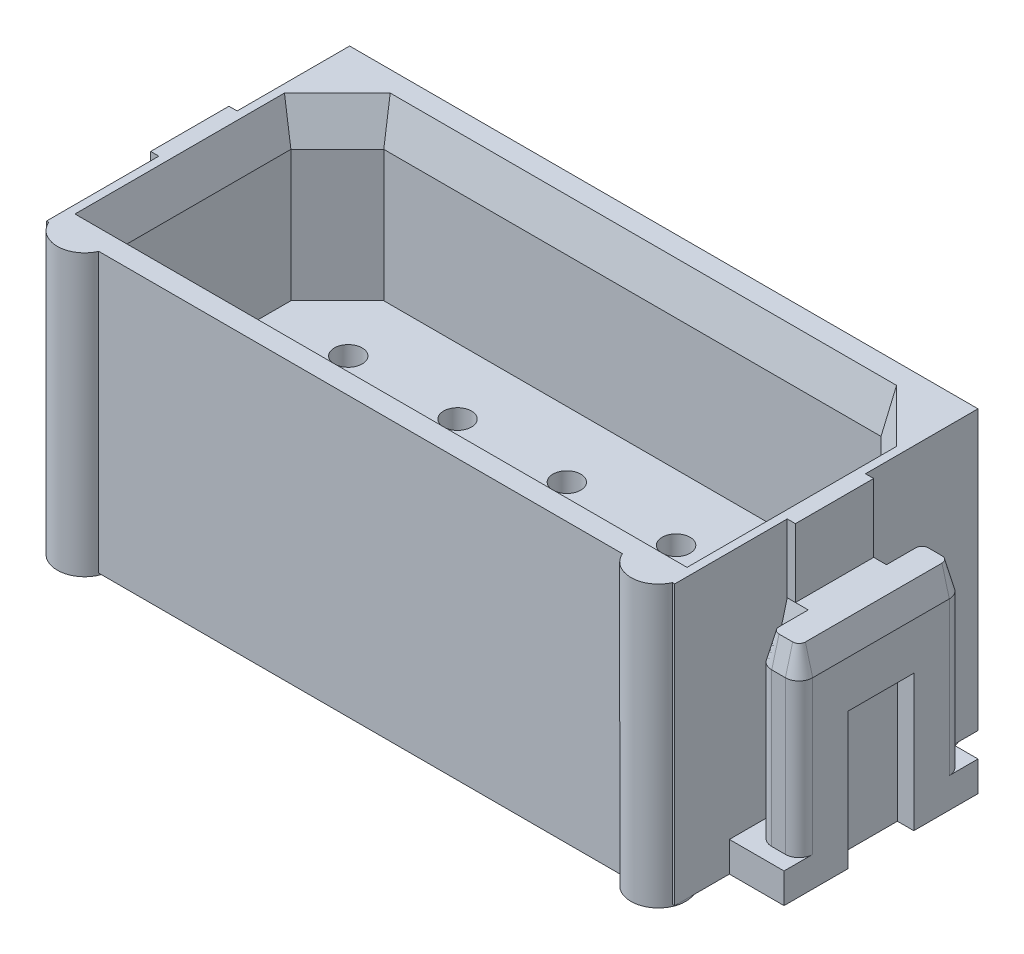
ISO-10303-21;
HEADER;
FILE_DESCRIPTION(('STEP AP214'),'2;1');
FILE_NAME('part.step','',(''),(''),'','','');
FILE_SCHEMA(('AUTOMOTIVE_DESIGN { 1 0 10303 214 1 1 1 1 }'));
ENDSEC;
DATA;
#1=APPLICATION_CONTEXT('core data for automotive mechanical design processes');
#2=APPLICATION_PROTOCOL_DEFINITION('international standard','automotive_design',2000,#1);
#3=PRODUCT_CONTEXT('',#1,'mechanical');
#4=PRODUCT('Part','Part','',(#3));
#5=PRODUCT_RELATED_PRODUCT_CATEGORY('part','',(#4));
#6=PRODUCT_DEFINITION_FORMATION('','',#4);
#7=PRODUCT_DEFINITION_CONTEXT('part definition',#1,'design');
#8=PRODUCT_DEFINITION('design','',#6,#7);
#9=PRODUCT_DEFINITION_SHAPE('','',#8);
#10=(LENGTH_UNIT() NAMED_UNIT(*) SI_UNIT(.MILLI.,.METRE.));
#11=(NAMED_UNIT(*) PLANE_ANGLE_UNIT() SI_UNIT($,.RADIAN.));
#12=(NAMED_UNIT(*) SI_UNIT($,.STERADIAN.) SOLID_ANGLE_UNIT());
#13=UNCERTAINTY_MEASURE_WITH_UNIT(LENGTH_MEASURE(1.E-05),#10,'distance_accuracy_value','');
#14=(GEOMETRIC_REPRESENTATION_CONTEXT(3) GLOBAL_UNCERTAINTY_ASSIGNED_CONTEXT((#13)) GLOBAL_UNIT_ASSIGNED_CONTEXT((#10,
#11,#12)) REPRESENTATION_CONTEXT('',''));
#15=CARTESIAN_POINT('',(0.,0.,0.));
#16=DIRECTION('',(0.,0.,1.));
#17=DIRECTION('',(1.,0.,0.));
#18=AXIS2_PLACEMENT_3D('',#15,#16,#17);
#19=CARTESIAN_POINT('',(-5.881192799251,3.85,1.420666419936));
#20=DIRECTION('',(0.,-1.,0.));
#21=DIRECTION('',(-1.,0.,0.));
#22=AXIS2_PLACEMENT_3D('',#19,#20,#21);
#23=PLANE('',#22);
#24=DIRECTION('',(0.,0.,1.));
#25=VECTOR('',#24,1.);
#26=CARTESIAN_POINT('',(-6.133974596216,3.85,0.));
#27=LINE('',#26,#25);
#28=CARTESIAN_POINT('',(-6.13397459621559,3.8499999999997,-1.25000000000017));
#29=VERTEX_POINT('',#28);
#30=CARTESIAN_POINT('',(-6.13397459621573,3.85,-0.716025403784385));
#31=VERTEX_POINT('',#30);
#32=EDGE_CURVE('E546',#29,#31,#27,.T.);
#33=ORIENTED_EDGE('',*,*,#32,.F.);
#34=CARTESIAN_POINT('',(-6.25,3.8499999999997,-1.25));
#35=DIRECTION('',(0.,-1.,0.));
#36=DIRECTION('',(0.,0.,-1.));
#37=AXIS2_PLACEMENT_3D('',#34,#35,#36);
#38=CIRCLE('',#37,0.116025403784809);
#39=CARTESIAN_POINT('',(-6.25,3.8499999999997,-1.36602540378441));
#40=VERTEX_POINT('',#39);
#41=EDGE_CURVE('E849',#40,#29,#38,.T.);
#42=ORIENTED_EDGE('',*,*,#41,.F.);
#43=DIRECTION('',(1.,0.,0.));
#44=VECTOR('',#43,1.);
#45=CARTESIAN_POINT('',(-6.258012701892,3.85,-1.366025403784));
#46=LINE('',#45,#44);
#47=CARTESIAN_POINT('',(-6.50000000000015,3.8499999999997,-1.36602540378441));
#48=VERTEX_POINT('',#47);
#49=EDGE_CURVE('E528',#48,#40,#46,.T.);
#50=ORIENTED_EDGE('',*,*,#49,.F.);
#51=CARTESIAN_POINT('',(-6.5,3.8499999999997,-1.25));
#52=DIRECTION('',(0.,-1.,0.));
#53=DIRECTION('',(0.,0.,-1.));
#54=AXIS2_PLACEMENT_3D('',#51,#52,#53);
#55=CIRCLE('',#54,0.11602540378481);
#56=CARTESIAN_POINT('',(-6.61602540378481,3.8499999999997,-1.25));
#57=VERTEX_POINT('',#56);
#58=EDGE_CURVE('E525',#57,#48,#55,.T.);
#59=ORIENTED_EDGE('',*,*,#58,.F.);
#60=DIRECTION('',(0.,0.,1.));
#61=VECTOR('',#60,1.);
#62=CARTESIAN_POINT('',(-6.61602540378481,3.8499999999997,0.));
#63=LINE('',#62,#61);
#64=CARTESIAN_POINT('',(-6.61602540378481,3.8499999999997,1.25));
#65=VERTEX_POINT('',#64);
#66=EDGE_CURVE('E535',#57,#65,#63,.T.);
#67=ORIENTED_EDGE('',*,*,#66,.T.);
#68=CARTESIAN_POINT('',(-6.5,3.8499999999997,1.25));
#69=DIRECTION('',(0.,-1.,0.));
#70=DIRECTION('',(0.,0.,-1.));
#71=AXIS2_PLACEMENT_3D('',#68,#69,#70);
#72=CIRCLE('',#71,0.11602540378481);
#73=CARTESIAN_POINT('',(-6.50000000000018,3.8499999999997,1.36602540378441));
#74=VERTEX_POINT('',#73);
#75=EDGE_CURVE('E523',#74,#65,#72,.T.);
#76=ORIENTED_EDGE('',*,*,#75,.F.);
#77=DIRECTION('',(-1.,0.,0.));
#78=VECTOR('',#77,1.);
#79=CARTESIAN_POINT('',(-6.258012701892,3.85,1.366025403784));
#80=LINE('',#79,#78);
#81=CARTESIAN_POINT('',(-6.25000000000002,3.8499999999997,1.3660254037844));
#82=VERTEX_POINT('',#81);
#83=EDGE_CURVE('E509',#82,#74,#80,.T.);
#84=ORIENTED_EDGE('',*,*,#83,.F.);
#85=CARTESIAN_POINT('',(-6.25,3.8499999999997,1.25));
#86=DIRECTION('',(0.,-1.,0.));
#87=DIRECTION('',(0.,0.,-1.));
#88=AXIS2_PLACEMENT_3D('',#85,#86,#87);
#89=CIRCLE('',#88,0.116025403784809);
#90=CARTESIAN_POINT('',(-6.13397459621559,3.8499999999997,1.25000000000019));
#91=VERTEX_POINT('',#90);
#92=EDGE_CURVE('E21',#91,#82,#89,.T.);
#93=ORIENTED_EDGE('',*,*,#92,.F.);
#94=DIRECTION('',(0.,0.,1.));
#95=VECTOR('',#94,1.);
#96=CARTESIAN_POINT('',(-6.133974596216,3.85,0.));
#97=LINE('',#96,#95);
#98=CARTESIAN_POINT('',(-6.13397459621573,3.85,0.716025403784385));
#99=VERTEX_POINT('',#98);
#100=EDGE_CURVE('E496',#99,#91,#97,.T.);
#101=ORIENTED_EDGE('',*,*,#100,.F.);
#102=DIRECTION('',(-1.,0.,0.));
#103=VECTOR('',#102,1.);
#104=CARTESIAN_POINT('',(-6.258012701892,3.85,0.7160254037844));
#105=LINE('',#104,#103);
#106=CARTESIAN_POINT('',(-5.9,3.85,0.716025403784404));
#107=VERTEX_POINT('',#106);
#108=EDGE_CURVE('E531',#107,#99,#105,.T.);
#109=ORIENTED_EDGE('',*,*,#108,.F.);
#110=DIRECTION('',(0.,0.,1.));
#111=VECTOR('',#110,1.);
#112=CARTESIAN_POINT('',(-5.9,3.85,0.));
#113=LINE('',#112,#111);
#114=CARTESIAN_POINT('',(-5.90000000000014,3.85,-0.7160254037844));
#115=VERTEX_POINT('',#114);
#116=EDGE_CURVE('E539',#115,#107,#113,.T.);
#117=ORIENTED_EDGE('',*,*,#116,.F.);
#118=DIRECTION('',(1.,0.,0.));
#119=VECTOR('',#118,1.);
#120=CARTESIAN_POINT('',(-6.258012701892,3.85,-0.7160254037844));
#121=LINE('',#120,#119);
#122=EDGE_CURVE('E543',#31,#115,#121,.T.);
#123=ORIENTED_EDGE('',*,*,#122,.F.);
#124=EDGE_LOOP('',(#33,#42,#50,#59,#67,#76,#84,#93,#101,#109,#117,#123));
#125=FACE_BOUND('',#124,.T.);
#126=ADVANCED_FACE('F17',(#125),#23,.F.);
#127=CARTESIAN_POINT('',(-6.45,2.601,-0.624));
#128=DIRECTION('',(-1.,0.,0.));
#129=DIRECTION('',(0.,-1.,0.));
#130=AXIS2_PLACEMENT_3D('',#127,#128,#129);
#131=PLANE('',#130);
#132=DIRECTION('',(0.,0.,1.));
#133=VECTOR('',#132,1.);
#134=CARTESIAN_POINT('',(-6.44999999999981,2.54999999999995,0.));
#135=LINE('',#134,#133);
#136=CARTESIAN_POINT('',(-6.4499999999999,2.54999999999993,-0.6));
#137=VERTEX_POINT('',#136);
#138=CARTESIAN_POINT('',(-6.44999999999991,2.55,0.6));
#139=VERTEX_POINT('',#138);
#140=EDGE_CURVE('E878',#137,#139,#135,.T.);
#141=ORIENTED_EDGE('',*,*,#140,.F.);
#142=DIRECTION('',(0.,-1.,0.));
#143=VECTOR('',#142,1.);
#144=CARTESIAN_POINT('',(-6.45,1.275,-0.6));
#145=LINE('',#144,#143);
#146=CARTESIAN_POINT('',(-6.45,0.,-0.6));
#147=VERTEX_POINT('',#146);
#148=EDGE_CURVE('E532',#137,#147,#145,.T.);
#149=ORIENTED_EDGE('',*,*,#148,.T.);
#150=DIRECTION('',(0.,0.,1.));
#151=VECTOR('',#150,1.);
#152=CARTESIAN_POINT('',(-6.45,0.,0.));
#153=LINE('',#152,#151);
#154=CARTESIAN_POINT('',(-6.45,0.,0.6));
#155=VERTEX_POINT('',#154);
#156=EDGE_CURVE('E545',#147,#155,#153,.T.);
#157=ORIENTED_EDGE('',*,*,#156,.T.);
#158=DIRECTION('',(0.,-1.,0.));
#159=VECTOR('',#158,1.);
#160=CARTESIAN_POINT('',(-6.45,1.275,0.6));
#161=LINE('',#160,#159);
#162=EDGE_CURVE('E844',#139,#155,#161,.T.);
#163=ORIENTED_EDGE('',*,*,#162,.F.);
#164=EDGE_LOOP('',(#141,#149,#157,#163));
#165=FACE_BOUND('',#164,.T.);
#166=ADVANCED_FACE('F1675',(#165),#131,.T.);
#167=CARTESIAN_POINT('',(-6.76852147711,2.49383606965,-0.624));
#168=DIRECTION('',(0.173648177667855,-0.984807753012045,0.));
#169=DIRECTION('',(0.984807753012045,0.173648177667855,0.));
#170=AXIS2_PLACEMENT_3D('',#167,#168,#169);
#171=PLANE('',#170);
#172=ORIENTED_EDGE('',*,*,#140,.T.);
#173=DIRECTION('',(0.98480775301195,0.173648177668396,0.));
#174=VECTOR('',#173,1.);
#175=CARTESIAN_POINT('',(-6.75,2.497101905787,0.6));
#176=LINE('',#175,#174);
#177=CARTESIAN_POINT('',(-6.75,2.497101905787,0.6));
#178=VERTEX_POINT('',#177);
#179=EDGE_CURVE('E841',#178,#139,#176,.T.);
#180=ORIENTED_EDGE('',*,*,#179,.F.);
#181=DIRECTION('',(0.,0.,-1.));
#182=VECTOR('',#181,1.);
#183=CARTESIAN_POINT('',(-6.75,2.497101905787,0.));
#184=LINE('',#183,#182);
#185=CARTESIAN_POINT('',(-6.75,2.49710190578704,-0.6));
#186=VERTEX_POINT('',#185);
#187=EDGE_CURVE('E888',#178,#186,#184,.T.);
#188=ORIENTED_EDGE('',*,*,#187,.T.);
#189=DIRECTION('',(0.984807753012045,0.173648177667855,0.));
#190=VECTOR('',#189,1.);
#191=CARTESIAN_POINT('',(-6.76852147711,2.49383606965,-0.6));
#192=LINE('',#191,#190);
#193=EDGE_CURVE('E536',#186,#137,#192,.T.);
#194=ORIENTED_EDGE('',*,*,#193,.T.);
#195=EDGE_LOOP('',(#172,#180,#188,#194));
#196=FACE_BOUND('',#195,.T.);
#197=ADVANCED_FACE('F1971',(#196),#171,.T.);
#198=CARTESIAN_POINT('',(-6.431192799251,-0.051,-0.6));
#199=DIRECTION('',(0.,0.,-1.));
#200=DIRECTION('',(-1.,0.,0.));
#201=AXIS2_PLACEMENT_3D('',#198,#199,#200);
#202=PLANE('',#201);
#203=ORIENTED_EDGE('',*,*,#193,.F.);
#204=DIRECTION('',(0.,-1.,0.));
#205=VECTOR('',#204,1.);
#206=CARTESIAN_POINT('',(-6.75,1.675,-0.6));
#207=LINE('',#206,#205);
#208=CARTESIAN_POINT('',(-6.75,0.,-0.6));
#209=VERTEX_POINT('',#208);
#210=EDGE_CURVE('E890',#186,#209,#207,.T.);
#211=ORIENTED_EDGE('',*,*,#210,.T.);
#212=DIRECTION('',(-1.,0.,0.));
#213=VECTOR('',#212,1.);
#214=CARTESIAN_POINT('',(-6.6,0.,-0.6));
#215=LINE('',#214,#213);
#216=EDGE_CURVE('E848',#147,#209,#215,.T.);
#217=ORIENTED_EDGE('',*,*,#216,.F.);
#218=ORIENTED_EDGE('',*,*,#148,.F.);
#219=EDGE_LOOP('',(#203,#211,#217,#218));
#220=FACE_BOUND('',#219,.T.);
#221=ADVANCED_FACE('F1678',(#220),#202,.F.);
#222=CARTESIAN_POINT('',(-6.611157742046,3.868166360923,-1.3));
#223=DIRECTION('',(0.965925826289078,-0.258819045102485,0.));
#224=DIRECTION('',(0.,0.,1.));
#225=AXIS2_PLACEMENT_3D('',#222,#223,#224);
#226=PLANE('',#225);
#227=DIRECTION('',(0.,0.,1.));
#228=VECTOR('',#227,1.);
#229=CARTESIAN_POINT('',(-6.75,3.35,0.));
#230=LINE('',#229,#228);
#231=CARTESIAN_POINT('',(-6.75000000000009,3.35000000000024,-1.25));
#232=VERTEX_POINT('',#231);
#233=CARTESIAN_POINT('',(-6.75000000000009,3.35000000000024,1.24999999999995));
#234=VERTEX_POINT('',#233);
#235=EDGE_CURVE('E977',#232,#234,#230,.T.);
#236=ORIENTED_EDGE('',*,*,#235,.T.);
#237=DIRECTION('',(-0.258819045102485,-0.965925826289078,0.));
#238=VECTOR('',#237,1.);
#239=CARTESIAN_POINT('',(-6.6830127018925,3.6,1.25));
#240=LINE('',#239,#238);
#241=EDGE_CURVE('E877',#65,#234,#240,.T.);
#242=ORIENTED_EDGE('',*,*,#241,.F.);
#243=ORIENTED_EDGE('',*,*,#66,.F.);
#244=DIRECTION('',(0.258819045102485,0.965925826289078,0.));
#245=VECTOR('',#244,1.);
#246=CARTESIAN_POINT('',(-6.6830127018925,3.6,-1.25));
#247=LINE('',#246,#245);
#248=EDGE_CURVE('E845',#232,#57,#247,.T.);
#249=ORIENTED_EDGE('',*,*,#248,.F.);
#250=EDGE_LOOP('',(#236,#242,#243,#249));
#251=FACE_BOUND('',#250,.T.);
#252=ADVANCED_FACE('F1965',(#251),#226,.F.);
#253=CARTESIAN_POINT('',(-6.431192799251,-0.051,0.6));
#254=DIRECTION('',(0.,0.,-1.));
#255=DIRECTION('',(-1.,0.,0.));
#256=AXIS2_PLACEMENT_3D('',#253,#254,#255);
#257=PLANE('',#256);
#258=ORIENTED_EDGE('',*,*,#162,.T.);
#259=DIRECTION('',(-1.,0.,0.));
#260=VECTOR('',#259,1.);
#261=CARTESIAN_POINT('',(-6.6,0.,0.6));
#262=LINE('',#261,#260);
#263=CARTESIAN_POINT('',(-6.75,0.,0.6));
#264=VERTEX_POINT('',#263);
#265=EDGE_CURVE('E887',#155,#264,#262,.T.);
#266=ORIENTED_EDGE('',*,*,#265,.T.);
#267=DIRECTION('',(0.,1.,0.));
#268=VECTOR('',#267,1.);
#269=CARTESIAN_POINT('',(-6.75,1.675,0.6));
#270=LINE('',#269,#268);
#271=EDGE_CURVE('E915',#264,#178,#270,.T.);
#272=ORIENTED_EDGE('',*,*,#271,.T.);
#273=ORIENTED_EDGE('',*,*,#179,.T.);
#274=EDGE_LOOP('',(#258,#266,#272,#273));
#275=FACE_BOUND('',#274,.T.);
#276=ADVANCED_FACE('F1670',(#275),#257,.T.);
#277=CARTESIAN_POINT('',(-6.75,3.417,-1.846));
#278=DIRECTION('',(1.,0.,0.));
#279=DIRECTION('',(0.,0.,1.));
#280=AXIS2_PLACEMENT_3D('',#277,#278,#279);
#281=PLANE('',#280);
#282=DIRECTION('',(0.,0.,-1.));
#283=VECTOR('',#282,1.);
#284=CARTESIAN_POINT('',(-6.75,0.,0.));
#285=LINE('',#284,#283);
#286=CARTESIAN_POINT('',(-6.75,0.,1.775));
#287=VERTEX_POINT('',#286);
#288=EDGE_CURVE('E919',#287,#264,#285,.T.);
#289=ORIENTED_EDGE('',*,*,#288,.F.);
#290=DIRECTION('',(0.,-1.,0.));
#291=VECTOR('',#290,1.);
#292=CARTESIAN_POINT('',(-6.75,1.675,1.775));
#293=LINE('',#292,#291);
#294=CARTESIAN_POINT('',(-6.75,0.549999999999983,1.775));
#295=VERTEX_POINT('',#294);
#296=EDGE_CURVE('E927',#295,#287,#293,.T.);
#297=ORIENTED_EDGE('',*,*,#296,.F.);
#298=DIRECTION('',(0.,0.,1.));
#299=VECTOR('',#298,1.);
#300=CARTESIAN_POINT('',(-6.75,0.55,0.));
#301=LINE('',#300,#299);
#302=CARTESIAN_POINT('',(-6.75,0.550000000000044,1.24999999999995));
#303=VERTEX_POINT('',#302);
#304=EDGE_CURVE('E931',#303,#295,#301,.T.);
#305=ORIENTED_EDGE('',*,*,#304,.F.);
#306=DIRECTION('',(0.,1.,0.));
#307=VECTOR('',#306,1.);
#308=CARTESIAN_POINT('',(-6.75,1.95,1.2499999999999));
#309=LINE('',#308,#307);
#310=EDGE_CURVE('E826',#303,#234,#309,.T.);
#311=ORIENTED_EDGE('',*,*,#310,.T.);
#312=ORIENTED_EDGE('',*,*,#235,.F.);
#313=DIRECTION('',(0.,-1.,0.));
#314=VECTOR('',#313,1.);
#315=CARTESIAN_POINT('',(-6.75,1.95,-1.25));
#316=LINE('',#315,#314);
#317=CARTESIAN_POINT('',(-6.75,0.550000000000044,-1.25));
#318=VERTEX_POINT('',#317);
#319=EDGE_CURVE('E822',#232,#318,#316,.T.);
#320=ORIENTED_EDGE('',*,*,#319,.T.);
#321=DIRECTION('',(0.,0.,1.));
#322=VECTOR('',#321,1.);
#323=CARTESIAN_POINT('',(-6.75,0.55,0.));
#324=LINE('',#323,#322);
#325=CARTESIAN_POINT('',(-6.75,0.55,-1.775));
#326=VERTEX_POINT('',#325);
#327=EDGE_CURVE('E906',#326,#318,#324,.T.);
#328=ORIENTED_EDGE('',*,*,#327,.F.);
#329=DIRECTION('',(0.,1.,0.));
#330=VECTOR('',#329,1.);
#331=CARTESIAN_POINT('',(-6.75,1.675,-1.775));
#332=LINE('',#331,#330);
#333=CARTESIAN_POINT('',(-6.75,0.,-1.775));
#334=VERTEX_POINT('',#333);
#335=EDGE_CURVE('E902',#334,#326,#332,.T.);
#336=ORIENTED_EDGE('',*,*,#335,.F.);
#337=DIRECTION('',(0.,0.,-1.));
#338=VECTOR('',#337,1.);
#339=CARTESIAN_POINT('',(-6.75,0.,0.));
#340=LINE('',#339,#338);
#341=EDGE_CURVE('E898',#209,#334,#340,.T.);
#342=ORIENTED_EDGE('',*,*,#341,.F.);
#343=ORIENTED_EDGE('',*,*,#210,.F.);
#344=ORIENTED_EDGE('',*,*,#187,.F.);
#345=ORIENTED_EDGE('',*,*,#271,.F.);
#346=EDGE_LOOP('',(#289,#297,#305,#311,#312,#320,#328,#336,#342,#343,#344,#345));
#347=FACE_BOUND('',#346,.T.);
#348=ADVANCED_FACE('F1665',(#347),#281,.F.);
#349=CARTESIAN_POINT('',(5.881192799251,3.85,1.420666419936));
#350=DIRECTION('',(0.,1.,0.));
#351=DIRECTION('',(1.,0.,0.));
#352=AXIS2_PLACEMENT_3D('',#349,#350,#351);
#353=PLANE('',#352);
#354=DIRECTION('',(0.,0.,1.));
#355=VECTOR('',#354,1.);
#356=CARTESIAN_POINT('',(6.133974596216,3.85,0.));
#357=LINE('',#356,#355);
#358=CARTESIAN_POINT('',(6.13397459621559,3.84999999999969,-1.25000000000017));
#359=VERTEX_POINT('',#358);
#360=CARTESIAN_POINT('',(6.13397459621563,3.85,-0.716025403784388));
#361=VERTEX_POINT('',#360);
#362=EDGE_CURVE('E831',#359,#361,#357,.T.);
#363=ORIENTED_EDGE('',*,*,#362,.T.);
#364=DIRECTION('',(-1.,0.,0.));
#365=VECTOR('',#364,1.);
#366=CARTESIAN_POINT('',(6.258012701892,3.85,-0.7160254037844));
#367=LINE('',#366,#365);
#368=CARTESIAN_POINT('',(5.9,3.85,-0.71602540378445));
#369=VERTEX_POINT('',#368);
#370=EDGE_CURVE('E969',#361,#369,#367,.T.);
#371=ORIENTED_EDGE('',*,*,#370,.T.);
#372=DIRECTION('',(0.,0.,1.));
#373=VECTOR('',#372,1.);
#374=CARTESIAN_POINT('',(5.9,3.85,0.));
#375=LINE('',#374,#373);
#376=CARTESIAN_POINT('',(5.9,3.85,0.716025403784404));
#377=VERTEX_POINT('',#376);
#378=EDGE_CURVE('E918',#369,#377,#375,.T.);
#379=ORIENTED_EDGE('',*,*,#378,.T.);
#380=DIRECTION('',(1.,0.,0.));
#381=VECTOR('',#380,1.);
#382=CARTESIAN_POINT('',(6.258012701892,3.85,0.7160254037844));
#383=LINE('',#382,#381);
#384=CARTESIAN_POINT('',(6.13397459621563,3.85,0.716025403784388));
#385=VERTEX_POINT('',#384);
#386=EDGE_CURVE('E944',#377,#385,#383,.T.);
#387=ORIENTED_EDGE('',*,*,#386,.T.);
#388=DIRECTION('',(0.,0.,1.));
#389=VECTOR('',#388,1.);
#390=CARTESIAN_POINT('',(6.133974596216,3.85,0.));
#391=LINE('',#390,#389);
#392=CARTESIAN_POINT('',(6.13397459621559,3.84999999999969,1.25000000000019));
#393=VERTEX_POINT('',#392);
#394=EDGE_CURVE('E840',#385,#393,#391,.T.);
#395=ORIENTED_EDGE('',*,*,#394,.T.);
#396=CARTESIAN_POINT('',(6.25,3.84999999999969,1.25));
#397=DIRECTION('',(0.,-1.,0.));
#398=DIRECTION('',(0.,0.,-1.));
#399=AXIS2_PLACEMENT_3D('',#396,#397,#398);
#400=CIRCLE('',#399,0.116025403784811);
#401=CARTESIAN_POINT('',(6.25000000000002,3.84999999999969,1.36602540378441));
#402=VERTEX_POINT('',#401);
#403=EDGE_CURVE('E837',#393,#402,#400,.F.);
#404=ORIENTED_EDGE('',*,*,#403,.T.);
#405=DIRECTION('',(1.,0.,0.));
#406=VECTOR('',#405,1.);
#407=CARTESIAN_POINT('',(6.258012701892,3.85,1.366025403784));
#408=LINE('',#407,#406);
#409=CARTESIAN_POINT('',(6.50000000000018,3.84999999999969,1.36602540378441));
#410=VERTEX_POINT('',#409);
#411=EDGE_CURVE('E836',#402,#410,#408,.T.);
#412=ORIENTED_EDGE('',*,*,#411,.T.);
#413=CARTESIAN_POINT('',(6.5,3.84999999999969,1.25));
#414=DIRECTION('',(0.,-1.,0.));
#415=DIRECTION('',(0.,0.,-1.));
#416=AXIS2_PLACEMENT_3D('',#413,#414,#415);
#417=CIRCLE('',#416,0.116025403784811);
#418=CARTESIAN_POINT('',(6.61602540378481,3.8499999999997,1.25));
#419=VERTEX_POINT('',#418);
#420=EDGE_CURVE('E817',#410,#419,#417,.F.);
#421=ORIENTED_EDGE('',*,*,#420,.T.);
#422=DIRECTION('',(0.,0.,-1.));
#423=VECTOR('',#422,1.);
#424=CARTESIAN_POINT('',(6.61602540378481,3.8499999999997,0.));
#425=LINE('',#424,#423);
#426=CARTESIAN_POINT('',(6.61602540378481,3.8499999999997,-1.25));
#427=VERTEX_POINT('',#426);
#428=EDGE_CURVE('E1005',#419,#427,#425,.T.);
#429=ORIENTED_EDGE('',*,*,#428,.T.);
#430=CARTESIAN_POINT('',(6.5,3.84999999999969,-1.25));
#431=DIRECTION('',(0.,-1.,0.));
#432=DIRECTION('',(0.,0.,-1.));
#433=AXIS2_PLACEMENT_3D('',#430,#431,#432);
#434=CIRCLE('',#433,0.116025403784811);
#435=CARTESIAN_POINT('',(6.50000000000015,3.84999999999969,-1.36602540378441));
#436=VERTEX_POINT('',#435);
#437=EDGE_CURVE('E833',#427,#436,#434,.F.);
#438=ORIENTED_EDGE('',*,*,#437,.T.);
#439=DIRECTION('',(-1.,0.,0.));
#440=VECTOR('',#439,1.);
#441=CARTESIAN_POINT('',(6.258012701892,3.85,-1.366025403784));
#442=LINE('',#441,#440);
#443=CARTESIAN_POINT('',(6.25,3.84999999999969,-1.36602540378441));
#444=VERTEX_POINT('',#443);
#445=EDGE_CURVE('E832',#436,#444,#442,.T.);
#446=ORIENTED_EDGE('',*,*,#445,.T.);
#447=CARTESIAN_POINT('',(6.25,3.84999999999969,-1.25));
#448=DIRECTION('',(0.,-1.,0.));
#449=DIRECTION('',(0.,0.,-1.));
#450=AXIS2_PLACEMENT_3D('',#447,#448,#449);
#451=CIRCLE('',#450,0.116025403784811);
#452=EDGE_CURVE('E828',#444,#359,#451,.F.);
#453=ORIENTED_EDGE('',*,*,#452,.T.);
#454=EDGE_LOOP('',(#363,#371,#379,#387,#395,#404,#412,#421,#429,#438,#446,#453));
#455=FACE_BOUND('',#454,.T.);
#456=ADVANCED_FACE('F1956',(#455),#353,.T.);
#457=CARTESIAN_POINT('',(6.45,2.601,-0.624));
#458=DIRECTION('',(-1.,0.,0.));
#459=DIRECTION('',(0.,-1.,0.));
#460=AXIS2_PLACEMENT_3D('',#457,#458,#459);
#461=PLANE('',#460);
#462=DIRECTION('',(0.,0.,1.));
#463=VECTOR('',#462,1.);
#464=CARTESIAN_POINT('',(6.44999999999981,2.54999999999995,0.));
#465=LINE('',#464,#463);
#466=CARTESIAN_POINT('',(6.44999999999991,2.55,-0.6));
#467=VERTEX_POINT('',#466);
#468=CARTESIAN_POINT('',(6.4499999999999,2.54999999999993,0.6));
#469=VERTEX_POINT('',#468);
#470=EDGE_CURVE('E816',#467,#469,#465,.T.);
#471=ORIENTED_EDGE('',*,*,#470,.T.);
#472=DIRECTION('',(0.,-1.,0.));
#473=VECTOR('',#472,1.);
#474=CARTESIAN_POINT('',(6.45,1.275,0.6));
#475=LINE('',#474,#473);
#476=CARTESIAN_POINT('',(6.45,0.,0.6));
#477=VERTEX_POINT('',#476);
#478=EDGE_CURVE('E806',#469,#477,#475,.T.);
#479=ORIENTED_EDGE('',*,*,#478,.T.);
#480=DIRECTION('',(0.,0.,1.));
#481=VECTOR('',#480,1.);
#482=CARTESIAN_POINT('',(6.45,0.,0.));
#483=LINE('',#482,#481);
#484=CARTESIAN_POINT('',(6.45,0.,-0.6));
#485=VERTEX_POINT('',#484);
#486=EDGE_CURVE('E827',#485,#477,#483,.T.);
#487=ORIENTED_EDGE('',*,*,#486,.F.);
#488=DIRECTION('',(0.,-1.,0.));
#489=VECTOR('',#488,1.);
#490=CARTESIAN_POINT('',(6.45,1.275,-0.6));
#491=LINE('',#490,#489);
#492=EDGE_CURVE('E815',#467,#485,#491,.T.);
#493=ORIENTED_EDGE('',*,*,#492,.F.);
#494=EDGE_LOOP('',(#471,#479,#487,#493));
#495=FACE_BOUND('',#494,.T.);
#496=ADVANCED_FACE('F1952',(#495),#461,.F.);
#497=CARTESIAN_POINT('',(-6.5,3.35,1.25));
#498=DIRECTION('',(0.,-1.,0.));
#499=DIRECTION('',(0.,0.,-1.));
#500=AXIS2_PLACEMENT_3D('',#497,#498,#499);
#501=CYLINDRICAL_SURFACE('',#500,0.249999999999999);
#502=CARTESIAN_POINT('',(-6.5,3.35000000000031,1.25));
#503=DIRECTION('',(0.,-1.,0.));
#504=DIRECTION('',(-1.,0.,0.));
#505=AXIS2_PLACEMENT_3D('',#502,#503,#504);
#506=CIRCLE('',#505,0.250000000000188);
#507=CARTESIAN_POINT('',(-6.50000000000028,3.35000000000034,1.50000000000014));
#508=VERTEX_POINT('',#507);
#509=EDGE_CURVE('E823',#508,#234,#506,.T.);
#510=ORIENTED_EDGE('',*,*,#509,.T.);
#511=ORIENTED_EDGE('',*,*,#310,.F.);
#512=CARTESIAN_POINT('',(-6.5,0.550000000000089,1.25));
#513=DIRECTION('',(0.,-1.,0.));
#514=DIRECTION('',(0.,0.,-1.));
#515=AXIS2_PLACEMENT_3D('',#512,#513,#514);
#516=CIRCLE('',#515,0.249999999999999);
#517=CARTESIAN_POINT('',(-6.50000000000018,0.550000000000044,1.5));
#518=VERTEX_POINT('',#517);
#519=EDGE_CURVE('E824',#518,#303,#516,.T.);
#520=ORIENTED_EDGE('',*,*,#519,.F.);
#521=DIRECTION('',(0.,1.,0.));
#522=VECTOR('',#521,1.);
#523=CARTESIAN_POINT('',(-6.50000000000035,1.95,1.5));
#524=LINE('',#523,#522);
#525=EDGE_CURVE('E1026',#518,#508,#524,.T.);
#526=ORIENTED_EDGE('',*,*,#525,.T.);
#527=EDGE_LOOP('',(#510,#511,#520,#526));
#528=FACE_BOUND('',#527,.T.);
#529=ADVANCED_FACE('F1955',(#528),#501,.T.);
#530=CARTESIAN_POINT('',(-6.5,3.8499999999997,1.25));
#531=DIRECTION('',(0.,-1.,0.));
#532=DIRECTION('',(0.,0.,-1.));
#533=AXIS2_PLACEMENT_3D('',#530,#531,#532);
#534=CONICAL_SURFACE('',#533,0.11602540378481,0.261799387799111);
#535=ORIENTED_EDGE('',*,*,#509,.F.);
#536=DIRECTION('',(0.,-0.965925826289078,0.258819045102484));
#537=VECTOR('',#536,1.);
#538=CARTESIAN_POINT('',(-6.50000000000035,3.6,1.4330127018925));
#539=LINE('',#538,#537);
#540=EDGE_CURVE('E1024',#74,#508,#539,.T.);
#541=ORIENTED_EDGE('',*,*,#540,.F.);
#542=ORIENTED_EDGE('',*,*,#75,.T.);
#543=ORIENTED_EDGE('',*,*,#241,.T.);
#544=EDGE_LOOP('',(#535,#541,#542,#543));
#545=FACE_BOUND('',#544,.T.);
#546=ADVANCED_FACE('F1981',(#545),#534,.T.);
#547=CARTESIAN_POINT('',(-6.5,3.35,-1.25));
#548=DIRECTION('',(0.,-1.,0.));
#549=DIRECTION('',(0.,0.,-1.));
#550=AXIS2_PLACEMENT_3D('',#547,#548,#549);
#551=CYLINDRICAL_SURFACE('',#550,0.249999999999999);
#552=CARTESIAN_POINT('',(-6.5,3.35000000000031,-1.25));
#553=DIRECTION('',(0.,-1.,0.));
#554=DIRECTION('',(-1.,0.,0.));
#555=AXIS2_PLACEMENT_3D('',#552,#553,#554);
#556=CIRCLE('',#555,0.250000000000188);
#557=CARTESIAN_POINT('',(-6.5000000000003,3.35000000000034,-1.50000000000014));
#558=VERTEX_POINT('',#557);
#559=EDGE_CURVE('E819',#232,#558,#556,.T.);
#560=ORIENTED_EDGE('',*,*,#559,.T.);
#561=DIRECTION('',(0.,-1.,0.));
#562=VECTOR('',#561,1.);
#563=CARTESIAN_POINT('',(-6.5000000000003,1.95,-1.5));
#564=LINE('',#563,#562);
#565=CARTESIAN_POINT('',(-6.50000000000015,0.550000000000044,-1.5));
#566=VERTEX_POINT('',#565);
#567=EDGE_CURVE('E1040',#558,#566,#564,.T.);
#568=ORIENTED_EDGE('',*,*,#567,.T.);
#569=CARTESIAN_POINT('',(-6.5,0.550000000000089,-1.25));
#570=DIRECTION('',(0.,-1.,0.));
#571=DIRECTION('',(0.,0.,-1.));
#572=AXIS2_PLACEMENT_3D('',#569,#570,#571);
#573=CIRCLE('',#572,0.249999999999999);
#574=EDGE_CURVE('E820',#318,#566,#573,.T.);
#575=ORIENTED_EDGE('',*,*,#574,.F.);
#576=ORIENTED_EDGE('',*,*,#319,.F.);
#577=EDGE_LOOP('',(#560,#568,#575,#576));
#578=FACE_BOUND('',#577,.T.);
#579=ADVANCED_FACE('F1985',(#578),#551,.T.);
#580=CARTESIAN_POINT('',(-6.5,3.8499999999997,-1.25));
#581=DIRECTION('',(0.,-1.,0.));
#582=DIRECTION('',(0.,0.,-1.));
#583=AXIS2_PLACEMENT_3D('',#580,#581,#582);
#584=CONICAL_SURFACE('',#583,0.11602540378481,0.261799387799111);
#585=ORIENTED_EDGE('',*,*,#559,.F.);
#586=ORIENTED_EDGE('',*,*,#248,.T.);
#587=ORIENTED_EDGE('',*,*,#58,.T.);
#588=DIRECTION('',(0.,0.965925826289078,0.258819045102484));
#589=VECTOR('',#588,1.);
#590=CARTESIAN_POINT('',(-6.5000000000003,3.6,-1.4330127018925));
#591=LINE('',#590,#589);
#592=EDGE_CURVE('E863',#558,#48,#591,.T.);
#593=ORIENTED_EDGE('',*,*,#592,.F.);
#594=EDGE_LOOP('',(#585,#586,#587,#593));
#595=FACE_BOUND('',#594,.T.);
#596=ADVANCED_FACE('F1989',(#595),#584,.T.);
#597=CARTESIAN_POINT('',(6.5,3.3500000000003,1.25));
#598=DIRECTION('',(0.,-1.,0.));
#599=DIRECTION('',(0.,0.,-1.));
#600=AXIS2_PLACEMENT_3D('',#597,#598,#599);
#601=CONICAL_SURFACE('',#600,0.250000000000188,0.261799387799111);
#602=CARTESIAN_POINT('',(6.5,3.34999999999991,1.25));
#603=DIRECTION('',(0.,1.,0.));
#604=DIRECTION('',(1.,0.,0.));
#605=AXIS2_PLACEMENT_3D('',#602,#603,#604);
#606=CIRCLE('',#605,0.249999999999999);
#607=CARTESIAN_POINT('',(6.50000000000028,3.35000000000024,1.50000000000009));
#608=VERTEX_POINT('',#607);
#609=CARTESIAN_POINT('',(6.75000000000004,3.35000000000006,1.25));
#610=VERTEX_POINT('',#609);
#611=EDGE_CURVE('E810',#608,#610,#606,.T.);
#612=ORIENTED_EDGE('',*,*,#611,.T.);
#613=DIRECTION('',(-0.258819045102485,0.965925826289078,0.));
#614=VECTOR('',#613,1.);
#615=CARTESIAN_POINT('',(6.6830127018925,3.6,1.25));
#616=LINE('',#615,#614);
#617=EDGE_CURVE('E811',#610,#419,#616,.T.);
#618=ORIENTED_EDGE('',*,*,#617,.T.);
#619=ORIENTED_EDGE('',*,*,#420,.F.);
#620=DIRECTION('',(0.,-0.965925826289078,0.258819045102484));
#621=VECTOR('',#620,1.);
#622=CARTESIAN_POINT('',(6.50000000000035,3.6,1.4330127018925));
#623=LINE('',#622,#621);
#624=EDGE_CURVE('E1046',#410,#608,#623,.T.);
#625=ORIENTED_EDGE('',*,*,#624,.T.);
#626=EDGE_LOOP('',(#612,#618,#619,#625));
#627=FACE_BOUND('',#626,.T.);
#628=ADVANCED_FACE('F1950',(#627),#601,.T.);
#629=CARTESIAN_POINT('',(6.76852147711,2.49383606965,-0.624));
#630=DIRECTION('',(0.173648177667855,0.984807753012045,0.));
#631=DIRECTION('',(-0.984807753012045,0.173648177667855,0.));
#632=AXIS2_PLACEMENT_3D('',#629,#630,#631);
#633=PLANE('',#632);
#634=ORIENTED_EDGE('',*,*,#470,.F.);
#635=DIRECTION('',(-0.98480775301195,0.173648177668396,0.));
#636=VECTOR('',#635,1.);
#637=CARTESIAN_POINT('',(6.75,2.497101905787,-0.6));
#638=LINE('',#637,#636);
#639=CARTESIAN_POINT('',(6.75,2.497101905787,-0.6));
#640=VERTEX_POINT('',#639);
#641=EDGE_CURVE('E812',#640,#467,#638,.T.);
#642=ORIENTED_EDGE('',*,*,#641,.F.);
#643=DIRECTION('',(0.,0.,-1.));
#644=VECTOR('',#643,1.);
#645=CARTESIAN_POINT('',(6.75,2.497101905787,0.));
#646=LINE('',#645,#644);
#647=CARTESIAN_POINT('',(6.75,2.49710190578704,0.6));
#648=VERTEX_POINT('',#647);
#649=EDGE_CURVE('E1055',#648,#640,#646,.T.);
#650=ORIENTED_EDGE('',*,*,#649,.F.);
#651=DIRECTION('',(-0.984807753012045,0.173648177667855,0.));
#652=VECTOR('',#651,1.);
#653=CARTESIAN_POINT('',(6.76852147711,2.49383606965,0.6));
#654=LINE('',#653,#652);
#655=EDGE_CURVE('E803',#648,#469,#654,.T.);
#656=ORIENTED_EDGE('',*,*,#655,.T.);
#657=EDGE_LOOP('',(#634,#642,#650,#656));
#658=FACE_BOUND('',#657,.T.);
#659=ADVANCED_FACE('F1946',(#658),#633,.F.);
#660=CARTESIAN_POINT('',(6.431192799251,-0.051,-0.6));
#661=DIRECTION('',(0.,0.,1.));
#662=DIRECTION('',(1.,0.,0.));
#663=AXIS2_PLACEMENT_3D('',#660,#661,#662);
#664=PLANE('',#663);
#665=ORIENTED_EDGE('',*,*,#492,.T.);
#666=DIRECTION('',(1.,0.,0.));
#667=VECTOR('',#666,1.);
#668=CARTESIAN_POINT('',(6.6,0.,-0.6));
#669=LINE('',#668,#667);
#670=CARTESIAN_POINT('',(6.75,0.,-0.6));
#671=VERTEX_POINT('',#670);
#672=EDGE_CURVE('E997',#485,#671,#669,.T.);
#673=ORIENTED_EDGE('',*,*,#672,.T.);
#674=DIRECTION('',(0.,-1.,0.));
#675=VECTOR('',#674,1.);
#676=CARTESIAN_POINT('',(6.75,1.675,-0.6));
#677=LINE('',#676,#675);
#678=EDGE_CURVE('E1058',#640,#671,#677,.T.);
#679=ORIENTED_EDGE('',*,*,#678,.F.);
#680=ORIENTED_EDGE('',*,*,#641,.T.);
#681=EDGE_LOOP('',(#665,#673,#679,#680));
#682=FACE_BOUND('',#681,.T.);
#683=ADVANCED_FACE('F1942',(#682),#664,.T.);
#684=CARTESIAN_POINT('',(6.611157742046,3.868166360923,1.3));
#685=DIRECTION('',(-0.965925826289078,-0.258819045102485,0.));
#686=DIRECTION('',(0.,0.,-1.));
#687=AXIS2_PLACEMENT_3D('',#684,#685,#686);
#688=PLANE('',#687);
#689=DIRECTION('',(0.,0.,1.));
#690=VECTOR('',#689,1.);
#691=CARTESIAN_POINT('',(6.75,3.35,0.));
#692=LINE('',#691,#690);
#693=CARTESIAN_POINT('',(6.75000000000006,3.35000000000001,-1.25));
#694=VERTEX_POINT('',#693);
#695=EDGE_CURVE('E1098',#694,#610,#692,.T.);
#696=ORIENTED_EDGE('',*,*,#695,.F.);
#697=DIRECTION('',(0.258819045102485,-0.965925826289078,0.));
#698=VECTOR('',#697,1.);
#699=CARTESIAN_POINT('',(6.6830127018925,3.6,-1.25));
#700=LINE('',#699,#698);
#701=EDGE_CURVE('E1008',#427,#694,#700,.T.);
#702=ORIENTED_EDGE('',*,*,#701,.F.);
#703=ORIENTED_EDGE('',*,*,#428,.F.);
#704=ORIENTED_EDGE('',*,*,#617,.F.);
#705=EDGE_LOOP('',(#696,#702,#703,#704));
#706=FACE_BOUND('',#705,.T.);
#707=ADVANCED_FACE('F1939',(#706),#688,.F.);
#708=CARTESIAN_POINT('',(6.5,0.550000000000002,1.25));
#709=DIRECTION('',(0.,1.,0.));
#710=DIRECTION('',(0.,0.,1.));
#711=AXIS2_PLACEMENT_3D('',#708,#709,#710);
#712=CYLINDRICAL_SURFACE('',#711,0.249999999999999);
#713=ORIENTED_EDGE('',*,*,#611,.F.);
#714=DIRECTION('',(0.,1.,0.));
#715=VECTOR('',#714,1.);
#716=CARTESIAN_POINT('',(6.50000000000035,1.95,1.5));
#717=LINE('',#716,#715);
#718=CARTESIAN_POINT('',(6.50000000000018,0.550000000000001,1.5));
#719=VERTEX_POINT('',#718);
#720=EDGE_CURVE('E1050',#719,#608,#717,.T.);
#721=ORIENTED_EDGE('',*,*,#720,.F.);
#722=CARTESIAN_POINT('',(6.5,0.550000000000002,1.25));
#723=DIRECTION('',(0.,1.,0.));
#724=DIRECTION('',(0.,0.,1.));
#725=AXIS2_PLACEMENT_3D('',#722,#723,#724);
#726=CIRCLE('',#725,0.249999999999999);
#727=CARTESIAN_POINT('',(6.75,0.550000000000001,1.25));
#728=VERTEX_POINT('',#727);
#729=EDGE_CURVE('E808',#728,#719,#726,.F.);
#730=ORIENTED_EDGE('',*,*,#729,.F.);
#731=DIRECTION('',(0.,-1.,0.));
#732=VECTOR('',#731,1.);
#733=CARTESIAN_POINT('',(6.75,1.675,1.25));
#734=LINE('',#733,#732);
#735=EDGE_CURVE('E1101',#610,#728,#734,.T.);
#736=ORIENTED_EDGE('',*,*,#735,.F.);
#737=EDGE_LOOP('',(#713,#721,#730,#736));
#738=FACE_BOUND('',#737,.T.);
#739=ADVANCED_FACE('F1604',(#738),#712,.T.);
#740=CARTESIAN_POINT('',(6.431192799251,-0.051,0.6));
#741=DIRECTION('',(0.,0.,1.));
#742=DIRECTION('',(1.,0.,0.));
#743=AXIS2_PLACEMENT_3D('',#740,#741,#742);
#744=PLANE('',#743);
#745=ORIENTED_EDGE('',*,*,#655,.F.);
#746=DIRECTION('',(0.,1.,0.));
#747=VECTOR('',#746,1.);
#748=CARTESIAN_POINT('',(6.75,1.675,0.6));
#749=LINE('',#748,#747);
#750=CARTESIAN_POINT('',(6.75,0.,0.6));
#751=VERTEX_POINT('',#750);
#752=EDGE_CURVE('E802',#751,#648,#749,.T.);
#753=ORIENTED_EDGE('',*,*,#752,.F.);
#754=DIRECTION('',(1.,0.,0.));
#755=VECTOR('',#754,1.);
#756=CARTESIAN_POINT('',(6.6,0.,0.6));
#757=LINE('',#756,#755);
#758=EDGE_CURVE('E807',#477,#751,#757,.T.);
#759=ORIENTED_EDGE('',*,*,#758,.F.);
#760=ORIENTED_EDGE('',*,*,#478,.F.);
#761=EDGE_LOOP('',(#745,#753,#759,#760));
#762=FACE_BOUND('',#761,.T.);
#763=ADVANCED_FACE('F1934',(#762),#744,.F.);
#764=CARTESIAN_POINT('',(-6.231192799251,0.494,1.5));
#765=DIRECTION('',(0.,0.,-1.));
#766=DIRECTION('',(-1.,0.,0.));
#767=AXIS2_PLACEMENT_3D('',#764,#765,#766);
#768=PLANE('',#767);
#769=DIRECTION('',(1.,0.,0.));
#770=VECTOR('',#769,1.);
#771=CARTESIAN_POINT('',(-6.375,3.35000000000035,1.50000000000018));
#772=LINE('',#771,#770);
#773=CARTESIAN_POINT('',(-6.25000000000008,3.35000000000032,1.50000000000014));
#774=VERTEX_POINT('',#773);
#775=EDGE_CURVE('E516',#508,#774,#772,.T.);
#776=ORIENTED_EDGE('',*,*,#775,.F.);
#777=ORIENTED_EDGE('',*,*,#525,.F.);
#778=DIRECTION('',(-1.,0.,0.));
#779=VECTOR('',#778,1.);
#780=CARTESIAN_POINT('',(-6.375,0.55,1.5));
#781=LINE('',#780,#779);
#782=CARTESIAN_POINT('',(-6.25000000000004,0.550000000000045,1.5));
#783=VERTEX_POINT('',#782);
#784=EDGE_CURVE('E1016',#783,#518,#781,.T.);
#785=ORIENTED_EDGE('',*,*,#784,.F.);
#786=DIRECTION('',(0.,1.,0.));
#787=VECTOR('',#786,1.);
#788=CARTESIAN_POINT('',(-6.25000000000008,1.95,1.5));
#789=LINE('',#788,#787);
#790=EDGE_CURVE('E801',#783,#774,#789,.T.);
#791=ORIENTED_EDGE('',*,*,#790,.T.);
#792=EDGE_LOOP('',(#776,#777,#785,#791));
#793=FACE_BOUND('',#792,.T.);
#794=ADVANCED_FACE('F1931',(#793),#768,.F.);
#795=CARTESIAN_POINT('',(-6.231192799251,3.868166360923,1.361157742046));
#796=DIRECTION('',(0.,0.258819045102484,0.965925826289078));
#797=DIRECTION('',(-1.,0.,0.));
#798=AXIS2_PLACEMENT_3D('',#795,#796,#797);
#799=PLANE('',#798);
#800=ORIENTED_EDGE('',*,*,#775,.T.);
#801=DIRECTION('',(0.,0.965925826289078,-0.258819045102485));
#802=VECTOR('',#801,1.);
#803=CARTESIAN_POINT('',(-6.25000000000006,3.6,1.4330127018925));
#804=LINE('',#803,#802);
#805=EDGE_CURVE('E505',#774,#82,#804,.T.);
#806=ORIENTED_EDGE('',*,*,#805,.T.);
#807=ORIENTED_EDGE('',*,*,#83,.T.);
#808=ORIENTED_EDGE('',*,*,#540,.T.);
#809=EDGE_LOOP('',(#800,#806,#807,#808));
#810=FACE_BOUND('',#809,.T.);
#811=ADVANCED_FACE('F512',(#810),#799,.T.);
#812=CARTESIAN_POINT('',(-6.518807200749,0.494,-1.5));
#813=DIRECTION('',(0.,0.,1.));
#814=DIRECTION('',(1.,0.,0.));
#815=AXIS2_PLACEMENT_3D('',#812,#813,#814);
#816=PLANE('',#815);
#817=DIRECTION('',(-1.,0.,0.));
#818=VECTOR('',#817,1.);
#819=CARTESIAN_POINT('',(-6.375,3.35000000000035,-1.50000000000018));
#820=LINE('',#819,#818);
#821=CARTESIAN_POINT('',(-6.24999999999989,3.35000000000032,-1.50000000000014));
#822=VERTEX_POINT('',#821);
#823=EDGE_CURVE('E1037',#822,#558,#820,.T.);
#824=ORIENTED_EDGE('',*,*,#823,.F.);
#825=DIRECTION('',(0.,-1.,0.));
#826=VECTOR('',#825,1.);
#827=CARTESIAN_POINT('',(-6.24999999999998,1.95,-1.5));
#828=LINE('',#827,#826);
#829=CARTESIAN_POINT('',(-6.24999999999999,0.550000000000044,-1.5));
#830=VERTEX_POINT('',#829);
#831=EDGE_CURVE('E798',#822,#830,#828,.T.);
#832=ORIENTED_EDGE('',*,*,#831,.T.);
#833=DIRECTION('',(1.,0.,0.));
#834=VECTOR('',#833,1.);
#835=CARTESIAN_POINT('',(-6.375,0.55,-1.5));
#836=LINE('',#835,#834);
#837=EDGE_CURVE('E1043',#566,#830,#836,.T.);
#838=ORIENTED_EDGE('',*,*,#837,.F.);
#839=ORIENTED_EDGE('',*,*,#567,.F.);
#840=EDGE_LOOP('',(#824,#832,#838,#839));
#841=FACE_BOUND('',#840,.T.);
#842=ADVANCED_FACE('F1925',(#841),#816,.F.);
#843=CARTESIAN_POINT('',(-6.518807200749,3.868166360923,-1.361157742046));
#844=DIRECTION('',(0.,0.258819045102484,-0.965925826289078));
#845=DIRECTION('',(1.,0.,0.));
#846=AXIS2_PLACEMENT_3D('',#843,#844,#845);
#847=PLANE('',#846);
#848=ORIENTED_EDGE('',*,*,#823,.T.);
#849=ORIENTED_EDGE('',*,*,#592,.T.);
#850=ORIENTED_EDGE('',*,*,#49,.T.);
#851=DIRECTION('',(0.,-0.965925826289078,-0.258819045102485));
#852=VECTOR('',#851,1.);
#853=CARTESIAN_POINT('',(-6.24999999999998,3.6,-1.4330127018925));
#854=LINE('',#853,#852);
#855=EDGE_CURVE('E861',#40,#822,#854,.T.);
#856=ORIENTED_EDGE('',*,*,#855,.T.);
#857=EDGE_LOOP('',(#848,#849,#850,#856));
#858=FACE_BOUND('',#857,.T.);
#859=ADVANCED_FACE('F860',(#858),#847,.T.);
#860=CARTESIAN_POINT('',(6.231192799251,0.494,1.5));
#861=DIRECTION('',(0.,0.,1.));
#862=DIRECTION('',(1.,0.,0.));
#863=AXIS2_PLACEMENT_3D('',#860,#861,#862);
#864=PLANE('',#863);
#865=DIRECTION('',(-1.,0.,0.));
#866=VECTOR('',#865,1.);
#867=CARTESIAN_POINT('',(6.375,3.35000000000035,1.50000000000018));
#868=LINE('',#867,#866);
#869=CARTESIAN_POINT('',(6.24999999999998,3.35000000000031,1.50000000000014));
#870=VERTEX_POINT('',#869);
#871=EDGE_CURVE('E1049',#608,#870,#868,.T.);
#872=ORIENTED_EDGE('',*,*,#871,.T.);
#873=DIRECTION('',(0.,-1.,0.));
#874=VECTOR('',#873,1.);
#875=CARTESIAN_POINT('',(6.25000000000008,1.95,1.5));
#876=LINE('',#875,#874);
#877=CARTESIAN_POINT('',(6.25000000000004,0.550000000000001,1.5));
#878=VERTEX_POINT('',#877);
#879=EDGE_CURVE('E795',#870,#878,#876,.T.);
#880=ORIENTED_EDGE('',*,*,#879,.T.);
#881=DIRECTION('',(1.,0.,0.));
#882=VECTOR('',#881,1.);
#883=CARTESIAN_POINT('',(6.375,0.55,1.5));
#884=LINE('',#883,#882);
#885=EDGE_CURVE('E1036',#878,#719,#884,.T.);
#886=ORIENTED_EDGE('',*,*,#885,.T.);
#887=ORIENTED_EDGE('',*,*,#720,.T.);
#888=EDGE_LOOP('',(#872,#880,#886,#887));
#889=FACE_BOUND('',#888,.T.);
#890=ADVANCED_FACE('F1607',(#889),#864,.T.);
#891=CARTESIAN_POINT('',(6.231192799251,3.868166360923,1.361157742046));
#892=DIRECTION('',(0.,-0.258819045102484,-0.965925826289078));
#893=DIRECTION('',(1.,0.,0.));
#894=AXIS2_PLACEMENT_3D('',#891,#892,#893);
#895=PLANE('',#894);
#896=ORIENTED_EDGE('',*,*,#871,.F.);
#897=ORIENTED_EDGE('',*,*,#624,.F.);
#898=ORIENTED_EDGE('',*,*,#411,.F.);
#899=DIRECTION('',(0.,-0.965925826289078,0.258819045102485));
#900=VECTOR('',#899,1.);
#901=CARTESIAN_POINT('',(6.25000000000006,3.6,1.4330127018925));
#902=LINE('',#901,#900);
#903=EDGE_CURVE('E1163',#402,#870,#902,.T.);
#904=ORIENTED_EDGE('',*,*,#903,.T.);
#905=EDGE_LOOP('',(#896,#897,#898,#904));
#906=FACE_BOUND('',#905,.T.);
#907=ADVANCED_FACE('F1917',(#906),#895,.F.);
#908=CARTESIAN_POINT('',(6.75,3.417,-1.846));
#909=DIRECTION('',(1.,0.,0.));
#910=DIRECTION('',(0.,0.,1.));
#911=AXIS2_PLACEMENT_3D('',#908,#909,#910);
#912=PLANE('',#911);
#913=DIRECTION('',(0.,0.,-1.));
#914=VECTOR('',#913,1.);
#915=CARTESIAN_POINT('',(6.75,0.,0.));
#916=LINE('',#915,#914);
#917=CARTESIAN_POINT('',(6.75,0.,1.775));
#918=VERTEX_POINT('',#917);
#919=EDGE_CURVE('E1128',#918,#751,#916,.T.);
#920=ORIENTED_EDGE('',*,*,#919,.T.);
#921=ORIENTED_EDGE('',*,*,#752,.T.);
#922=ORIENTED_EDGE('',*,*,#649,.T.);
#923=ORIENTED_EDGE('',*,*,#678,.T.);
#924=DIRECTION('',(0.,0.,-1.));
#925=VECTOR('',#924,1.);
#926=CARTESIAN_POINT('',(6.75,0.,0.));
#927=LINE('',#926,#925);
#928=CARTESIAN_POINT('',(6.75,0.,-1.775));
#929=VERTEX_POINT('',#928);
#930=EDGE_CURVE('E1066',#671,#929,#927,.T.);
#931=ORIENTED_EDGE('',*,*,#930,.T.);
#932=DIRECTION('',(0.,1.,0.));
#933=VECTOR('',#932,1.);
#934=CARTESIAN_POINT('',(6.75,1.675,-1.775));
#935=LINE('',#934,#933);
#936=CARTESIAN_POINT('',(6.75,0.549999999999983,-1.775));
#937=VERTEX_POINT('',#936);
#938=EDGE_CURVE('E1071',#929,#937,#935,.T.);
#939=ORIENTED_EDGE('',*,*,#938,.T.);
#940=DIRECTION('',(0.,0.,1.));
#941=VECTOR('',#940,1.);
#942=CARTESIAN_POINT('',(6.75,0.55,0.));
#943=LINE('',#942,#941);
#944=CARTESIAN_POINT('',(6.75,0.550000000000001,-1.25));
#945=VERTEX_POINT('',#944);
#946=EDGE_CURVE('E1076',#937,#945,#943,.T.);
#947=ORIENTED_EDGE('',*,*,#946,.T.);
#948=DIRECTION('',(0.,1.,0.));
#949=VECTOR('',#948,1.);
#950=CARTESIAN_POINT('',(6.75,1.95,-1.25));
#951=LINE('',#950,#949);
#952=EDGE_CURVE('E791',#945,#694,#951,.T.);
#953=ORIENTED_EDGE('',*,*,#952,.T.);
#954=ORIENTED_EDGE('',*,*,#695,.T.);
#955=ORIENTED_EDGE('',*,*,#735,.T.);
#956=DIRECTION('',(0.,0.,1.));
#957=VECTOR('',#956,1.);
#958=CARTESIAN_POINT('',(6.75,0.55,0.));
#959=LINE('',#958,#957);
#960=CARTESIAN_POINT('',(6.75,0.55,1.775));
#961=VERTEX_POINT('',#960);
#962=EDGE_CURVE('E1109',#728,#961,#959,.T.);
#963=ORIENTED_EDGE('',*,*,#962,.T.);
#964=DIRECTION('',(0.,-1.,0.));
#965=VECTOR('',#964,1.);
#966=CARTESIAN_POINT('',(6.75,1.675,1.775));
#967=LINE('',#966,#965);
#968=EDGE_CURVE('E1114',#961,#918,#967,.T.);
#969=ORIENTED_EDGE('',*,*,#968,.T.);
#970=EDGE_LOOP('',(#920,#921,#922,#923,#931,#939,#947,#953,#954,#955,#963,#969));
#971=FACE_BOUND('',#970,.T.);
#972=ADVANCED_FACE('F1600',(#971),#912,.T.);
#973=CARTESIAN_POINT('',(-6.25,3.35,1.25));
#974=DIRECTION('',(0.,-1.,0.));
#975=DIRECTION('',(0.,0.,-1.));
#976=AXIS2_PLACEMENT_3D('',#973,#974,#975);
#977=CYLINDRICAL_SURFACE('',#976,0.25);
#978=CARTESIAN_POINT('',(-6.25,3.35000000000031,1.25));
#979=DIRECTION('',(0.,-1.,0.));
#980=DIRECTION('',(-1.,0.,0.));
#981=AXIS2_PLACEMENT_3D('',#978,#979,#980);
#982=CIRCLE('',#981,0.250000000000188);
#983=CARTESIAN_POINT('',(-5.99999999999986,3.35000000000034,1.2500000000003));
#984=VERTEX_POINT('',#983);
#985=EDGE_CURVE('E518',#984,#774,#982,.T.);
#986=ORIENTED_EDGE('',*,*,#985,.T.);
#987=ORIENTED_EDGE('',*,*,#790,.F.);
#988=CARTESIAN_POINT('',(-6.25,0.550000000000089,1.25));
#989=DIRECTION('',(0.,-1.,0.));
#990=DIRECTION('',(0.,0.,-1.));
#991=AXIS2_PLACEMENT_3D('',#988,#989,#990);
#992=CIRCLE('',#991,0.25);
#993=CARTESIAN_POINT('',(-6.,0.550000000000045,1.25000000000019));
#994=VERTEX_POINT('',#993);
#995=EDGE_CURVE('E799',#994,#783,#992,.T.);
#996=ORIENTED_EDGE('',*,*,#995,.F.);
#997=DIRECTION('',(0.,1.,0.));
#998=VECTOR('',#997,1.);
#999=CARTESIAN_POINT('',(-6.,1.95,1.25000000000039));
#1000=LINE('',#999,#998);
#1001=EDGE_CURVE('E1186',#994,#984,#1000,.T.);
#1002=ORIENTED_EDGE('',*,*,#1001,.T.);
#1003=EDGE_LOOP('',(#986,#987,#996,#1002));
#1004=FACE_BOUND('',#1003,.T.);
#1005=ADVANCED_FACE('F1916',(#1004),#977,.T.);
#1006=CARTESIAN_POINT('',(-6.25,3.8499999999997,1.25));
#1007=DIRECTION('',(0.,-1.,0.));
#1008=DIRECTION('',(0.,0.,-1.));
#1009=AXIS2_PLACEMENT_3D('',#1006,#1007,#1008);
#1010=CONICAL_SURFACE('',#1009,0.116025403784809,0.261799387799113);
#1011=ORIENTED_EDGE('',*,*,#985,.F.);
#1012=DIRECTION('',(0.258819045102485,-0.965925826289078,0.));
#1013=VECTOR('',#1012,1.);
#1014=CARTESIAN_POINT('',(-6.0669872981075,3.6,1.25000000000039));
#1015=LINE('',#1014,#1013);
#1016=EDGE_CURVE('E506',#91,#984,#1015,.T.);
#1017=ORIENTED_EDGE('',*,*,#1016,.F.);
#1018=ORIENTED_EDGE('',*,*,#92,.T.);
#1019=ORIENTED_EDGE('',*,*,#805,.F.);
#1020=EDGE_LOOP('',(#1011,#1017,#1018,#1019));
#1021=FACE_BOUND('',#1020,.T.);
#1022=ADVANCED_FACE('F504',(#1021),#1010,.T.);
#1023=CARTESIAN_POINT('',(-6.25,3.35,-1.25));
#1024=DIRECTION('',(0.,-1.,0.));
#1025=DIRECTION('',(0.,0.,-1.));
#1026=AXIS2_PLACEMENT_3D('',#1023,#1024,#1025);
#1027=CYLINDRICAL_SURFACE('',#1026,0.25);
#1028=CARTESIAN_POINT('',(-6.25,3.35000000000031,-1.25));
#1029=DIRECTION('',(0.,-1.,0.));
#1030=DIRECTION('',(-1.,0.,0.));
#1031=AXIS2_PLACEMENT_3D('',#1028,#1029,#1030);
#1032=CIRCLE('',#1031,0.250000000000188);
#1033=CARTESIAN_POINT('',(-5.99999999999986,3.35000000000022,-1.25000000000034));
#1034=VERTEX_POINT('',#1033);
#1035=EDGE_CURVE('E796',#822,#1034,#1032,.T.);
#1036=ORIENTED_EDGE('',*,*,#1035,.T.);
#1037=DIRECTION('',(0.,-1.,0.));
#1038=VECTOR('',#1037,1.);
#1039=CARTESIAN_POINT('',(-6.,1.95,-1.25000000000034));
#1040=LINE('',#1039,#1038);
#1041=CARTESIAN_POINT('',(-6.,0.550000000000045,-1.25000000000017));
#1042=VERTEX_POINT('',#1041);
#1043=EDGE_CURVE('E1261',#1034,#1042,#1040,.T.);
#1044=ORIENTED_EDGE('',*,*,#1043,.T.);
#1045=CARTESIAN_POINT('',(-6.25,0.550000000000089,-1.25));
#1046=DIRECTION('',(0.,-1.,0.));
#1047=DIRECTION('',(0.,0.,-1.));
#1048=AXIS2_PLACEMENT_3D('',#1045,#1046,#1047);
#1049=CIRCLE('',#1048,0.25);
#1050=EDGE_CURVE('E517',#830,#1042,#1049,.T.);
#1051=ORIENTED_EDGE('',*,*,#1050,.F.);
#1052=ORIENTED_EDGE('',*,*,#831,.F.);
#1053=EDGE_LOOP('',(#1036,#1044,#1051,#1052));
#1054=FACE_BOUND('',#1053,.T.);
#1055=ADVANCED_FACE('F2003',(#1054),#1027,.T.);
#1056=CARTESIAN_POINT('',(-6.25,3.8499999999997,-1.25));
#1057=DIRECTION('',(0.,-1.,0.));
#1058=DIRECTION('',(0.,0.,-1.));
#1059=AXIS2_PLACEMENT_3D('',#1056,#1057,#1058);
#1060=CONICAL_SURFACE('',#1059,0.116025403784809,0.261799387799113);
#1061=ORIENTED_EDGE('',*,*,#1035,.F.);
#1062=ORIENTED_EDGE('',*,*,#855,.F.);
#1063=ORIENTED_EDGE('',*,*,#41,.T.);
#1064=DIRECTION('',(-0.258819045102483,0.965925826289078,0.));
#1065=VECTOR('',#1064,1.);
#1066=CARTESIAN_POINT('',(-6.0669872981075,3.6,-1.25000000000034));
#1067=LINE('',#1066,#1065);
#1068=EDGE_CURVE('E1195',#1034,#29,#1067,.T.);
#1069=ORIENTED_EDGE('',*,*,#1068,.F.);
#1070=EDGE_LOOP('',(#1061,#1062,#1063,#1069));
#1071=FACE_BOUND('',#1070,.T.);
#1072=ADVANCED_FACE('F867',(#1071),#1060,.T.);
#1073=CARTESIAN_POINT('',(6.25,0.550000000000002,1.25));
#1074=DIRECTION('',(0.,1.,0.));
#1075=DIRECTION('',(0.,0.,1.));
#1076=AXIS2_PLACEMENT_3D('',#1073,#1074,#1075);
#1077=CYLINDRICAL_SURFACE('',#1076,0.25);
#1078=CARTESIAN_POINT('',(6.25,3.3500000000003,1.25));
#1079=DIRECTION('',(0.,1.,0.));
#1080=DIRECTION('',(1.,0.,0.));
#1081=AXIS2_PLACEMENT_3D('',#1078,#1079,#1080);
#1082=CIRCLE('',#1081,0.250000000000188);
#1083=CARTESIAN_POINT('',(5.99999999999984,3.35000000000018,1.25000000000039));
#1084=VERTEX_POINT('',#1083);
#1085=EDGE_CURVE('E792',#870,#1084,#1082,.F.);
#1086=ORIENTED_EDGE('',*,*,#1085,.T.);
#1087=DIRECTION('',(0.,1.,0.));
#1088=VECTOR('',#1087,1.);
#1089=CARTESIAN_POINT('',(6.,1.95,1.25000000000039));
#1090=LINE('',#1089,#1088);
#1091=CARTESIAN_POINT('',(6.,0.550000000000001,1.25000000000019));
#1092=VERTEX_POINT('',#1091);
#1093=EDGE_CURVE('E1197',#1092,#1084,#1090,.T.);
#1094=ORIENTED_EDGE('',*,*,#1093,.F.);
#1095=CARTESIAN_POINT('',(6.25,0.550000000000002,1.25));
#1096=DIRECTION('',(0.,1.,0.));
#1097=DIRECTION('',(0.,0.,1.));
#1098=AXIS2_PLACEMENT_3D('',#1095,#1096,#1097);
#1099=CIRCLE('',#1098,0.25);
#1100=EDGE_CURVE('E793',#878,#1092,#1099,.F.);
#1101=ORIENTED_EDGE('',*,*,#1100,.F.);
#1102=ORIENTED_EDGE('',*,*,#879,.F.);
#1103=EDGE_LOOP('',(#1086,#1094,#1101,#1102));
#1104=FACE_BOUND('',#1103,.T.);
#1105=ADVANCED_FACE('F1613',(#1104),#1077,.T.);
#1106=CARTESIAN_POINT('',(6.25,3.3500000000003,1.25));
#1107=DIRECTION('',(0.,-1.,0.));
#1108=DIRECTION('',(0.,0.,-1.));
#1109=AXIS2_PLACEMENT_3D('',#1106,#1107,#1108);
#1110=CONICAL_SURFACE('',#1109,0.250000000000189,0.261799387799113);
#1111=ORIENTED_EDGE('',*,*,#1085,.F.);
#1112=ORIENTED_EDGE('',*,*,#903,.F.);
#1113=ORIENTED_EDGE('',*,*,#403,.F.);
#1114=DIRECTION('',(-0.258819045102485,-0.965925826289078,0.));
#1115=VECTOR('',#1114,1.);
#1116=CARTESIAN_POINT('',(6.0669872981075,3.6,1.25000000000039));
#1117=LINE('',#1116,#1115);
#1118=EDGE_CURVE('E1202',#393,#1084,#1117,.T.);
#1119=ORIENTED_EDGE('',*,*,#1118,.T.);
#1120=EDGE_LOOP('',(#1111,#1112,#1113,#1119));
#1121=FACE_BOUND('',#1120,.T.);
#1122=ADVANCED_FACE('F2011',(#1121),#1110,.T.);
#1123=CARTESIAN_POINT('',(6.5,3.3500000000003,-1.25));
#1124=DIRECTION('',(0.,-1.,0.));
#1125=DIRECTION('',(0.,0.,-1.));
#1126=AXIS2_PLACEMENT_3D('',#1123,#1124,#1125);
#1127=CONICAL_SURFACE('',#1126,0.250000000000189,0.261799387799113);
#1128=CARTESIAN_POINT('',(6.5,3.34999999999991,-1.25));
#1129=DIRECTION('',(0.,1.,0.));
#1130=DIRECTION('',(1.,0.,0.));
#1131=AXIS2_PLACEMENT_3D('',#1128,#1129,#1130);
#1132=CIRCLE('',#1131,0.249999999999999);
#1133=CARTESIAN_POINT('',(6.5000000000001,3.35000000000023,-1.50000000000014));
#1134=VERTEX_POINT('',#1133);
#1135=EDGE_CURVE('E1086',#694,#1134,#1132,.T.);
#1136=ORIENTED_EDGE('',*,*,#1135,.T.);
#1137=DIRECTION('',(0.,0.965925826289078,0.258819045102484));
#1138=VECTOR('',#1137,1.);
#1139=CARTESIAN_POINT('',(6.5000000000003,3.6,-1.4330127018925));
#1140=LINE('',#1139,#1138);
#1141=EDGE_CURVE('E961',#1134,#436,#1140,.T.);
#1142=ORIENTED_EDGE('',*,*,#1141,.T.);
#1143=ORIENTED_EDGE('',*,*,#437,.F.);
#1144=ORIENTED_EDGE('',*,*,#701,.T.);
#1145=EDGE_LOOP('',(#1136,#1142,#1143,#1144));
#1146=FACE_BOUND('',#1145,.T.);
#1147=ADVANCED_FACE('F2014',(#1146),#1127,.T.);
#1148=CARTESIAN_POINT('',(6.5,0.550000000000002,-1.25));
#1149=DIRECTION('',(0.,1.,0.));
#1150=DIRECTION('',(0.,0.,1.));
#1151=AXIS2_PLACEMENT_3D('',#1148,#1149,#1150);
#1152=CYLINDRICAL_SURFACE('',#1151,0.249999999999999);
#1153=ORIENTED_EDGE('',*,*,#1135,.F.);
#1154=ORIENTED_EDGE('',*,*,#952,.F.);
#1155=CARTESIAN_POINT('',(6.5,0.550000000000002,-1.25));
#1156=DIRECTION('',(0.,1.,0.));
#1157=DIRECTION('',(0.,0.,1.));
#1158=AXIS2_PLACEMENT_3D('',#1155,#1156,#1157);
#1159=CIRCLE('',#1158,0.249999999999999);
#1160=CARTESIAN_POINT('',(6.50000000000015,0.550000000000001,-1.5));
#1161=VERTEX_POINT('',#1160);
#1162=EDGE_CURVE('E789',#1161,#945,#1159,.F.);
#1163=ORIENTED_EDGE('',*,*,#1162,.F.);
#1164=DIRECTION('',(0.,-1.,0.));
#1165=VECTOR('',#1164,1.);
#1166=CARTESIAN_POINT('',(6.5000000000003,1.95,-1.5));
#1167=LINE('',#1166,#1165);
#1168=EDGE_CURVE('E1210',#1134,#1161,#1167,.T.);
#1169=ORIENTED_EDGE('',*,*,#1168,.F.);
#1170=EDGE_LOOP('',(#1153,#1154,#1163,#1169));
#1171=FACE_BOUND('',#1170,.T.);
#1172=ADVANCED_FACE('F2018',(#1171),#1152,.T.);
#1173=CARTESIAN_POINT('',(-5.25,-0.0341452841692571,-2.275));
#1174=DIRECTION('',(0.,1.,0.));
#1175=DIRECTION('',(-1.,0.,0.));
#1176=AXIS2_PLACEMENT_3D('',#1173,#1174,#1175);
#1177=CONICAL_SURFACE('',#1176,0.499999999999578,1.08210413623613);
#1178=CARTESIAN_POINT('',(-5.25,-0.3,-2.275));
#1179=VERTEX_POINT('',#1178);
#1180=VERTEX_LOOP('',#1179);
#1181=FACE_BOUND('',#1180,.T.);
#1182=CARTESIAN_POINT('',(-5.25,-0.0341452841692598,-2.275));
#1183=DIRECTION('',(0.,-1.,0.));
#1184=DIRECTION('',(0.,0.,1.));
#1185=AXIS2_PLACEMENT_3D('',#1182,#1183,#1184);
#1186=CIRCLE('',#1185,0.5);
#1187=CARTESIAN_POINT('',(-5.25,-0.0341452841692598,-1.775));
#1188=VERTEX_POINT('',#1187);
#1189=EDGE_CURVE('E1213',#1188,#1188,#1186,.T.);
#1190=ORIENTED_EDGE('',*,*,#1189,.T.);
#1191=EDGE_LOOP('',(#1190));
#1192=FACE_BOUND('',#1191,.T.);
#1193=ADVANCED_FACE('F2022',(#1181,#1192),#1177,.T.);
#1194=CARTESIAN_POINT('',(4.,0.180000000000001,-1.));
#1195=DIRECTION('',(0.,1.,0.));
#1196=DIRECTION('',(0.,0.,1.));
#1197=AXIS2_PLACEMENT_3D('',#1194,#1195,#1196);
#1198=CYLINDRICAL_SURFACE('',#1197,0.255);
#1199=CARTESIAN_POINT('',(4.,0.179999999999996,-1.));
#1200=DIRECTION('',(0.,1.,0.));
#1201=DIRECTION('',(-1.,0.,0.));
#1202=AXIS2_PLACEMENT_3D('',#1199,#1200,#1201);
#1203=CIRCLE('',#1202,0.254999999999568);
#1204=CARTESIAN_POINT('',(3.74500000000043,0.179999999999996,-1.));
#1205=VERTEX_POINT('',#1204);
#1206=EDGE_CURVE('E1217',#1205,#1205,#1203,.T.);
#1207=ORIENTED_EDGE('',*,*,#1206,.F.);
#1208=EDGE_LOOP('',(#1207));
#1209=FACE_BOUND('',#1208,.T.);
#1210=CARTESIAN_POINT('',(4.,1.94999999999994,-1.));
#1211=DIRECTION('',(0.,1.,0.));
#1212=DIRECTION('',(0.,0.,1.));
#1213=AXIS2_PLACEMENT_3D('',#1210,#1211,#1212);
#1214=CIRCLE('',#1213,0.255);
#1215=CARTESIAN_POINT('',(4.,1.94999999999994,-0.745));
#1216=VERTEX_POINT('',#1215);
#1217=EDGE_CURVE('E782',#1216,#1216,#1214,.T.);
#1218=ORIENTED_EDGE('',*,*,#1217,.T.);
#1219=EDGE_LOOP('',(#1218));
#1220=FACE_BOUND('',#1219,.T.);
#1221=ADVANCED_FACE('F2026',(#1209,#1220),#1198,.F.);
#1222=CARTESIAN_POINT('',(2.,0.180000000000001,-1.));
#1223=DIRECTION('',(0.,1.,0.));
#1224=DIRECTION('',(0.,0.,1.));
#1225=AXIS2_PLACEMENT_3D('',#1222,#1223,#1224);
#1226=CYLINDRICAL_SURFACE('',#1225,0.255);
#1227=CARTESIAN_POINT('',(2.,0.179999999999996,-1.));
#1228=DIRECTION('',(0.,1.,0.));
#1229=DIRECTION('',(-1.,0.,0.));
#1230=AXIS2_PLACEMENT_3D('',#1227,#1228,#1229);
#1231=CIRCLE('',#1230,0.254999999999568);
#1232=CARTESIAN_POINT('',(1.74500000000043,0.179999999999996,-1.));
#1233=VERTEX_POINT('',#1232);
#1234=EDGE_CURVE('E1220',#1233,#1233,#1231,.T.);
#1235=ORIENTED_EDGE('',*,*,#1234,.F.);
#1236=EDGE_LOOP('',(#1235));
#1237=FACE_BOUND('',#1236,.T.);
#1238=CARTESIAN_POINT('',(2.,1.94999999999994,-1.));
#1239=DIRECTION('',(0.,1.,0.));
#1240=DIRECTION('',(0.,0.,1.));
#1241=AXIS2_PLACEMENT_3D('',#1238,#1239,#1240);
#1242=CIRCLE('',#1241,0.255);
#1243=CARTESIAN_POINT('',(2.,1.94999999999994,-0.745));
#1244=VERTEX_POINT('',#1243);
#1245=EDGE_CURVE('E779',#1244,#1244,#1242,.T.);
#1246=ORIENTED_EDGE('',*,*,#1245,.T.);
#1247=EDGE_LOOP('',(#1246));
#1248=FACE_BOUND('',#1247,.T.);
#1249=ADVANCED_FACE('F2030',(#1237,#1248),#1226,.F.);
#1250=CARTESIAN_POINT('',(0.,0.180000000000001,-1.));
#1251=DIRECTION('',(0.,1.,0.));
#1252=DIRECTION('',(0.,0.,1.));
#1253=AXIS2_PLACEMENT_3D('',#1250,#1251,#1252);
#1254=CYLINDRICAL_SURFACE('',#1253,0.255);
#1255=CARTESIAN_POINT('',(0.,0.179999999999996,-1.));
#1256=DIRECTION('',(0.,1.,0.));
#1257=DIRECTION('',(-1.,0.,0.));
#1258=AXIS2_PLACEMENT_3D('',#1255,#1256,#1257);
#1259=CIRCLE('',#1258,0.255000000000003);
#1260=CARTESIAN_POINT('',(-0.255000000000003,0.179999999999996,-1.));
#1261=VERTEX_POINT('',#1260);
#1262=EDGE_CURVE('E1223',#1261,#1261,#1259,.T.);
#1263=ORIENTED_EDGE('',*,*,#1262,.F.);
#1264=EDGE_LOOP('',(#1263));
#1265=FACE_BOUND('',#1264,.T.);
#1266=CARTESIAN_POINT('',(0.,1.94999999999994,-1.));
#1267=DIRECTION('',(0.,1.,0.));
#1268=DIRECTION('',(0.,0.,1.));
#1269=AXIS2_PLACEMENT_3D('',#1266,#1267,#1268);
#1270=CIRCLE('',#1269,0.255);
#1271=CARTESIAN_POINT('',(0.,1.94999999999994,-0.745));
#1272=VERTEX_POINT('',#1271);
#1273=EDGE_CURVE('E776',#1272,#1272,#1270,.T.);
#1274=ORIENTED_EDGE('',*,*,#1273,.T.);
#1275=EDGE_LOOP('',(#1274));
#1276=FACE_BOUND('',#1275,.T.);
#1277=ADVANCED_FACE('F2034',(#1265,#1276),#1254,.F.);
#1278=CARTESIAN_POINT('',(-2.,0.180000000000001,-1.));
#1279=DIRECTION('',(0.,1.,0.));
#1280=DIRECTION('',(0.,0.,1.));
#1281=AXIS2_PLACEMENT_3D('',#1278,#1279,#1280);
#1282=CYLINDRICAL_SURFACE('',#1281,0.255);
#1283=CARTESIAN_POINT('',(-2.,0.179999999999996,-1.));
#1284=DIRECTION('',(0.,1.,0.));
#1285=DIRECTION('',(-1.,0.,0.));
#1286=AXIS2_PLACEMENT_3D('',#1283,#1284,#1285);
#1287=CIRCLE('',#1286,0.254999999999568);
#1288=CARTESIAN_POINT('',(-2.25499999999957,0.179999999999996,-1.));
#1289=VERTEX_POINT('',#1288);
#1290=EDGE_CURVE('E1226',#1289,#1289,#1287,.T.);
#1291=ORIENTED_EDGE('',*,*,#1290,.F.);
#1292=EDGE_LOOP('',(#1291));
#1293=FACE_BOUND('',#1292,.T.);
#1294=CARTESIAN_POINT('',(-2.,1.94999999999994,-1.));
#1295=DIRECTION('',(0.,1.,0.));
#1296=DIRECTION('',(0.,0.,1.));
#1297=AXIS2_PLACEMENT_3D('',#1294,#1295,#1296);
#1298=CIRCLE('',#1297,0.255);
#1299=CARTESIAN_POINT('',(-2.,1.94999999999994,-0.745));
#1300=VERTEX_POINT('',#1299);
#1301=EDGE_CURVE('E773',#1300,#1300,#1298,.T.);
#1302=ORIENTED_EDGE('',*,*,#1301,.T.);
#1303=EDGE_LOOP('',(#1302));
#1304=FACE_BOUND('',#1303,.T.);
#1305=ADVANCED_FACE('F2038',(#1293,#1304),#1282,.F.);
#1306=CARTESIAN_POINT('',(-4.,0.180000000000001,-1.));
#1307=DIRECTION('',(0.,1.,0.));
#1308=DIRECTION('',(0.,0.,1.));
#1309=AXIS2_PLACEMENT_3D('',#1306,#1307,#1308);
#1310=CYLINDRICAL_SURFACE('',#1309,0.255);
#1311=CARTESIAN_POINT('',(-4.,0.179999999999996,-1.));
#1312=DIRECTION('',(0.,1.,0.));
#1313=DIRECTION('',(-1.,0.,0.));
#1314=AXIS2_PLACEMENT_3D('',#1311,#1312,#1313);
#1315=CIRCLE('',#1314,0.254999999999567);
#1316=CARTESIAN_POINT('',(-4.25499999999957,0.179999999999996,-1.));
#1317=VERTEX_POINT('',#1316);
#1318=EDGE_CURVE('E1229',#1317,#1317,#1315,.T.);
#1319=ORIENTED_EDGE('',*,*,#1318,.F.);
#1320=EDGE_LOOP('',(#1319));
#1321=FACE_BOUND('',#1320,.T.);
#1322=CARTESIAN_POINT('',(-4.,1.94999999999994,-1.));
#1323=DIRECTION('',(0.,1.,0.));
#1324=DIRECTION('',(0.,0.,1.));
#1325=AXIS2_PLACEMENT_3D('',#1322,#1323,#1324);
#1326=CIRCLE('',#1325,0.255);
#1327=CARTESIAN_POINT('',(-4.,1.94999999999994,-0.745));
#1328=VERTEX_POINT('',#1327);
#1329=EDGE_CURVE('E770',#1328,#1328,#1326,.T.);
#1330=ORIENTED_EDGE('',*,*,#1329,.T.);
#1331=EDGE_LOOP('',(#1330));
#1332=FACE_BOUND('',#1331,.T.);
#1333=ADVANCED_FACE('F2042',(#1321,#1332),#1310,.F.);
#1334=CARTESIAN_POINT('',(4.,0.180000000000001,1.));
#1335=DIRECTION('',(0.,1.,0.));
#1336=DIRECTION('',(0.,0.,1.));
#1337=AXIS2_PLACEMENT_3D('',#1334,#1335,#1336);
#1338=CYLINDRICAL_SURFACE('',#1337,0.255);
#1339=CARTESIAN_POINT('',(4.,1.94999999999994,1.));
#1340=DIRECTION('',(0.,1.,0.));
#1341=DIRECTION('',(0.,0.,1.));
#1342=AXIS2_PLACEMENT_3D('',#1339,#1340,#1341);
#1343=CIRCLE('',#1342,0.255);
#1344=CARTESIAN_POINT('',(4.,1.94999999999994,1.255));
#1345=VERTEX_POINT('',#1344);
#1346=EDGE_CURVE('E767',#1345,#1345,#1343,.T.);
#1347=ORIENTED_EDGE('',*,*,#1346,.T.);
#1348=EDGE_LOOP('',(#1347));
#1349=FACE_BOUND('',#1348,.T.);
#1350=CARTESIAN_POINT('',(4.,0.179999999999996,1.));
#1351=DIRECTION('',(0.,1.,0.));
#1352=DIRECTION('',(-1.,0.,0.));
#1353=AXIS2_PLACEMENT_3D('',#1350,#1351,#1352);
#1354=CIRCLE('',#1353,0.254999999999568);
#1355=CARTESIAN_POINT('',(3.74500000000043,0.179999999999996,1.));
#1356=VERTEX_POINT('',#1355);
#1357=EDGE_CURVE('E1232',#1356,#1356,#1354,.T.);
#1358=ORIENTED_EDGE('',*,*,#1357,.F.);
#1359=EDGE_LOOP('',(#1358));
#1360=FACE_BOUND('',#1359,.T.);
#1361=ADVANCED_FACE('F2046',(#1349,#1360),#1338,.F.);
#1362=CARTESIAN_POINT('',(2.,0.180000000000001,1.));
#1363=DIRECTION('',(0.,1.,0.));
#1364=DIRECTION('',(0.,0.,1.));
#1365=AXIS2_PLACEMENT_3D('',#1362,#1363,#1364);
#1366=CYLINDRICAL_SURFACE('',#1365,0.255);
#1367=CARTESIAN_POINT('',(2.,1.94999999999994,1.));
#1368=DIRECTION('',(0.,1.,0.));
#1369=DIRECTION('',(0.,0.,1.));
#1370=AXIS2_PLACEMENT_3D('',#1367,#1368,#1369);
#1371=CIRCLE('',#1370,0.255);
#1372=CARTESIAN_POINT('',(2.,1.94999999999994,1.255));
#1373=VERTEX_POINT('',#1372);
#1374=EDGE_CURVE('E764',#1373,#1373,#1371,.T.);
#1375=ORIENTED_EDGE('',*,*,#1374,.T.);
#1376=EDGE_LOOP('',(#1375));
#1377=FACE_BOUND('',#1376,.T.);
#1378=CARTESIAN_POINT('',(2.,0.179999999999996,1.));
#1379=DIRECTION('',(0.,1.,0.));
#1380=DIRECTION('',(-1.,0.,0.));
#1381=AXIS2_PLACEMENT_3D('',#1378,#1379,#1380);
#1382=CIRCLE('',#1381,0.254999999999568);
#1383=CARTESIAN_POINT('',(1.74500000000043,0.179999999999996,1.));
#1384=VERTEX_POINT('',#1383);
#1385=EDGE_CURVE('E1235',#1384,#1384,#1382,.T.);
#1386=ORIENTED_EDGE('',*,*,#1385,.F.);
#1387=EDGE_LOOP('',(#1386));
#1388=FACE_BOUND('',#1387,.T.);
#1389=ADVANCED_FACE('F2050',(#1377,#1388),#1366,.F.);
#1390=CARTESIAN_POINT('',(0.,0.180000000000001,1.));
#1391=DIRECTION('',(0.,1.,0.));
#1392=DIRECTION('',(0.,0.,1.));
#1393=AXIS2_PLACEMENT_3D('',#1390,#1391,#1392);
#1394=CYLINDRICAL_SURFACE('',#1393,0.255);
#1395=CARTESIAN_POINT('',(0.,1.94999999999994,1.));
#1396=DIRECTION('',(0.,1.,0.));
#1397=DIRECTION('',(0.,0.,1.));
#1398=AXIS2_PLACEMENT_3D('',#1395,#1396,#1397);
#1399=CIRCLE('',#1398,0.255);
#1400=CARTESIAN_POINT('',(0.,1.94999999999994,1.255));
#1401=VERTEX_POINT('',#1400);
#1402=EDGE_CURVE('E761',#1401,#1401,#1399,.T.);
#1403=ORIENTED_EDGE('',*,*,#1402,.T.);
#1404=EDGE_LOOP('',(#1403));
#1405=FACE_BOUND('',#1404,.T.);
#1406=CARTESIAN_POINT('',(0.,0.179999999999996,1.));
#1407=DIRECTION('',(0.,1.,0.));
#1408=DIRECTION('',(-1.,0.,0.));
#1409=AXIS2_PLACEMENT_3D('',#1406,#1407,#1408);
#1410=CIRCLE('',#1409,0.255000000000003);
#1411=CARTESIAN_POINT('',(-0.255000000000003,0.179999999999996,1.));
#1412=VERTEX_POINT('',#1411);
#1413=EDGE_CURVE('E1238',#1412,#1412,#1410,.T.);
#1414=ORIENTED_EDGE('',*,*,#1413,.F.);
#1415=EDGE_LOOP('',(#1414));
#1416=FACE_BOUND('',#1415,.T.);
#1417=ADVANCED_FACE('F2054',(#1405,#1416),#1394,.F.);
#1418=CARTESIAN_POINT('',(-2.,0.180000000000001,1.));
#1419=DIRECTION('',(0.,1.,0.));
#1420=DIRECTION('',(0.,0.,1.));
#1421=AXIS2_PLACEMENT_3D('',#1418,#1419,#1420);
#1422=CYLINDRICAL_SURFACE('',#1421,0.255);
#1423=CARTESIAN_POINT('',(-2.,1.94999999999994,1.));
#1424=DIRECTION('',(0.,1.,0.));
#1425=DIRECTION('',(0.,0.,1.));
#1426=AXIS2_PLACEMENT_3D('',#1423,#1424,#1425);
#1427=CIRCLE('',#1426,0.255);
#1428=CARTESIAN_POINT('',(-2.,1.94999999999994,1.255));
#1429=VERTEX_POINT('',#1428);
#1430=EDGE_CURVE('E758',#1429,#1429,#1427,.T.);
#1431=ORIENTED_EDGE('',*,*,#1430,.T.);
#1432=EDGE_LOOP('',(#1431));
#1433=FACE_BOUND('',#1432,.T.);
#1434=CARTESIAN_POINT('',(-2.,0.179999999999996,1.));
#1435=DIRECTION('',(0.,1.,0.));
#1436=DIRECTION('',(-1.,0.,0.));
#1437=AXIS2_PLACEMENT_3D('',#1434,#1435,#1436);
#1438=CIRCLE('',#1437,0.254999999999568);
#1439=CARTESIAN_POINT('',(-2.25499999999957,0.179999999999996,1.));
#1440=VERTEX_POINT('',#1439);
#1441=EDGE_CURVE('E1241',#1440,#1440,#1438,.T.);
#1442=ORIENTED_EDGE('',*,*,#1441,.F.);
#1443=EDGE_LOOP('',(#1442));
#1444=FACE_BOUND('',#1443,.T.);
#1445=ADVANCED_FACE('F2058',(#1433,#1444),#1422,.F.);
#1446=CARTESIAN_POINT('',(-4.,0.180000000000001,1.));
#1447=DIRECTION('',(0.,1.,0.));
#1448=DIRECTION('',(0.,0.,1.));
#1449=AXIS2_PLACEMENT_3D('',#1446,#1447,#1448);
#1450=CYLINDRICAL_SURFACE('',#1449,0.255);
#1451=CARTESIAN_POINT('',(-4.,1.94999999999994,1.));
#1452=DIRECTION('',(0.,1.,0.));
#1453=DIRECTION('',(0.,0.,1.));
#1454=AXIS2_PLACEMENT_3D('',#1451,#1452,#1453);
#1455=CIRCLE('',#1454,0.255);
#1456=CARTESIAN_POINT('',(-4.,1.94999999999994,1.255));
#1457=VERTEX_POINT('',#1456);
#1458=EDGE_CURVE('E584',#1457,#1457,#1455,.T.);
#1459=ORIENTED_EDGE('',*,*,#1458,.T.);
#1460=EDGE_LOOP('',(#1459));
#1461=FACE_BOUND('',#1460,.T.);
#1462=CARTESIAN_POINT('',(-4.,0.179999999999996,1.));
#1463=DIRECTION('',(0.,1.,0.));
#1464=DIRECTION('',(-1.,0.,0.));
#1465=AXIS2_PLACEMENT_3D('',#1462,#1463,#1464);
#1466=CIRCLE('',#1465,0.254999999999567);
#1467=CARTESIAN_POINT('',(-4.25499999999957,0.179999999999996,1.));
#1468=VERTEX_POINT('',#1467);
#1469=EDGE_CURVE('E1244',#1468,#1468,#1466,.T.);
#1470=ORIENTED_EDGE('',*,*,#1469,.F.);
#1471=EDGE_LOOP('',(#1470));
#1472=FACE_BOUND('',#1471,.T.);
#1473=ADVANCED_FACE('F2062',(#1461,#1472),#1450,.F.);
#1474=CARTESIAN_POINT('',(-5.25,-0.3,2.575));
#1475=DIRECTION('',(0.,1.,0.));
#1476=DIRECTION('',(0.,0.,1.));
#1477=AXIS2_PLACEMENT_3D('',#1474,#1475,#1476);
#1478=CONICAL_SURFACE('',#1477,0.,1.08210413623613);
#1479=CARTESIAN_POINT('',(-5.25,-0.0341452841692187,2.575));
#1480=DIRECTION('',(0.,1.,0.));
#1481=DIRECTION('',(0.,0.,-1.));
#1482=AXIS2_PLACEMENT_3D('',#1479,#1480,#1481);
#1483=CIRCLE('',#1482,0.5);
#1484=CARTESIAN_POINT('',(-5.25,-0.0341452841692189,2.075));
#1485=VERTEX_POINT('',#1484);
#1486=EDGE_CURVE('E755',#1485,#1485,#1483,.F.);
#1487=ORIENTED_EDGE('',*,*,#1486,.T.);
#1488=EDGE_LOOP('',(#1487));
#1489=FACE_BOUND('',#1488,.T.);
#1490=CARTESIAN_POINT('',(-5.25,-0.3,2.575));
#1491=VERTEX_POINT('',#1490);
#1492=VERTEX_LOOP('',#1491);
#1493=FACE_BOUND('',#1492,.T.);
#1494=ADVANCED_FACE('F2066',(#1489,#1493),#1478,.T.);
#1495=CARTESIAN_POINT('',(5.25,-0.034145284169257,2.575));
#1496=DIRECTION('',(0.,1.,0.));
#1497=DIRECTION('',(0.,0.,1.));
#1498=AXIS2_PLACEMENT_3D('',#1495,#1496,#1497);
#1499=CONICAL_SURFACE('',#1498,0.499999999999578,1.08210413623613);
#1500=CARTESIAN_POINT('',(5.25,-0.3,2.575));
#1501=VERTEX_POINT('',#1500);
#1502=VERTEX_LOOP('',#1501);
#1503=FACE_BOUND('',#1502,.T.);
#1504=CARTESIAN_POINT('',(5.25,-0.03414528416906,2.575));
#1505=DIRECTION('',(0.,-1.,0.));
#1506=DIRECTION('',(0.,0.,-1.));
#1507=AXIS2_PLACEMENT_3D('',#1504,#1505,#1506);
#1508=CIRCLE('',#1507,0.5);
#1509=CARTESIAN_POINT('',(5.25,-0.0341452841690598,2.075));
#1510=VERTEX_POINT('',#1509);
#1511=EDGE_CURVE('E750',#1510,#1510,#1508,.T.);
#1512=ORIENTED_EDGE('',*,*,#1511,.T.);
#1513=EDGE_LOOP('',(#1512));
#1514=FACE_BOUND('',#1513,.T.);
#1515=ADVANCED_FACE('F1912',(#1503,#1514),#1499,.T.);
#1516=CARTESIAN_POINT('',(-6.,0.494,0.8311927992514));
#1517=DIRECTION('',(-1.,0.,0.));
#1518=DIRECTION('',(0.,0.,1.));
#1519=AXIS2_PLACEMENT_3D('',#1516,#1517,#1518);
#1520=PLANE('',#1519);
#1521=DIRECTION('',(0.,0.,-1.));
#1522=VECTOR('',#1521,1.);
#1523=CARTESIAN_POINT('',(-5.99999999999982,3.35000000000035,0.9830127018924));
#1524=LINE('',#1523,#1522);
#1525=CARTESIAN_POINT('',(-5.99999999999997,3.35000000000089,0.849999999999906));
#1526=VERTEX_POINT('',#1525);
#1527=EDGE_CURVE('E1185',#984,#1526,#1524,.T.);
#1528=ORIENTED_EDGE('',*,*,#1527,.F.);
#1529=ORIENTED_EDGE('',*,*,#1001,.F.);
#1530=DIRECTION('',(0.,0.,1.));
#1531=VECTOR('',#1530,1.);
#1532=CARTESIAN_POINT('',(-6.,0.55,1.0500000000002));
#1533=LINE('',#1532,#1531);
#1534=CARTESIAN_POINT('',(-6.00000000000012,0.55,0.850000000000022));
#1535=VERTEX_POINT('',#1534);
#1536=EDGE_CURVE('E1088',#1535,#994,#1533,.T.);
#1537=ORIENTED_EDGE('',*,*,#1536,.F.);
#1538=DIRECTION('',(0.,1.,0.));
#1539=VECTOR('',#1538,1.);
#1540=CARTESIAN_POINT('',(-6.00000000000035,1.95,0.85));
#1541=LINE('',#1540,#1539);
#1542=EDGE_CURVE('E1264',#1535,#1526,#1541,.T.);
#1543=ORIENTED_EDGE('',*,*,#1542,.T.);
#1544=EDGE_LOOP('',(#1528,#1529,#1537,#1543));
#1545=FACE_BOUND('',#1544,.T.);
#1546=ADVANCED_FACE('F1909',(#1545),#1520,.F.);
#1547=CARTESIAN_POINT('',(-6.138842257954,3.868166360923,0.6972182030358));
#1548=DIRECTION('',(0.965925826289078,0.258819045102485,0.));
#1549=DIRECTION('',(0.,0.,1.));
#1550=AXIS2_PLACEMENT_3D('',#1547,#1548,#1549);
#1551=PLANE('',#1550);
#1552=ORIENTED_EDGE('',*,*,#1527,.T.);
#1553=DIRECTION('',(0.25056280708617,-0.935113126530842,0.250562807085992));
#1554=VECTOR('',#1553,1.);
#1555=CARTESIAN_POINT('',(-6.13397459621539,3.8499999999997,0.716025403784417));
#1556=LINE('',#1555,#1554);
#1557=EDGE_CURVE('E741',#99,#1526,#1556,.T.);
#1558=ORIENTED_EDGE('',*,*,#1557,.F.);
#1559=ORIENTED_EDGE('',*,*,#100,.T.);
#1560=ORIENTED_EDGE('',*,*,#1016,.T.);
#1561=EDGE_LOOP('',(#1552,#1558,#1559,#1560));
#1562=FACE_BOUND('',#1561,.T.);
#1563=ADVANCED_FACE('F1905',(#1562),#1551,.T.);
#1564=CARTESIAN_POINT('',(-6.,0.494,-1.268807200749));
#1565=DIRECTION('',(-1.,0.,0.));
#1566=DIRECTION('',(0.,0.,1.));
#1567=AXIS2_PLACEMENT_3D('',#1564,#1565,#1566);
#1568=PLANE('',#1567);
#1569=DIRECTION('',(0.,0.,-1.));
#1570=VECTOR('',#1569,1.);
#1571=CARTESIAN_POINT('',(-5.99999999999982,3.35000000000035,-0.9830127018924));
#1572=LINE('',#1571,#1570);
#1573=CARTESIAN_POINT('',(-5.99999999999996,3.35000000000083,-0.849999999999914));
#1574=VERTEX_POINT('',#1573);
#1575=EDGE_CURVE('E1198',#1574,#1034,#1572,.T.);
#1576=ORIENTED_EDGE('',*,*,#1575,.F.);
#1577=DIRECTION('',(0.,-1.,0.));
#1578=VECTOR('',#1577,1.);
#1579=CARTESIAN_POINT('',(-6.00000000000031,1.95,-0.85));
#1580=LINE('',#1579,#1578);
#1581=CARTESIAN_POINT('',(-6.0000000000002,0.55,-0.85));
#1582=VERTEX_POINT('',#1581);
#1583=EDGE_CURVE('E1278',#1574,#1582,#1580,.T.);
#1584=ORIENTED_EDGE('',*,*,#1583,.T.);
#1585=DIRECTION('',(0.,0.,1.));
#1586=VECTOR('',#1585,1.);
#1587=CARTESIAN_POINT('',(-6.,0.55,0.));
#1588=LINE('',#1587,#1586);
#1589=EDGE_CURVE('E1281',#1042,#1582,#1588,.T.);
#1590=ORIENTED_EDGE('',*,*,#1589,.F.);
#1591=ORIENTED_EDGE('',*,*,#1043,.F.);
#1592=EDGE_LOOP('',(#1576,#1584,#1590,#1591));
#1593=FACE_BOUND('',#1592,.T.);
#1594=ADVANCED_FACE('F1902',(#1593),#1568,.F.);
#1595=CARTESIAN_POINT('',(-6.138842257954,3.868166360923,-1.268807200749));
#1596=DIRECTION('',(0.965925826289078,0.258819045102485,0.));
#1597=DIRECTION('',(0.,0.,1.));
#1598=AXIS2_PLACEMENT_3D('',#1595,#1596,#1597);
#1599=PLANE('',#1598);
#1600=ORIENTED_EDGE('',*,*,#1575,.T.);
#1601=ORIENTED_EDGE('',*,*,#1068,.T.);
#1602=ORIENTED_EDGE('',*,*,#32,.T.);
#1603=DIRECTION('',(-0.25056280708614,0.93511312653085,0.250562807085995));
#1604=VECTOR('',#1603,1.);
#1605=CARTESIAN_POINT('',(-5.99999999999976,3.35000000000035,-0.84999999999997));
#1606=LINE('',#1605,#1604);
#1607=EDGE_CURVE('E736',#1574,#31,#1606,.T.);
#1608=ORIENTED_EDGE('',*,*,#1607,.F.);
#1609=EDGE_LOOP('',(#1600,#1601,#1602,#1608));
#1610=FACE_BOUND('',#1609,.T.);
#1611=ADVANCED_FACE('F1899',(#1610),#1599,.T.);
#1612=CARTESIAN_POINT('',(6.,0.494,0.8311927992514));
#1613=DIRECTION('',(-1.,0.,0.));
#1614=DIRECTION('',(0.,0.,1.));
#1615=AXIS2_PLACEMENT_3D('',#1612,#1613,#1614);
#1616=PLANE('',#1615);
#1617=DIRECTION('',(0.,0.,-1.));
#1618=VECTOR('',#1617,1.);
#1619=CARTESIAN_POINT('',(5.99999999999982,3.35000000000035,0.9830127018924));
#1620=LINE('',#1619,#1618);
#1621=CARTESIAN_POINT('',(6.00000000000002,3.35000000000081,0.849999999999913));
#1622=VERTEX_POINT('',#1621);
#1623=EDGE_CURVE('E788',#1084,#1622,#1620,.T.);
#1624=ORIENTED_EDGE('',*,*,#1623,.T.);
#1625=DIRECTION('',(0.,1.,0.));
#1626=VECTOR('',#1625,1.);
#1627=CARTESIAN_POINT('',(6.00000000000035,1.95,0.85));
#1628=LINE('',#1627,#1626);
#1629=CARTESIAN_POINT('',(6.,0.55,0.85));
#1630=VERTEX_POINT('',#1629);
#1631=EDGE_CURVE('E735',#1630,#1622,#1628,.T.);
#1632=ORIENTED_EDGE('',*,*,#1631,.F.);
#1633=DIRECTION('',(0.,0.,1.));
#1634=VECTOR('',#1633,1.);
#1635=CARTESIAN_POINT('',(6.,0.55,0.));
#1636=LINE('',#1635,#1634);
#1637=EDGE_CURVE('E739',#1630,#1092,#1636,.T.);
#1638=ORIENTED_EDGE('',*,*,#1637,.T.);
#1639=ORIENTED_EDGE('',*,*,#1093,.T.);
#1640=EDGE_LOOP('',(#1624,#1632,#1638,#1639));
#1641=FACE_BOUND('',#1640,.T.);
#1642=ADVANCED_FACE('F1616',(#1641),#1616,.T.);
#1643=CARTESIAN_POINT('',(6.138842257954,3.868166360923,0.6972182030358));
#1644=DIRECTION('',(0.965925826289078,-0.258819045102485,0.));
#1645=DIRECTION('',(0.,0.,1.));
#1646=AXIS2_PLACEMENT_3D('',#1643,#1644,#1645);
#1647=PLANE('',#1646);
#1648=ORIENTED_EDGE('',*,*,#1623,.F.);
#1649=ORIENTED_EDGE('',*,*,#1118,.F.);
#1650=ORIENTED_EDGE('',*,*,#394,.F.);
#1651=DIRECTION('',(-0.250562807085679,-0.935113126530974,0.250562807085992));
#1652=VECTOR('',#1651,1.);
#1653=CARTESIAN_POINT('',(6.1339745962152,3.84999999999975,0.716025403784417));
#1654=LINE('',#1653,#1652);
#1655=EDGE_CURVE('E567',#385,#1622,#1654,.T.);
#1656=ORIENTED_EDGE('',*,*,#1655,.T.);
#1657=EDGE_LOOP('',(#1648,#1649,#1650,#1656));
#1658=FACE_BOUND('',#1657,.T.);
#1659=ADVANCED_FACE('F1892',(#1658),#1647,.F.);
#1660=CARTESIAN_POINT('',(-5.417,4.398,-1.333));
#1661=DIRECTION('',(-0.707106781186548,0.,-0.707106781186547));
#1662=DIRECTION('',(0.707106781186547,0.,-0.707106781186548));
#1663=AXIS2_PLACEMENT_3D('',#1660,#1661,#1662);
#1664=PLANE('',#1663);
#1665=DIRECTION('',(0.707106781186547,0.,-0.707106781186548));
#1666=VECTOR('',#1665,1.);
#1667=CARTESIAN_POINT('',(-5.417,1.95,-1.333));
#1668=LINE('',#1667,#1666);
#1669=CARTESIAN_POINT('',(-5.4,1.95,-1.35));
#1670=VERTEX_POINT('',#1669);
#1671=CARTESIAN_POINT('',(-4.55,1.95,-2.2));
#1672=VERTEX_POINT('',#1671);
#1673=EDGE_CURVE('E595',#1670,#1672,#1668,.T.);
#1674=ORIENTED_EDGE('',*,*,#1673,.T.);
#1675=DIRECTION('',(0.,1.,0.));
#1676=VECTOR('',#1675,1.);
#1677=CARTESIAN_POINT('',(-4.55,3.15,-2.2));
#1678=LINE('',#1677,#1676);
#1679=CARTESIAN_POINT('',(-4.54999999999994,4.35000000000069,-2.20000000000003));
#1680=VERTEX_POINT('',#1679);
#1681=EDGE_CURVE('E555',#1672,#1680,#1678,.T.);
#1682=ORIENTED_EDGE('',*,*,#1681,.T.);
#1683=DIRECTION('',(0.707106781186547,0.,-0.707106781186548));
#1684=VECTOR('',#1683,1.);
#1685=CARTESIAN_POINT('',(-4.975,4.35,-1.775));
#1686=LINE('',#1685,#1684);
#1687=CARTESIAN_POINT('',(-5.39999999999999,4.35000000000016,-1.35000000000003));
#1688=VERTEX_POINT('',#1687);
#1689=EDGE_CURVE('E593',#1688,#1680,#1686,.T.);
#1690=ORIENTED_EDGE('',*,*,#1689,.F.);
#1691=DIRECTION('',(0.,-1.,0.));
#1692=VECTOR('',#1691,1.);
#1693=CARTESIAN_POINT('',(-5.4,3.15,-1.35));
#1694=LINE('',#1693,#1692);
#1695=EDGE_CURVE('E552',#1688,#1670,#1694,.T.);
#1696=ORIENTED_EDGE('',*,*,#1695,.T.);
#1697=EDGE_LOOP('',(#1674,#1682,#1690,#1696));
#1698=FACE_BOUND('',#1697,.T.);
#1699=ADVANCED_FACE('F1888',(#1698),#1664,.F.);
#1700=CARTESIAN_POINT('',(5.616,1.95,2.288));
#1701=DIRECTION('',(0.,-1.,0.));
#1702=DIRECTION('',(-1.,0.,0.));
#1703=AXIS2_PLACEMENT_3D('',#1700,#1701,#1702);
#1704=PLANE('',#1703);
#1705=ORIENTED_EDGE('',*,*,#1458,.F.);
#1706=EDGE_LOOP('',(#1705));
#1707=FACE_BOUND('',#1706,.T.);
#1708=ORIENTED_EDGE('',*,*,#1430,.F.);
#1709=EDGE_LOOP('',(#1708));
#1710=FACE_BOUND('',#1709,.T.);
#1711=ORIENTED_EDGE('',*,*,#1402,.F.);
#1712=EDGE_LOOP('',(#1711));
#1713=FACE_BOUND('',#1712,.T.);
#1714=ORIENTED_EDGE('',*,*,#1374,.F.);
#1715=EDGE_LOOP('',(#1714));
#1716=FACE_BOUND('',#1715,.T.);
#1717=ORIENTED_EDGE('',*,*,#1346,.F.);
#1718=EDGE_LOOP('',(#1717));
#1719=FACE_BOUND('',#1718,.T.);
#1720=ORIENTED_EDGE('',*,*,#1329,.F.);
#1721=EDGE_LOOP('',(#1720));
#1722=FACE_BOUND('',#1721,.T.);
#1723=ORIENTED_EDGE('',*,*,#1301,.F.);
#1724=EDGE_LOOP('',(#1723));
#1725=FACE_BOUND('',#1724,.T.);
#1726=ORIENTED_EDGE('',*,*,#1273,.F.);
#1727=EDGE_LOOP('',(#1726));
#1728=FACE_BOUND('',#1727,.T.);
#1729=ORIENTED_EDGE('',*,*,#1245,.F.);
#1730=EDGE_LOOP('',(#1729));
#1731=FACE_BOUND('',#1730,.T.);
#1732=ORIENTED_EDGE('',*,*,#1217,.F.);
#1733=EDGE_LOOP('',(#1732));
#1734=FACE_BOUND('',#1733,.T.);
#1735=ORIENTED_EDGE('',*,*,#1673,.F.);
#1736=DIRECTION('',(0.,0.,1.));
#1737=VECTOR('',#1736,1.);
#1738=CARTESIAN_POINT('',(-5.4,1.95,0.425));
#1739=LINE('',#1738,#1737);
#1740=CARTESIAN_POINT('',(-5.4,1.95,2.2));
#1741=VERTEX_POINT('',#1740);
#1742=EDGE_CURVE('E554',#1670,#1741,#1739,.T.);
#1743=ORIENTED_EDGE('',*,*,#1742,.T.);
#1744=DIRECTION('',(1.,0.,0.));
#1745=VECTOR('',#1744,1.);
#1746=CARTESIAN_POINT('',(0.,1.95,2.2));
#1747=LINE('',#1746,#1745);
#1748=CARTESIAN_POINT('',(5.4,1.95,2.2));
#1749=VERTEX_POINT('',#1748);
#1750=EDGE_CURVE('E608',#1741,#1749,#1747,.T.);
#1751=ORIENTED_EDGE('',*,*,#1750,.T.);
#1752=DIRECTION('',(0.,0.,-1.));
#1753=VECTOR('',#1752,1.);
#1754=CARTESIAN_POINT('',(5.4,1.95,0.425));
#1755=LINE('',#1754,#1753);
#1756=CARTESIAN_POINT('',(5.40000000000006,1.95,-1.34999999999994));
#1757=VERTEX_POINT('',#1756);
#1758=EDGE_CURVE('E618',#1749,#1757,#1755,.T.);
#1759=ORIENTED_EDGE('',*,*,#1758,.T.);
#1760=DIRECTION('',(-0.707106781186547,0.,-0.707106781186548));
#1761=VECTOR('',#1760,1.);
#1762=CARTESIAN_POINT('',(4.975,1.95,-1.775));
#1763=LINE('',#1762,#1761);
#1764=CARTESIAN_POINT('',(4.55,1.95,-2.2));
#1765=VERTEX_POINT('',#1764);
#1766=EDGE_CURVE('E583',#1757,#1765,#1763,.T.);
#1767=ORIENTED_EDGE('',*,*,#1766,.T.);
#1768=DIRECTION('',(-1.,0.,0.));
#1769=VECTOR('',#1768,1.);
#1770=CARTESIAN_POINT('',(0.,1.95,-2.2));
#1771=LINE('',#1770,#1769);
#1772=EDGE_CURVE('E558',#1765,#1672,#1771,.T.);
#1773=ORIENTED_EDGE('',*,*,#1772,.T.);
#1774=EDGE_LOOP('',(#1735,#1743,#1751,#1759,#1767,#1773));
#1775=FACE_BOUND('',#1774,.T.);
#1776=ADVANCED_FACE('F1884',(#1707,#1710,#1713,#1716,#1719,#1722,#1725,#1728,#1731,#1734,#1775),
#1704,.F.);
#1777=CARTESIAN_POINT('',(4.533,4.398,-2.217));
#1778=DIRECTION('',(0.707106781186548,0.,-0.707106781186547));
#1779=DIRECTION('',(0.707106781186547,0.,0.707106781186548));
#1780=AXIS2_PLACEMENT_3D('',#1777,#1778,#1779);
#1781=PLANE('',#1780);
#1782=ORIENTED_EDGE('',*,*,#1766,.F.);
#1783=DIRECTION('',(0.,1.,0.));
#1784=VECTOR('',#1783,1.);
#1785=CARTESIAN_POINT('',(5.4,3.15,-1.35));
#1786=LINE('',#1785,#1784);
#1787=CARTESIAN_POINT('',(5.39999999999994,4.35000000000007,-1.35000000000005));
#1788=VERTEX_POINT('',#1787);
#1789=EDGE_CURVE('E623',#1757,#1788,#1786,.T.);
#1790=ORIENTED_EDGE('',*,*,#1789,.T.);
#1791=DIRECTION('',(0.707106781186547,0.,0.707106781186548));
#1792=VECTOR('',#1791,1.);
#1793=CARTESIAN_POINT('',(4.975,4.35,-1.775));
#1794=LINE('',#1793,#1792);
#1795=CARTESIAN_POINT('',(4.55000000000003,4.35000000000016,-2.19999999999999));
#1796=VERTEX_POINT('',#1795);
#1797=EDGE_CURVE('E581',#1796,#1788,#1794,.T.);
#1798=ORIENTED_EDGE('',*,*,#1797,.F.);
#1799=DIRECTION('',(0.,-1.,0.));
#1800=VECTOR('',#1799,1.);
#1801=CARTESIAN_POINT('',(4.55,3.15,-2.2));
#1802=LINE('',#1801,#1800);
#1803=EDGE_CURVE('E561',#1796,#1765,#1802,.T.);
#1804=ORIENTED_EDGE('',*,*,#1803,.T.);
#1805=EDGE_LOOP('',(#1782,#1790,#1798,#1804));
#1806=FACE_BOUND('',#1805,.T.);
#1807=ADVANCED_FACE('F1880',(#1806),#1781,.F.);
#1808=CARTESIAN_POINT('',(6.518807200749,3.868166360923,-1.361157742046));
#1809=DIRECTION('',(0.,-0.258819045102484,0.965925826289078));
#1810=DIRECTION('',(-1.,0.,0.));
#1811=AXIS2_PLACEMENT_3D('',#1808,#1809,#1810);
#1812=PLANE('',#1811);
#1813=DIRECTION('',(1.,0.,0.));
#1814=VECTOR('',#1813,1.);
#1815=CARTESIAN_POINT('',(6.375,3.35,-1.5));
#1816=LINE('',#1815,#1814);
#1817=CARTESIAN_POINT('',(6.24999999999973,3.3500000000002,-1.50000000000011));
#1818=VERTEX_POINT('',#1817);
#1819=EDGE_CURVE('E1214',#1818,#1134,#1816,.T.);
#1820=ORIENTED_EDGE('',*,*,#1819,.F.);
#1821=DIRECTION('',(0.,0.965925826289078,0.258819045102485));
#1822=VECTOR('',#1821,1.);
#1823=CARTESIAN_POINT('',(6.24999999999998,3.6,-1.4330127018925));
#1824=LINE('',#1823,#1822);
#1825=EDGE_CURVE('E626',#1818,#444,#1824,.T.);
#1826=ORIENTED_EDGE('',*,*,#1825,.T.);
#1827=ORIENTED_EDGE('',*,*,#445,.F.);
#1828=ORIENTED_EDGE('',*,*,#1141,.F.);
#1829=EDGE_LOOP('',(#1820,#1826,#1827,#1828));
#1830=FACE_BOUND('',#1829,.T.);
#1831=ADVANCED_FACE('F1710',(#1830),#1812,.F.);
#1832=CARTESIAN_POINT('',(6.518807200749,0.494,-1.5));
#1833=DIRECTION('',(0.,0.,-1.));
#1834=DIRECTION('',(-1.,0.,0.));
#1835=AXIS2_PLACEMENT_3D('',#1832,#1833,#1834);
#1836=PLANE('',#1835);
#1837=ORIENTED_EDGE('',*,*,#1819,.T.);
#1838=ORIENTED_EDGE('',*,*,#1168,.T.);
#1839=DIRECTION('',(-1.,0.,0.));
#1840=VECTOR('',#1839,1.);
#1841=CARTESIAN_POINT('',(6.375,0.55,-1.5));
#1842=LINE('',#1841,#1840);
#1843=CARTESIAN_POINT('',(6.24999999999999,0.550000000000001,-1.5));
#1844=VERTEX_POINT('',#1843);
#1845=EDGE_CURVE('E964',#1161,#1844,#1842,.T.);
#1846=ORIENTED_EDGE('',*,*,#1845,.T.);
#1847=DIRECTION('',(0.,1.,0.));
#1848=VECTOR('',#1847,1.);
#1849=CARTESIAN_POINT('',(6.24999999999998,1.95,-1.5));
#1850=LINE('',#1849,#1848);
#1851=EDGE_CURVE('E732',#1844,#1818,#1850,.T.);
#1852=ORIENTED_EDGE('',*,*,#1851,.T.);
#1853=EDGE_LOOP('',(#1837,#1838,#1846,#1852));
#1854=FACE_BOUND('',#1853,.T.);
#1855=ADVANCED_FACE('F1699',(#1854),#1836,.T.);
#1856=CARTESIAN_POINT('',(-5.25,0.,-2.275));
#1857=DIRECTION('',(0.,-1.,0.));
#1858=DIRECTION('',(0.,0.,-1.));
#1859=AXIS2_PLACEMENT_3D('',#1856,#1857,#1858);
#1860=CYLINDRICAL_SURFACE('',#1859,0.5);
#1861=ORIENTED_EDGE('',*,*,#1189,.F.);
#1862=EDGE_LOOP('',(#1861));
#1863=FACE_BOUND('',#1862,.T.);
#1864=CARTESIAN_POINT('',(-5.25,0.,-2.275));
#1865=DIRECTION('',(0.,-1.,0.));
#1866=DIRECTION('',(0.,0.,-1.));
#1867=AXIS2_PLACEMENT_3D('',#1864,#1865,#1866);
#1868=CIRCLE('',#1867,0.5);
#1869=CARTESIAN_POINT('',(-5.25000000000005,0.,-2.775));
#1870=VERTEX_POINT('',#1869);
#1871=CARTESIAN_POINT('',(-5.75,0.,-2.27499999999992));
#1872=VERTEX_POINT('',#1871);
#1873=EDGE_CURVE('E726',#1870,#1872,#1868,.F.);
#1874=ORIENTED_EDGE('',*,*,#1873,.F.);
#1875=CARTESIAN_POINT('',(-5.25,0.,-2.275));
#1876=DIRECTION('',(0.,-1.,0.));
#1877=DIRECTION('',(0.,0.,-1.));
#1878=AXIS2_PLACEMENT_3D('',#1875,#1876,#1877);
#1879=CIRCLE('',#1878,0.5);
#1880=EDGE_CURVE('E718',#1872,#1870,#1879,.F.);
#1881=ORIENTED_EDGE('',*,*,#1880,.F.);
#1882=EDGE_LOOP('',(#1874,#1881));
#1883=FACE_BOUND('',#1882,.T.);
#1884=ADVANCED_FACE('F1696',(#1863,#1883),#1860,.T.);
#1885=CARTESIAN_POINT('',(4.,0.,-1.));
#1886=DIRECTION('',(0.,-1.,0.));
#1887=DIRECTION('',(0.,0.,-1.));
#1888=AXIS2_PLACEMENT_3D('',#1885,#1886,#1887);
#1889=CONICAL_SURFACE('',#1888,0.43500000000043,0.785398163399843);
#1890=ORIENTED_EDGE('',*,*,#1206,.T.);
#1891=EDGE_LOOP('',(#1890));
#1892=FACE_BOUND('',#1891,.T.);
#1893=CARTESIAN_POINT('',(4.,0.,-1.));
#1894=DIRECTION('',(0.,-1.,0.));
#1895=DIRECTION('',(0.,0.,-1.));
#1896=AXIS2_PLACEMENT_3D('',#1893,#1894,#1895);
#1897=CIRCLE('',#1896,0.43500000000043);
#1898=CARTESIAN_POINT('',(4.,0.,-1.43500000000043));
#1899=VERTEX_POINT('',#1898);
#1900=EDGE_CURVE('E712',#1899,#1899,#1897,.F.);
#1901=ORIENTED_EDGE('',*,*,#1900,.F.);
#1902=EDGE_LOOP('',(#1901));
#1903=FACE_BOUND('',#1902,.T.);
#1904=ADVANCED_FACE('F1698',(#1892,#1903),#1889,.F.);
#1905=CARTESIAN_POINT('',(2.,0.,-1.));
#1906=DIRECTION('',(0.,-1.,0.));
#1907=DIRECTION('',(0.,0.,-1.));
#1908=AXIS2_PLACEMENT_3D('',#1905,#1906,#1907);
#1909=CONICAL_SURFACE('',#1908,0.435000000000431,0.785398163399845);
#1910=ORIENTED_EDGE('',*,*,#1234,.T.);
#1911=EDGE_LOOP('',(#1910));
#1912=FACE_BOUND('',#1911,.T.);
#1913=CARTESIAN_POINT('',(2.,0.,-1.));
#1914=DIRECTION('',(0.,-1.,0.));
#1915=DIRECTION('',(0.,0.,-1.));
#1916=AXIS2_PLACEMENT_3D('',#1913,#1914,#1915);
#1917=CIRCLE('',#1916,0.43500000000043);
#1918=CARTESIAN_POINT('',(2.,0.,-1.43500000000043));
#1919=VERTEX_POINT('',#1918);
#1920=EDGE_CURVE('E709',#1919,#1919,#1917,.F.);
#1921=ORIENTED_EDGE('',*,*,#1920,.F.);
#1922=EDGE_LOOP('',(#1921));
#1923=FACE_BOUND('',#1922,.T.);
#1924=ADVANCED_FACE('F1707',(#1912,#1923),#1909,.F.);
#1925=CARTESIAN_POINT('',(0.,0.,-1.));
#1926=DIRECTION('',(0.,-1.,0.));
#1927=DIRECTION('',(0.,0.,-1.));
#1928=AXIS2_PLACEMENT_3D('',#1925,#1926,#1927);
#1929=CONICAL_SURFACE('',#1928,0.434999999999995,0.785398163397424);
#1930=ORIENTED_EDGE('',*,*,#1262,.T.);
#1931=EDGE_LOOP('',(#1930));
#1932=FACE_BOUND('',#1931,.T.);
#1933=CARTESIAN_POINT('',(0.,0.,-1.));
#1934=DIRECTION('',(0.,-1.,0.));
#1935=DIRECTION('',(0.,0.,-1.));
#1936=AXIS2_PLACEMENT_3D('',#1933,#1934,#1935);
#1937=CIRCLE('',#1936,0.434999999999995);
#1938=CARTESIAN_POINT('',(0.,0.,-1.43499999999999));
#1939=VERTEX_POINT('',#1938);
#1940=EDGE_CURVE('E706',#1939,#1939,#1937,.F.);
#1941=ORIENTED_EDGE('',*,*,#1940,.F.);
#1942=EDGE_LOOP('',(#1941));
#1943=FACE_BOUND('',#1942,.T.);
#1944=ADVANCED_FACE('F2114',(#1932,#1943),#1929,.F.);
#1945=CARTESIAN_POINT('',(-2.,0.,-1.));
#1946=DIRECTION('',(0.,-1.,0.));
#1947=DIRECTION('',(0.,0.,-1.));
#1948=AXIS2_PLACEMENT_3D('',#1945,#1946,#1947);
#1949=CONICAL_SURFACE('',#1948,0.43500000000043,0.785398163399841);
#1950=ORIENTED_EDGE('',*,*,#1290,.T.);
#1951=EDGE_LOOP('',(#1950));
#1952=FACE_BOUND('',#1951,.T.);
#1953=CARTESIAN_POINT('',(-2.,0.,-1.));
#1954=DIRECTION('',(0.,-1.,0.));
#1955=DIRECTION('',(0.,0.,-1.));
#1956=AXIS2_PLACEMENT_3D('',#1953,#1954,#1955);
#1957=CIRCLE('',#1956,0.43500000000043);
#1958=CARTESIAN_POINT('',(-2.,0.,-1.43500000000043));
#1959=VERTEX_POINT('',#1958);
#1960=EDGE_CURVE('E703',#1959,#1959,#1957,.F.);
#1961=ORIENTED_EDGE('',*,*,#1960,.F.);
#1962=EDGE_LOOP('',(#1961));
#1963=FACE_BOUND('',#1962,.T.);
#1964=ADVANCED_FACE('F2110',(#1952,#1963),#1949,.F.);
#1965=CARTESIAN_POINT('',(-4.,0.,-1.));
#1966=DIRECTION('',(0.,-1.,0.));
#1967=DIRECTION('',(0.,0.,-1.));
#1968=AXIS2_PLACEMENT_3D('',#1965,#1966,#1967);
#1969=CONICAL_SURFACE('',#1968,0.435000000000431,0.785398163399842);
#1970=ORIENTED_EDGE('',*,*,#1318,.T.);
#1971=EDGE_LOOP('',(#1970));
#1972=FACE_BOUND('',#1971,.T.);
#1973=CARTESIAN_POINT('',(-4.,0.,-1.));
#1974=DIRECTION('',(0.,-1.,0.));
#1975=DIRECTION('',(0.,0.,-1.));
#1976=AXIS2_PLACEMENT_3D('',#1973,#1974,#1975);
#1977=CIRCLE('',#1976,0.43500000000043);
#1978=CARTESIAN_POINT('',(-4.,0.,-1.43500000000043));
#1979=VERTEX_POINT('',#1978);
#1980=EDGE_CURVE('E700',#1979,#1979,#1977,.F.);
#1981=ORIENTED_EDGE('',*,*,#1980,.F.);
#1982=EDGE_LOOP('',(#1981));
#1983=FACE_BOUND('',#1982,.T.);
#1984=ADVANCED_FACE('F2106',(#1972,#1983),#1969,.F.);
#1985=CARTESIAN_POINT('',(4.,0.,1.));
#1986=DIRECTION('',(0.,-1.,0.));
#1987=DIRECTION('',(0.,0.,-1.));
#1988=AXIS2_PLACEMENT_3D('',#1985,#1986,#1987);
#1989=CONICAL_SURFACE('',#1988,0.43500000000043,0.785398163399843);
#1990=ORIENTED_EDGE('',*,*,#1357,.T.);
#1991=EDGE_LOOP('',(#1990));
#1992=FACE_BOUND('',#1991,.T.);
#1993=CARTESIAN_POINT('',(4.,0.,1.));
#1994=DIRECTION('',(0.,-1.,0.));
#1995=DIRECTION('',(0.,0.,-1.));
#1996=AXIS2_PLACEMENT_3D('',#1993,#1994,#1995);
#1997=CIRCLE('',#1996,0.43500000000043);
#1998=CARTESIAN_POINT('',(4.,0.,0.56499999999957));
#1999=VERTEX_POINT('',#1998);
#2000=EDGE_CURVE('E697',#1999,#1999,#1997,.F.);
#2001=ORIENTED_EDGE('',*,*,#2000,.F.);
#2002=EDGE_LOOP('',(#2001));
#2003=FACE_BOUND('',#2002,.T.);
#2004=ADVANCED_FACE('F2102',(#1992,#2003),#1989,.F.);
#2005=CARTESIAN_POINT('',(2.,0.,1.));
#2006=DIRECTION('',(0.,-1.,0.));
#2007=DIRECTION('',(0.,0.,-1.));
#2008=AXIS2_PLACEMENT_3D('',#2005,#2006,#2007);
#2009=CONICAL_SURFACE('',#2008,0.435000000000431,0.785398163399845);
#2010=ORIENTED_EDGE('',*,*,#1385,.T.);
#2011=EDGE_LOOP('',(#2010));
#2012=FACE_BOUND('',#2011,.T.);
#2013=CARTESIAN_POINT('',(2.,0.,1.));
#2014=DIRECTION('',(0.,-1.,0.));
#2015=DIRECTION('',(0.,0.,-1.));
#2016=AXIS2_PLACEMENT_3D('',#2013,#2014,#2015);
#2017=CIRCLE('',#2016,0.43500000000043);
#2018=CARTESIAN_POINT('',(2.,0.,0.56499999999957));
#2019=VERTEX_POINT('',#2018);
#2020=EDGE_CURVE('E694',#2019,#2019,#2017,.F.);
#2021=ORIENTED_EDGE('',*,*,#2020,.F.);
#2022=EDGE_LOOP('',(#2021));
#2023=FACE_BOUND('',#2022,.T.);
#2024=ADVANCED_FACE('F2098',(#2012,#2023),#2009,.F.);
#2025=CARTESIAN_POINT('',(0.,0.,1.));
#2026=DIRECTION('',(0.,-1.,0.));
#2027=DIRECTION('',(0.,0.,-1.));
#2028=AXIS2_PLACEMENT_3D('',#2025,#2026,#2027);
#2029=CONICAL_SURFACE('',#2028,0.434999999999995,0.785398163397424);
#2030=ORIENTED_EDGE('',*,*,#1413,.T.);
#2031=EDGE_LOOP('',(#2030));
#2032=FACE_BOUND('',#2031,.T.);
#2033=CARTESIAN_POINT('',(0.,0.,1.));
#2034=DIRECTION('',(0.,-1.,0.));
#2035=DIRECTION('',(0.,0.,-1.));
#2036=AXIS2_PLACEMENT_3D('',#2033,#2034,#2035);
#2037=CIRCLE('',#2036,0.434999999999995);
#2038=CARTESIAN_POINT('',(0.,0.,0.565000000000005));
#2039=VERTEX_POINT('',#2038);
#2040=EDGE_CURVE('E691',#2039,#2039,#2037,.F.);
#2041=ORIENTED_EDGE('',*,*,#2040,.F.);
#2042=EDGE_LOOP('',(#2041));
#2043=FACE_BOUND('',#2042,.T.);
#2044=ADVANCED_FACE('F2094',(#2032,#2043),#2029,.F.);
#2045=CARTESIAN_POINT('',(-2.,0.,1.));
#2046=DIRECTION('',(0.,-1.,0.));
#2047=DIRECTION('',(0.,0.,-1.));
#2048=AXIS2_PLACEMENT_3D('',#2045,#2046,#2047);
#2049=CONICAL_SURFACE('',#2048,0.43500000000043,0.785398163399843);
#2050=ORIENTED_EDGE('',*,*,#1441,.T.);
#2051=EDGE_LOOP('',(#2050));
#2052=FACE_BOUND('',#2051,.T.);
#2053=CARTESIAN_POINT('',(-2.,0.,1.));
#2054=DIRECTION('',(0.,-1.,0.));
#2055=DIRECTION('',(0.,0.,-1.));
#2056=AXIS2_PLACEMENT_3D('',#2053,#2054,#2055);
#2057=CIRCLE('',#2056,0.43500000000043);
#2058=CARTESIAN_POINT('',(-2.,0.,0.56499999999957));
#2059=VERTEX_POINT('',#2058);
#2060=EDGE_CURVE('E688',#2059,#2059,#2057,.F.);
#2061=ORIENTED_EDGE('',*,*,#2060,.F.);
#2062=EDGE_LOOP('',(#2061));
#2063=FACE_BOUND('',#2062,.T.);
#2064=ADVANCED_FACE('F2090',(#2052,#2063),#2049,.F.);
#2065=CARTESIAN_POINT('',(-4.,0.,1.));
#2066=DIRECTION('',(0.,-1.,0.));
#2067=DIRECTION('',(0.,0.,-1.));
#2068=AXIS2_PLACEMENT_3D('',#2065,#2066,#2067);
#2069=CONICAL_SURFACE('',#2068,0.435000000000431,0.785398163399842);
#2070=ORIENTED_EDGE('',*,*,#1469,.T.);
#2071=EDGE_LOOP('',(#2070));
#2072=FACE_BOUND('',#2071,.T.);
#2073=CARTESIAN_POINT('',(-4.,0.,1.));
#2074=DIRECTION('',(0.,-1.,0.));
#2075=DIRECTION('',(0.,0.,-1.));
#2076=AXIS2_PLACEMENT_3D('',#2073,#2074,#2075);
#2077=CIRCLE('',#2076,0.43500000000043);
#2078=CARTESIAN_POINT('',(-4.,0.,0.56499999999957));
#2079=VERTEX_POINT('',#2078);
#2080=EDGE_CURVE('E684',#2079,#2079,#2077,.F.);
#2081=ORIENTED_EDGE('',*,*,#2080,.F.);
#2082=EDGE_LOOP('',(#2081));
#2083=FACE_BOUND('',#2082,.T.);
#2084=ADVANCED_FACE('F2082',(#2072,#2083),#2069,.F.);
#2085=CARTESIAN_POINT('',(-5.25,-0.0341452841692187,2.575));
#2086=DIRECTION('',(0.,1.,0.));
#2087=DIRECTION('',(0.,0.,1.));
#2088=AXIS2_PLACEMENT_3D('',#2085,#2086,#2087);
#2089=CYLINDRICAL_SURFACE('',#2088,0.5);
#2090=ORIENTED_EDGE('',*,*,#1486,.F.);
#2091=EDGE_LOOP('',(#2090));
#2092=FACE_BOUND('',#2091,.T.);
#2093=CARTESIAN_POINT('',(-5.25,5.09999999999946,2.575));
#2094=DIRECTION('',(0.,1.,0.));
#2095=DIRECTION('',(0.,0.,1.));
#2096=AXIS2_PLACEMENT_3D('',#2093,#2094,#2095);
#2097=CIRCLE('',#2096,0.5);
#2098=CARTESIAN_POINT('',(-5.70825756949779,5.09999999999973,2.775));
#2099=VERTEX_POINT('',#2098);
#2100=CARTESIAN_POINT('',(-4.79174243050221,5.09999999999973,2.775));
#2101=VERTEX_POINT('',#2100);
#2102=EDGE_CURVE('E753',#2099,#2101,#2097,.T.);
#2103=ORIENTED_EDGE('',*,*,#2102,.F.);
#2104=DIRECTION('',(0.,1.,0.));
#2105=VECTOR('',#2104,1.);
#2106=CARTESIAN_POINT('',(-5.7082575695,2.55,2.775));
#2107=LINE('',#2106,#2105);
#2108=CARTESIAN_POINT('',(-5.70825756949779,0.,2.775));
#2109=VERTEX_POINT('',#2108);
#2110=EDGE_CURVE('E749',#2109,#2099,#2107,.T.);
#2111=ORIENTED_EDGE('',*,*,#2110,.F.);
#2112=CARTESIAN_POINT('',(-5.25,0.,2.575));
#2113=DIRECTION('',(0.,1.,0.));
#2114=DIRECTION('',(0.,0.,1.));
#2115=AXIS2_PLACEMENT_3D('',#2112,#2113,#2114);
#2116=CIRCLE('',#2115,0.5);
#2117=CARTESIAN_POINT('',(-5.75,0.,2.57499999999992));
#2118=VERTEX_POINT('',#2117);
#2119=EDGE_CURVE('E746',#2118,#2109,#2116,.T.);
#2120=ORIENTED_EDGE('',*,*,#2119,.F.);
#2121=CARTESIAN_POINT('',(-5.25,0.,2.575));
#2122=DIRECTION('',(0.,1.,0.));
#2123=DIRECTION('',(0.,0.,1.));
#2124=AXIS2_PLACEMENT_3D('',#2121,#2122,#2123);
#2125=CIRCLE('',#2124,0.5);
#2126=CARTESIAN_POINT('',(-4.79174243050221,0.,2.775));
#2127=VERTEX_POINT('',#2126);
#2128=EDGE_CURVE('E723',#2127,#2118,#2125,.T.);
#2129=ORIENTED_EDGE('',*,*,#2128,.F.);
#2130=DIRECTION('',(0.,-1.,0.));
#2131=VECTOR('',#2130,1.);
#2132=CARTESIAN_POINT('',(-4.7917424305,2.55,2.775));
#2133=LINE('',#2132,#2131);
#2134=EDGE_CURVE('E687',#2101,#2127,#2133,.T.);
#2135=ORIENTED_EDGE('',*,*,#2134,.F.);
#2136=EDGE_LOOP('',(#2103,#2111,#2120,#2129,#2135));
#2137=FACE_BOUND('',#2136,.T.);
#2138=ADVANCED_FACE('F1649',(#2092,#2137),#2089,.T.);
#2139=CARTESIAN_POINT('',(5.25,5.09999999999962,2.575));
#2140=DIRECTION('',(0.,-1.,0.));
#2141=DIRECTION('',(1.,0.,0.));
#2142=AXIS2_PLACEMENT_3D('',#2139,#2140,#2141);
#2143=CYLINDRICAL_SURFACE('',#2142,0.5);
#2144=ORIENTED_EDGE('',*,*,#1511,.F.);
#2145=EDGE_LOOP('',(#2144));
#2146=FACE_BOUND('',#2145,.T.);
#2147=DIRECTION('',(0.,-1.,0.));
#2148=VECTOR('',#2147,1.);
#2149=CARTESIAN_POINT('',(5.70825756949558,2.55,2.775));
#2150=LINE('',#2149,#2148);
#2151=CARTESIAN_POINT('',(5.70825756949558,5.09999999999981,2.775));
#2152=VERTEX_POINT('',#2151);
#2153=CARTESIAN_POINT('',(5.70825756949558,0.,2.775));
#2154=VERTEX_POINT('',#2153);
#2155=EDGE_CURVE('E566',#2152,#2154,#2150,.T.);
#2156=ORIENTED_EDGE('',*,*,#2155,.F.);
#2157=CARTESIAN_POINT('',(5.25,5.09999999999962,2.575));
#2158=DIRECTION('',(0.,-1.,0.));
#2159=DIRECTION('',(1.,0.,0.));
#2160=AXIS2_PLACEMENT_3D('',#2157,#2158,#2159);
#2161=CIRCLE('',#2160,0.5);
#2162=CARTESIAN_POINT('',(4.79174243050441,5.09999999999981,2.775));
#2163=VERTEX_POINT('',#2162);
#2164=EDGE_CURVE('E751',#2163,#2152,#2161,.F.);
#2165=ORIENTED_EDGE('',*,*,#2164,.F.);
#2166=DIRECTION('',(0.,1.,0.));
#2167=VECTOR('',#2166,1.);
#2168=CARTESIAN_POINT('',(4.7917424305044,2.55,2.775));
#2169=LINE('',#2168,#2167);
#2170=CARTESIAN_POINT('',(4.79174243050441,0.,2.775));
#2171=VERTEX_POINT('',#2170);
#2172=EDGE_CURVE('E1316',#2171,#2163,#2169,.T.);
#2173=ORIENTED_EDGE('',*,*,#2172,.F.);
#2174=CARTESIAN_POINT('',(5.25,-1.37910516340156E-13,2.575));
#2175=DIRECTION('',(0.,-1.,0.));
#2176=DIRECTION('',(1.,0.,0.));
#2177=AXIS2_PLACEMENT_3D('',#2174,#2175,#2176);
#2178=CIRCLE('',#2177,0.5);
#2179=CARTESIAN_POINT('',(5.75,0.,2.575));
#2180=VERTEX_POINT('',#2179);
#2181=EDGE_CURVE('E715',#2180,#2171,#2178,.F.);
#2182=ORIENTED_EDGE('',*,*,#2181,.F.);
#2183=CARTESIAN_POINT('',(5.25,-1.37910516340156E-13,2.575));
#2184=DIRECTION('',(0.,-1.,0.));
#2185=DIRECTION('',(1.,0.,0.));
#2186=AXIS2_PLACEMENT_3D('',#2183,#2184,#2185);
#2187=CIRCLE('',#2186,0.5);
#2188=EDGE_CURVE('E596',#2154,#2180,#2187,.F.);
#2189=ORIENTED_EDGE('',*,*,#2188,.F.);
#2190=EDGE_LOOP('',(#2156,#2165,#2173,#2182,#2189));
#2191=FACE_BOUND('',#2190,.T.);
#2192=ADVANCED_FACE('F1640',(#2146,#2191),#2143,.T.);
#2193=CARTESIAN_POINT('',(7.02,0.,2.886));
#2194=DIRECTION('',(0.,-1.,0.));
#2195=DIRECTION('',(-1.,0.,0.));
#2196=AXIS2_PLACEMENT_3D('',#2193,#2194,#2195);
#2197=PLANE('',#2196);
#2198=DIRECTION('',(1.,0.,0.));
#2199=VECTOR('',#2198,1.);
#2200=CARTESIAN_POINT('',(0.,0.,2.775));
#2201=LINE('',#2200,#2199);
#2202=CARTESIAN_POINT('',(-5.75,0.,2.775));
#2203=VERTEX_POINT('',#2202);
#2204=EDGE_CURVE('E1267',#2203,#2109,#2201,.T.);
#2205=ORIENTED_EDGE('',*,*,#2204,.F.);
#2206=DIRECTION('',(0.,0.,1.));
#2207=VECTOR('',#2206,1.);
#2208=CARTESIAN_POINT('',(-5.75,0.,0.));
#2209=LINE('',#2208,#2207);
#2210=EDGE_CURVE('E1359',#2118,#2203,#2209,.T.);
#2211=ORIENTED_EDGE('',*,*,#2210,.F.);
#2212=ORIENTED_EDGE('',*,*,#2119,.T.);
#2213=EDGE_LOOP('',(#2205,#2211,#2212));
#2214=FACE_BOUND('',#2213,.T.);
#2215=ADVANCED_FACE('F1651',(#2214),#2197,.T.);
#2216=CARTESIAN_POINT('',(5.98,5.202,2.775));
#2217=DIRECTION('',(0.,0.,1.));
#2218=DIRECTION('',(-1.,0.,0.));
#2219=AXIS2_PLACEMENT_3D('',#2216,#2217,#2218);
#2220=PLANE('',#2219);
#2221=DIRECTION('',(0.,1.,0.));
#2222=VECTOR('',#2221,1.);
#2223=CARTESIAN_POINT('',(-5.75,2.55,2.775));
#2224=LINE('',#2223,#2222);
#2225=CARTESIAN_POINT('',(-5.75,5.1,2.775));
#2226=VERTEX_POINT('',#2225);
#2227=EDGE_CURVE('E683',#2203,#2226,#2224,.T.);
#2228=ORIENTED_EDGE('',*,*,#2227,.F.);
#2229=ORIENTED_EDGE('',*,*,#2204,.T.);
#2230=ORIENTED_EDGE('',*,*,#2110,.T.);
#2231=DIRECTION('',(-1.,0.,0.));
#2232=VECTOR('',#2231,1.);
#2233=CARTESIAN_POINT('',(0.,5.1,2.775));
#2234=LINE('',#2233,#2232);
#2235=EDGE_CURVE('E1253',#2099,#2226,#2234,.T.);
#2236=ORIENTED_EDGE('',*,*,#2235,.T.);
#2237=EDGE_LOOP('',(#2228,#2229,#2230,#2236));
#2238=FACE_BOUND('',#2237,.T.);
#2239=ADVANCED_FACE('F1871',(#2238),#2220,.T.);
#2240=CARTESIAN_POINT('',(-5.731192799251,0.494,0.85));
#2241=DIRECTION('',(0.,0.,-1.));
#2242=DIRECTION('',(-1.,0.,0.));
#2243=AXIS2_PLACEMENT_3D('',#2240,#2241,#2242);
#2244=PLANE('',#2243);
#2245=ORIENTED_EDGE('',*,*,#1542,.F.);
#2246=DIRECTION('',(-1.,0.,0.));
#2247=VECTOR('',#2246,1.);
#2248=CARTESIAN_POINT('',(-6.25,0.55,0.85));
#2249=LINE('',#2248,#2247);
#2250=CARTESIAN_POINT('',(-5.75,0.55,0.85));
#2251=VERTEX_POINT('',#2250);
#2252=EDGE_CURVE('E1266',#2251,#1535,#2249,.T.);
#2253=ORIENTED_EDGE('',*,*,#2252,.F.);
#2254=DIRECTION('',(0.,-1.,0.));
#2255=VECTOR('',#2254,1.);
#2256=CARTESIAN_POINT('',(-5.75,2.55,0.85));
#2257=LINE('',#2256,#2255);
#2258=CARTESIAN_POINT('',(-5.75,3.35000000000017,0.849999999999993));
#2259=VERTEX_POINT('',#2258);
#2260=EDGE_CURVE('E682',#2259,#2251,#2257,.T.);
#2261=ORIENTED_EDGE('',*,*,#2260,.F.);
#2262=DIRECTION('',(1.,0.,0.));
#2263=VECTOR('',#2262,1.);
#2264=CARTESIAN_POINT('',(-5.9419872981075,3.35000000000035,0.84999999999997));
#2265=LINE('',#2264,#2263);
#2266=EDGE_CURVE('E744',#1526,#2259,#2265,.T.);
#2267=ORIENTED_EDGE('',*,*,#2266,.F.);
#2268=EDGE_LOOP('',(#2245,#2253,#2261,#2267));
#2269=FACE_BOUND('',#2268,.T.);
#2270=ADVANCED_FACE('F1867',(#2269),#2244,.F.);
#2271=CARTESIAN_POINT('',(-6.77,0.55,1.846));
#2272=DIRECTION('',(0.,1.,0.));
#2273=DIRECTION('',(1.,0.,0.));
#2274=AXIS2_PLACEMENT_3D('',#2271,#2272,#2273);
#2275=PLANE('',#2274);
#2276=DIRECTION('',(1.,0.,0.));
#2277=VECTOR('',#2276,1.);
#2278=CARTESIAN_POINT('',(-6.25,0.54999999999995,1.775));
#2279=LINE('',#2278,#2277);
#2280=CARTESIAN_POINT('',(-5.75,0.549999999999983,1.775));
#2281=VERTEX_POINT('',#2280);
#2282=EDGE_CURVE('E745',#295,#2281,#2279,.T.);
#2283=ORIENTED_EDGE('',*,*,#2282,.T.);
#2284=DIRECTION('',(0.,0.,1.));
#2285=VECTOR('',#2284,1.);
#2286=CARTESIAN_POINT('',(-5.75,0.55,0.));
#2287=LINE('',#2286,#2285);
#2288=EDGE_CURVE('E1330',#2251,#2281,#2287,.T.);
#2289=ORIENTED_EDGE('',*,*,#2288,.F.);
#2290=ORIENTED_EDGE('',*,*,#2252,.T.);
#2291=ORIENTED_EDGE('',*,*,#1536,.T.);
#2292=ORIENTED_EDGE('',*,*,#995,.T.);
#2293=ORIENTED_EDGE('',*,*,#784,.T.);
#2294=ORIENTED_EDGE('',*,*,#519,.T.);
#2295=ORIENTED_EDGE('',*,*,#304,.T.);
#2296=EDGE_LOOP('',(#2283,#2289,#2290,#2291,#2292,#2293,#2294,#2295));
#2297=FACE_BOUND('',#2296,.T.);
#2298=ADVANCED_FACE('F1864',(#2297),#2275,.T.);
#2299=CARTESIAN_POINT('',(-6.77,0.5688072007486,1.775));
#2300=DIRECTION('',(0.,0.,-1.));
#2301=DIRECTION('',(1.,0.,0.));
#2302=AXIS2_PLACEMENT_3D('',#2299,#2300,#2301);
#2303=PLANE('',#2302);
#2304=ORIENTED_EDGE('',*,*,#296,.T.);
#2305=DIRECTION('',(-1.,0.,0.));
#2306=VECTOR('',#2305,1.);
#2307=CARTESIAN_POINT('',(0.,0.,1.775));
#2308=LINE('',#2307,#2306);
#2309=CARTESIAN_POINT('',(-5.75,0.,1.775));
#2310=VERTEX_POINT('',#2309);
#2311=EDGE_CURVE('E725',#2310,#287,#2308,.T.);
#2312=ORIENTED_EDGE('',*,*,#2311,.F.);
#2313=DIRECTION('',(0.,-1.,0.));
#2314=VECTOR('',#2313,1.);
#2315=CARTESIAN_POINT('',(-5.75,2.55,1.775));
#2316=LINE('',#2315,#2314);
#2317=EDGE_CURVE('E1339',#2281,#2310,#2316,.T.);
#2318=ORIENTED_EDGE('',*,*,#2317,.F.);
#2319=ORIENTED_EDGE('',*,*,#2282,.F.);
#2320=EDGE_LOOP('',(#2304,#2312,#2318,#2319));
#2321=FACE_BOUND('',#2320,.T.);
#2322=ADVANCED_FACE('F1659',(#2321),#2303,.F.);
#2323=CARTESIAN_POINT('',(-5.731192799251,3.868166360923,0.7111577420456));
#2324=DIRECTION('',(0.,0.258819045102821,0.965925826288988));
#2325=DIRECTION('',(-1.,0.,0.));
#2326=AXIS2_PLACEMENT_3D('',#2323,#2324,#2325);
#2327=PLANE('',#2326);
#2328=ORIENTED_EDGE('',*,*,#2266,.T.);
#2329=DIRECTION('',(0.,-0.965925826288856,0.258819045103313));
#2330=VECTOR('',#2329,1.);
#2331=CARTESIAN_POINT('',(-5.75,3.85,0.716025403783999));
#2332=LINE('',#2331,#2330);
#2333=CARTESIAN_POINT('',(-5.74999999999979,3.84999999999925,0.7160254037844));
#2334=VERTEX_POINT('',#2333);
#2335=EDGE_CURVE('E679',#2334,#2259,#2332,.T.);
#2336=ORIENTED_EDGE('',*,*,#2335,.F.);
#2337=DIRECTION('',(-1.,0.,0.));
#2338=VECTOR('',#2337,1.);
#2339=CARTESIAN_POINT('',(-5.825,3.85,0.7160254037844));
#2340=LINE('',#2339,#2338);
#2341=EDGE_CURVE('E1364',#2334,#107,#2340,.T.);
#2342=ORIENTED_EDGE('',*,*,#2341,.T.);
#2343=ORIENTED_EDGE('',*,*,#108,.T.);
#2344=ORIENTED_EDGE('',*,*,#1557,.T.);
#2345=EDGE_LOOP('',(#2328,#2336,#2342,#2343,#2344));
#2346=FACE_BOUND('',#2345,.T.);
#2347=ADVANCED_FACE('F1858',(#2346),#2327,.T.);
#2348=CARTESIAN_POINT('',(-5.73,0.5688072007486,-1.775));
#2349=DIRECTION('',(0.,0.,1.));
#2350=DIRECTION('',(-1.,0.,0.));
#2351=AXIS2_PLACEMENT_3D('',#2348,#2349,#2350);
#2352=PLANE('',#2351);
#2353=ORIENTED_EDGE('',*,*,#335,.T.);
#2354=DIRECTION('',(-1.,0.,0.));
#2355=VECTOR('',#2354,1.);
#2356=CARTESIAN_POINT('',(-6.25,0.55,-1.775));
#2357=LINE('',#2356,#2355);
#2358=CARTESIAN_POINT('',(-5.75,0.55,-1.775));
#2359=VERTEX_POINT('',#2358);
#2360=EDGE_CURVE('E1325',#2359,#326,#2357,.T.);
#2361=ORIENTED_EDGE('',*,*,#2360,.F.);
#2362=DIRECTION('',(0.,1.,0.));
#2363=VECTOR('',#2362,1.);
#2364=CARTESIAN_POINT('',(-5.75,2.55,-1.775));
#2365=LINE('',#2364,#2363);
#2366=CARTESIAN_POINT('',(-5.75,0.,-1.775));
#2367=VERTEX_POINT('',#2366);
#2368=EDGE_CURVE('E1373',#2367,#2359,#2365,.T.);
#2369=ORIENTED_EDGE('',*,*,#2368,.F.);
#2370=DIRECTION('',(1.,0.,0.));
#2371=VECTOR('',#2370,1.);
#2372=CARTESIAN_POINT('',(0.,0.,-1.775));
#2373=LINE('',#2372,#2371);
#2374=EDGE_CURVE('E722',#334,#2367,#2373,.T.);
#2375=ORIENTED_EDGE('',*,*,#2374,.F.);
#2376=EDGE_LOOP('',(#2353,#2361,#2369,#2375));
#2377=FACE_BOUND('',#2376,.T.);
#2378=ADVANCED_FACE('F1686',(#2377),#2352,.F.);
#2379=CARTESIAN_POINT('',(-6.77,0.55,1.846));
#2380=DIRECTION('',(0.,1.,0.));
#2381=DIRECTION('',(1.,0.,0.));
#2382=AXIS2_PLACEMENT_3D('',#2379,#2380,#2381);
#2383=PLANE('',#2382);
#2384=ORIENTED_EDGE('',*,*,#1050,.T.);
#2385=ORIENTED_EDGE('',*,*,#1589,.T.);
#2386=DIRECTION('',(1.,0.,0.));
#2387=VECTOR('',#2386,1.);
#2388=CARTESIAN_POINT('',(-5.875,0.55,-0.85));
#2389=LINE('',#2388,#2387);
#2390=CARTESIAN_POINT('',(-5.75,0.55,-0.85));
#2391=VERTEX_POINT('',#2390);
#2392=EDGE_CURVE('E1280',#1582,#2391,#2389,.T.);
#2393=ORIENTED_EDGE('',*,*,#2392,.T.);
#2394=DIRECTION('',(0.,0.,1.));
#2395=VECTOR('',#2394,1.);
#2396=CARTESIAN_POINT('',(-5.75,0.55,0.));
#2397=LINE('',#2396,#2395);
#2398=EDGE_CURVE('E1376',#2359,#2391,#2397,.T.);
#2399=ORIENTED_EDGE('',*,*,#2398,.F.);
#2400=ORIENTED_EDGE('',*,*,#2360,.T.);
#2401=ORIENTED_EDGE('',*,*,#327,.T.);
#2402=ORIENTED_EDGE('',*,*,#574,.T.);
#2403=ORIENTED_EDGE('',*,*,#837,.T.);
#2404=EDGE_LOOP('',(#2384,#2385,#2393,#2399,#2400,#2401,#2402,#2403));
#2405=FACE_BOUND('',#2404,.T.);
#2406=ADVANCED_FACE('F1851',(#2405),#2383,.T.);
#2407=CARTESIAN_POINT('',(-6.018807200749,0.494,-0.85));
#2408=DIRECTION('',(0.,0.,1.));
#2409=DIRECTION('',(1.,0.,0.));
#2410=AXIS2_PLACEMENT_3D('',#2407,#2408,#2409);
#2411=PLANE('',#2410);
#2412=ORIENTED_EDGE('',*,*,#1583,.F.);
#2413=DIRECTION('',(-1.,0.,0.));
#2414=VECTOR('',#2413,1.);
#2415=CARTESIAN_POINT('',(-5.9419872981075,3.35000000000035,-0.84999999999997));
#2416=LINE('',#2415,#2414);
#2417=CARTESIAN_POINT('',(-5.75,3.35000000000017,-0.849999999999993));
#2418=VERTEX_POINT('',#2417);
#2419=EDGE_CURVE('E740',#2418,#1574,#2416,.T.);
#2420=ORIENTED_EDGE('',*,*,#2419,.F.);
#2421=DIRECTION('',(0.,1.,0.));
#2422=VECTOR('',#2421,1.);
#2423=CARTESIAN_POINT('',(-5.75,2.55,-0.850000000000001));
#2424=LINE('',#2423,#2422);
#2425=EDGE_CURVE('E678',#2391,#2418,#2424,.T.);
#2426=ORIENTED_EDGE('',*,*,#2425,.F.);
#2427=ORIENTED_EDGE('',*,*,#2392,.F.);
#2428=EDGE_LOOP('',(#2412,#2420,#2426,#2427));
#2429=FACE_BOUND('',#2428,.T.);
#2430=ADVANCED_FACE('F1847',(#2429),#2411,.F.);
#2431=CARTESIAN_POINT('',(-6.152781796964,3.868166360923,-0.7111577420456));
#2432=DIRECTION('',(0.,0.258819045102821,-0.965925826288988));
#2433=DIRECTION('',(1.,0.,0.));
#2434=AXIS2_PLACEMENT_3D('',#2431,#2432,#2433);
#2435=PLANE('',#2434);
#2436=ORIENTED_EDGE('',*,*,#1607,.T.);
#2437=ORIENTED_EDGE('',*,*,#122,.T.);
#2438=DIRECTION('',(1.,0.,0.));
#2439=VECTOR('',#2438,1.);
#2440=CARTESIAN_POINT('',(-5.825,3.85,-0.7160254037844));
#2441=LINE('',#2440,#2439);
#2442=CARTESIAN_POINT('',(-5.75,3.84999999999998,-0.716025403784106));
#2443=VERTEX_POINT('',#2442);
#2444=EDGE_CURVE('E1401',#115,#2443,#2441,.T.);
#2445=ORIENTED_EDGE('',*,*,#2444,.T.);
#2446=DIRECTION('',(0.,0.965925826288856,0.258819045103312));
#2447=VECTOR('',#2446,1.);
#2448=CARTESIAN_POINT('',(-5.75,3.35,-0.850000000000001));
#2449=LINE('',#2448,#2447);
#2450=EDGE_CURVE('E674',#2418,#2443,#2449,.T.);
#2451=ORIENTED_EDGE('',*,*,#2450,.F.);
#2452=ORIENTED_EDGE('',*,*,#2419,.T.);
#2453=EDGE_LOOP('',(#2436,#2437,#2445,#2451,#2452));
#2454=FACE_BOUND('',#2453,.T.);
#2455=ADVANCED_FACE('F1844',(#2454),#2435,.T.);
#2456=CARTESIAN_POINT('',(6.77,0.5688072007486,1.775));
#2457=DIRECTION('',(0.,0.,1.));
#2458=DIRECTION('',(-1.,0.,0.));
#2459=AXIS2_PLACEMENT_3D('',#2456,#2457,#2458);
#2460=PLANE('',#2459);
#2461=ORIENTED_EDGE('',*,*,#968,.F.);
#2462=DIRECTION('',(-1.,0.,0.));
#2463=VECTOR('',#2462,1.);
#2464=CARTESIAN_POINT('',(6.25,0.55,1.775));
#2465=LINE('',#2464,#2463);
#2466=CARTESIAN_POINT('',(5.75,0.549999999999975,1.775));
#2467=VERTEX_POINT('',#2466);
#2468=EDGE_CURVE('E1117',#961,#2467,#2465,.T.);
#2469=ORIENTED_EDGE('',*,*,#2468,.T.);
#2470=DIRECTION('',(0.,1.,0.));
#2471=VECTOR('',#2470,1.);
#2472=CARTESIAN_POINT('',(5.75,2.55,1.775));
#2473=LINE('',#2472,#2471);
#2474=CARTESIAN_POINT('',(5.75,0.,1.775));
#2475=VERTEX_POINT('',#2474);
#2476=EDGE_CURVE('E1410',#2475,#2467,#2473,.T.);
#2477=ORIENTED_EDGE('',*,*,#2476,.F.);
#2478=DIRECTION('',(-1.,0.,0.));
#2479=VECTOR('',#2478,1.);
#2480=CARTESIAN_POINT('',(0.,0.,1.775));
#2481=LINE('',#2480,#2479);
#2482=EDGE_CURVE('E717',#918,#2475,#2481,.T.);
#2483=ORIENTED_EDGE('',*,*,#2482,.F.);
#2484=EDGE_LOOP('',(#2461,#2469,#2477,#2483));
#2485=FACE_BOUND('',#2484,.T.);
#2486=ADVANCED_FACE('F1585',(#2485),#2460,.T.);
#2487=CARTESIAN_POINT('',(6.77,0.55,1.846));
#2488=DIRECTION('',(0.,-1.,0.));
#2489=DIRECTION('',(-1.,0.,0.));
#2490=AXIS2_PLACEMENT_3D('',#2487,#2488,#2489);
#2491=PLANE('',#2490);
#2492=ORIENTED_EDGE('',*,*,#2468,.F.);
#2493=ORIENTED_EDGE('',*,*,#962,.F.);
#2494=ORIENTED_EDGE('',*,*,#729,.T.);
#2495=ORIENTED_EDGE('',*,*,#885,.F.);
#2496=ORIENTED_EDGE('',*,*,#1100,.T.);
#2497=ORIENTED_EDGE('',*,*,#1637,.F.);
#2498=DIRECTION('',(1.,0.,0.));
#2499=VECTOR('',#2498,1.);
#2500=CARTESIAN_POINT('',(5.875,0.55,0.85));
#2501=LINE('',#2500,#2499);
#2502=CARTESIAN_POINT('',(5.74999999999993,0.55,0.85));
#2503=VERTEX_POINT('',#2502);
#2504=EDGE_CURVE('E1120',#2503,#1630,#2501,.T.);
#2505=ORIENTED_EDGE('',*,*,#2504,.F.);
#2506=DIRECTION('',(0.,0.,-1.));
#2507=VECTOR('',#2506,1.);
#2508=CARTESIAN_POINT('',(5.75,0.55,0.));
#2509=LINE('',#2508,#2507);
#2510=EDGE_CURVE('E572',#2467,#2503,#2509,.T.);
#2511=ORIENTED_EDGE('',*,*,#2510,.F.);
#2512=EDGE_LOOP('',(#2492,#2493,#2494,#2495,#2496,#2497,#2505,#2511));
#2513=FACE_BOUND('',#2512,.T.);
#2514=ADVANCED_FACE('F1589',(#2513),#2491,.F.);
#2515=CARTESIAN_POINT('',(5.731192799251,0.494,0.85));
#2516=DIRECTION('',(0.,0.,1.));
#2517=DIRECTION('',(1.,0.,0.));
#2518=AXIS2_PLACEMENT_3D('',#2515,#2516,#2517);
#2519=PLANE('',#2518);
#2520=ORIENTED_EDGE('',*,*,#1631,.T.);
#2521=DIRECTION('',(-1.,0.,0.));
#2522=VECTOR('',#2521,1.);
#2523=CARTESIAN_POINT('',(5.9419872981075,3.35000000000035,0.84999999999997));
#2524=LINE('',#2523,#2522);
#2525=CARTESIAN_POINT('',(5.75,3.35000000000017,0.849999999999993));
#2526=VERTEX_POINT('',#2525);
#2527=EDGE_CURVE('E564',#1622,#2526,#2524,.T.);
#2528=ORIENTED_EDGE('',*,*,#2527,.T.);
#2529=DIRECTION('',(0.,1.,0.));
#2530=VECTOR('',#2529,1.);
#2531=CARTESIAN_POINT('',(5.75,2.55,0.850000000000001));
#2532=LINE('',#2531,#2530);
#2533=EDGE_CURVE('E568',#2503,#2526,#2532,.T.);
#2534=ORIENTED_EDGE('',*,*,#2533,.F.);
#2535=ORIENTED_EDGE('',*,*,#2504,.T.);
#2536=EDGE_LOOP('',(#2520,#2528,#2534,#2535));
#2537=FACE_BOUND('',#2536,.T.);
#2538=ADVANCED_FACE('F1620',(#2537),#2519,.T.);
#2539=CARTESIAN_POINT('',(5.731192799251,3.868166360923,0.7111577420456));
#2540=DIRECTION('',(0.,-0.258819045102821,-0.965925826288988));
#2541=DIRECTION('',(1.,0.,0.));
#2542=AXIS2_PLACEMENT_3D('',#2539,#2540,#2541);
#2543=PLANE('',#2542);
#2544=ORIENTED_EDGE('',*,*,#2527,.F.);
#2545=ORIENTED_EDGE('',*,*,#1655,.F.);
#2546=ORIENTED_EDGE('',*,*,#386,.F.);
#2547=DIRECTION('',(1.,0.,0.));
#2548=VECTOR('',#2547,1.);
#2549=CARTESIAN_POINT('',(5.825,3.85,0.7160254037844));
#2550=LINE('',#2549,#2548);
#2551=CARTESIAN_POINT('',(5.75,3.84999999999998,0.716025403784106));
#2552=VERTEX_POINT('',#2551);
#2553=EDGE_CURVE('E947',#2552,#377,#2550,.T.);
#2554=ORIENTED_EDGE('',*,*,#2553,.F.);
#2555=DIRECTION('',(0.,0.965925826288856,-0.258819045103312));
#2556=VECTOR('',#2555,1.);
#2557=CARTESIAN_POINT('',(5.75,3.35,0.850000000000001));
#2558=LINE('',#2557,#2556);
#2559=EDGE_CURVE('E571',#2526,#2552,#2558,.T.);
#2560=ORIENTED_EDGE('',*,*,#2559,.F.);
#2561=EDGE_LOOP('',(#2544,#2545,#2546,#2554,#2560));
#2562=FACE_BOUND('',#2561,.T.);
#2563=ADVANCED_FACE('F1625',(#2562),#2543,.F.);
#2564=CARTESIAN_POINT('',(5.98,5.202,2.775));
#2565=DIRECTION('',(0.,0.,1.));
#2566=DIRECTION('',(-1.,0.,0.));
#2567=AXIS2_PLACEMENT_3D('',#2564,#2565,#2566);
#2568=PLANE('',#2567);
#2569=DIRECTION('',(0.,-1.,0.));
#2570=VECTOR('',#2569,1.);
#2571=CARTESIAN_POINT('',(5.75,2.55,2.775));
#2572=LINE('',#2571,#2570);
#2573=CARTESIAN_POINT('',(5.75,5.1,2.775));
#2574=VERTEX_POINT('',#2573);
#2575=CARTESIAN_POINT('',(5.75,0.,2.775));
#2576=VERTEX_POINT('',#2575);
#2577=EDGE_CURVE('E576',#2574,#2576,#2572,.T.);
#2578=ORIENTED_EDGE('',*,*,#2577,.F.);
#2579=DIRECTION('',(-1.,0.,0.));
#2580=VECTOR('',#2579,1.);
#2581=CARTESIAN_POINT('',(0.,5.1,2.775));
#2582=LINE('',#2581,#2580);
#2583=EDGE_CURVE('E1296',#2574,#2152,#2582,.T.);
#2584=ORIENTED_EDGE('',*,*,#2583,.T.);
#2585=ORIENTED_EDGE('',*,*,#2155,.T.);
#2586=DIRECTION('',(-1.,0.,0.));
#2587=VECTOR('',#2586,1.);
#2588=CARTESIAN_POINT('',(0.,0.,2.775));
#2589=LINE('',#2588,#2587);
#2590=EDGE_CURVE('E587',#2576,#2154,#2589,.T.);
#2591=ORIENTED_EDGE('',*,*,#2590,.F.);
#2592=EDGE_LOOP('',(#2578,#2584,#2585,#2591));
#2593=FACE_BOUND('',#2592,.T.);
#2594=ADVANCED_FACE('F1635',(#2593),#2568,.T.);
#2595=CARTESIAN_POINT('',(7.02,0.,2.886));
#2596=DIRECTION('',(0.,-1.,0.));
#2597=DIRECTION('',(-1.,0.,0.));
#2598=AXIS2_PLACEMENT_3D('',#2595,#2596,#2597);
#2599=PLANE('',#2598);
#2600=DIRECTION('',(0.,0.,-1.));
#2601=VECTOR('',#2600,1.);
#2602=CARTESIAN_POINT('',(5.75,0.,0.));
#2603=LINE('',#2602,#2601);
#2604=EDGE_CURVE('E671',#2576,#2180,#2603,.T.);
#2605=ORIENTED_EDGE('',*,*,#2604,.F.);
#2606=ORIENTED_EDGE('',*,*,#2590,.T.);
#2607=ORIENTED_EDGE('',*,*,#2188,.T.);
#2608=EDGE_LOOP('',(#2605,#2606,#2607));
#2609=FACE_BOUND('',#2608,.T.);
#2610=ADVANCED_FACE('F1638',(#2609),#2599,.T.);
#2611=CARTESIAN_POINT('',(-4.732,4.398,-2.2));
#2612=DIRECTION('',(0.,0.,-1.));
#2613=DIRECTION('',(1.,0.,0.));
#2614=AXIS2_PLACEMENT_3D('',#2611,#2612,#2613);
#2615=PLANE('',#2614);
#2616=ORIENTED_EDGE('',*,*,#1772,.F.);
#2617=ORIENTED_EDGE('',*,*,#1803,.F.);
#2618=DIRECTION('',(-1.,0.,0.));
#2619=VECTOR('',#2618,1.);
#2620=CARTESIAN_POINT('',(0.,4.35000000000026,-2.1999999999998));
#2621=LINE('',#2620,#2619);
#2622=EDGE_CURVE('E588',#1796,#1680,#2621,.T.);
#2623=ORIENTED_EDGE('',*,*,#2622,.T.);
#2624=ORIENTED_EDGE('',*,*,#1681,.F.);
#2625=EDGE_LOOP('',(#2616,#2617,#2623,#2624));
#2626=FACE_BOUND('',#2625,.T.);
#2627=ADVANCED_FACE('F1827',(#2626),#2615,.F.);
#2628=CARTESIAN_POINT('',(-5.4,4.398,2.271));
#2629=DIRECTION('',(-1.,0.,0.));
#2630=DIRECTION('',(0.,0.,-1.));
#2631=AXIS2_PLACEMENT_3D('',#2628,#2629,#2630);
#2632=PLANE('',#2631);
#2633=ORIENTED_EDGE('',*,*,#1742,.F.);
#2634=ORIENTED_EDGE('',*,*,#1695,.F.);
#2635=DIRECTION('',(0.,0.,1.));
#2636=VECTOR('',#2635,1.);
#2637=CARTESIAN_POINT('',(-5.3999999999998,4.35000000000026,0.4838603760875));
#2638=LINE('',#2637,#2636);
#2639=CARTESIAN_POINT('',(-5.39999999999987,4.3500000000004,2.19999999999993));
#2640=VERTEX_POINT('',#2639);
#2641=EDGE_CURVE('E600',#1688,#2640,#2638,.T.);
#2642=ORIENTED_EDGE('',*,*,#2641,.T.);
#2643=DIRECTION('',(0.,-1.,0.));
#2644=VECTOR('',#2643,1.);
#2645=CARTESIAN_POINT('',(-5.4,3.15,2.2));
#2646=LINE('',#2645,#2644);
#2647=EDGE_CURVE('E557',#2640,#1741,#2646,.T.);
#2648=ORIENTED_EDGE('',*,*,#2647,.T.);
#2649=EDGE_LOOP('',(#2633,#2634,#2642,#2648));
#2650=FACE_BOUND('',#2649,.T.);
#2651=ADVANCED_FACE('F1823',(#2650),#2632,.F.);
#2652=CARTESIAN_POINT('',(5.616,4.398,2.2));
#2653=DIRECTION('',(0.,0.,1.));
#2654=DIRECTION('',(-1.,0.,0.));
#2655=AXIS2_PLACEMENT_3D('',#2652,#2653,#2654);
#2656=PLANE('',#2655);
#2657=ORIENTED_EDGE('',*,*,#1750,.F.);
#2658=ORIENTED_EDGE('',*,*,#2647,.F.);
#2659=DIRECTION('',(1.,0.,0.));
#2660=VECTOR('',#2659,1.);
#2661=CARTESIAN_POINT('',(0.,4.35000000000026,2.1999999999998));
#2662=LINE('',#2661,#2660);
#2663=CARTESIAN_POINT('',(5.39999999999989,4.35000000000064,2.1999999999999));
#2664=VERTEX_POINT('',#2663);
#2665=EDGE_CURVE('E609',#2640,#2664,#2662,.T.);
#2666=ORIENTED_EDGE('',*,*,#2665,.T.);
#2667=DIRECTION('',(0.,-1.,0.));
#2668=VECTOR('',#2667,1.);
#2669=CARTESIAN_POINT('',(5.4,3.15,2.2));
#2670=LINE('',#2669,#2668);
#2671=EDGE_CURVE('E615',#2664,#1749,#2670,.T.);
#2672=ORIENTED_EDGE('',*,*,#2671,.T.);
#2673=EDGE_LOOP('',(#2657,#2658,#2666,#2672));
#2674=FACE_BOUND('',#2673,.T.);
#2675=ADVANCED_FACE('F1819',(#2674),#2656,.F.);
#2676=CARTESIAN_POINT('',(5.4,4.398,-1.421));
#2677=DIRECTION('',(1.,0.,0.));
#2678=DIRECTION('',(0.,0.,1.));
#2679=AXIS2_PLACEMENT_3D('',#2676,#2677,#2678);
#2680=PLANE('',#2679);
#2681=ORIENTED_EDGE('',*,*,#1758,.F.);
#2682=ORIENTED_EDGE('',*,*,#2671,.F.);
#2683=DIRECTION('',(0.,0.,-1.));
#2684=VECTOR('',#2683,1.);
#2685=CARTESIAN_POINT('',(5.3999999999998,4.35000000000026,0.4838603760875));
#2686=LINE('',#2685,#2684);
#2687=EDGE_CURVE('E619',#2664,#1788,#2686,.T.);
#2688=ORIENTED_EDGE('',*,*,#2687,.T.);
#2689=ORIENTED_EDGE('',*,*,#1789,.F.);
#2690=EDGE_LOOP('',(#2681,#2682,#2688,#2689));
#2691=FACE_BOUND('',#2690,.T.);
#2692=ADVANCED_FACE('F1815',(#2691),#2680,.F.);
#2693=CARTESIAN_POINT('',(6.25,3.3500000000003,-1.25));
#2694=DIRECTION('',(0.,-1.,0.));
#2695=DIRECTION('',(0.,0.,-1.));
#2696=AXIS2_PLACEMENT_3D('',#2693,#2694,#2695);
#2697=CONICAL_SURFACE('',#2696,0.250000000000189,0.261799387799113);
#2698=CARTESIAN_POINT('',(6.25,3.34999999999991,-1.25));
#2699=DIRECTION('',(0.,1.,0.));
#2700=DIRECTION('',(1.,0.,0.));
#2701=AXIS2_PLACEMENT_3D('',#2698,#2699,#2700);
#2702=CIRCLE('',#2701,0.25);
#2703=CARTESIAN_POINT('',(5.99999999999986,3.35000000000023,-1.25000000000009));
#2704=VERTEX_POINT('',#2703);
#2705=EDGE_CURVE('E729',#1818,#2704,#2702,.T.);
#2706=ORIENTED_EDGE('',*,*,#2705,.T.);
#2707=DIRECTION('',(0.258819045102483,0.965925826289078,0.));
#2708=VECTOR('',#2707,1.);
#2709=CARTESIAN_POINT('',(6.0669872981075,3.6,-1.25000000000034));
#2710=LINE('',#2709,#2708);
#2711=EDGE_CURVE('E956',#2704,#359,#2710,.T.);
#2712=ORIENTED_EDGE('',*,*,#2711,.T.);
#2713=ORIENTED_EDGE('',*,*,#452,.F.);
#2714=ORIENTED_EDGE('',*,*,#1825,.F.);
#2715=EDGE_LOOP('',(#2706,#2712,#2713,#2714));
#2716=FACE_BOUND('',#2715,.T.);
#2717=ADVANCED_FACE('F1818',(#2716),#2697,.T.);
#2718=CARTESIAN_POINT('',(6.25,0.550000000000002,-1.25));
#2719=DIRECTION('',(0.,1.,0.));
#2720=DIRECTION('',(0.,0.,1.));
#2721=AXIS2_PLACEMENT_3D('',#2718,#2719,#2720);
#2722=CYLINDRICAL_SURFACE('',#2721,0.25);
#2723=ORIENTED_EDGE('',*,*,#2705,.F.);
#2724=ORIENTED_EDGE('',*,*,#1851,.F.);
#2725=CARTESIAN_POINT('',(6.25,0.550000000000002,-1.25));
#2726=DIRECTION('',(0.,1.,0.));
#2727=DIRECTION('',(0.,0.,1.));
#2728=AXIS2_PLACEMENT_3D('',#2725,#2726,#2727);
#2729=CIRCLE('',#2728,0.25);
#2730=CARTESIAN_POINT('',(6.,0.550000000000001,-1.25000000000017));
#2731=VERTEX_POINT('',#2730);
#2732=EDGE_CURVE('E730',#2731,#1844,#2729,.F.);
#2733=ORIENTED_EDGE('',*,*,#2732,.F.);
#2734=DIRECTION('',(0.,-1.,0.));
#2735=VECTOR('',#2734,1.);
#2736=CARTESIAN_POINT('',(6.,1.95,-1.25000000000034));
#2737=LINE('',#2736,#2735);
#2738=EDGE_CURVE('E630',#2704,#2731,#2737,.T.);
#2739=ORIENTED_EDGE('',*,*,#2738,.F.);
#2740=EDGE_LOOP('',(#2723,#2724,#2733,#2739));
#2741=FACE_BOUND('',#2740,.T.);
#2742=ADVANCED_FACE('F1814',(#2741),#2722,.T.);
#2743=CARTESIAN_POINT('',(7.02,0.,2.886));
#2744=DIRECTION('',(0.,-1.,0.));
#2745=DIRECTION('',(-1.,0.,0.));
#2746=AXIS2_PLACEMENT_3D('',#2743,#2744,#2745);
#2747=PLANE('',#2746);
#2748=DIRECTION('',(0.,0.,1.));
#2749=VECTOR('',#2748,1.);
#2750=CARTESIAN_POINT('',(-5.75,0.,0.));
#2751=LINE('',#2750,#2749);
#2752=CARTESIAN_POINT('',(-5.75,0.,-2.775));
#2753=VERTEX_POINT('',#2752);
#2754=EDGE_CURVE('E951',#2753,#1872,#2751,.T.);
#2755=ORIENTED_EDGE('',*,*,#2754,.F.);
#2756=DIRECTION('',(-1.,0.,0.));
#2757=VECTOR('',#2756,1.);
#2758=CARTESIAN_POINT('',(0.,0.,-2.775));
#2759=LINE('',#2758,#2757);
#2760=EDGE_CURVE('E658',#1870,#2753,#2759,.T.);
#2761=ORIENTED_EDGE('',*,*,#2760,.F.);
#2762=ORIENTED_EDGE('',*,*,#1873,.T.);
#2763=EDGE_LOOP('',(#2755,#2761,#2762));
#2764=FACE_BOUND('',#2763,.T.);
#2765=ADVANCED_FACE('F1694',(#2764),#2747,.T.);
#2766=CARTESIAN_POINT('',(7.02,0.,2.886));
#2767=DIRECTION('',(0.,-1.,0.));
#2768=DIRECTION('',(-1.,0.,0.));
#2769=AXIS2_PLACEMENT_3D('',#2766,#2767,#2768);
#2770=PLANE('',#2769);
#2771=ORIENTED_EDGE('',*,*,#2080,.T.);
#2772=EDGE_LOOP('',(#2771));
#2773=FACE_BOUND('',#2772,.T.);
#2774=ORIENTED_EDGE('',*,*,#2060,.T.);
#2775=EDGE_LOOP('',(#2774));
#2776=FACE_BOUND('',#2775,.T.);
#2777=ORIENTED_EDGE('',*,*,#2040,.T.);
#2778=EDGE_LOOP('',(#2777));
#2779=FACE_BOUND('',#2778,.T.);
#2780=ORIENTED_EDGE('',*,*,#2020,.T.);
#2781=EDGE_LOOP('',(#2780));
#2782=FACE_BOUND('',#2781,.T.);
#2783=ORIENTED_EDGE('',*,*,#2000,.T.);
#2784=EDGE_LOOP('',(#2783));
#2785=FACE_BOUND('',#2784,.T.);
#2786=ORIENTED_EDGE('',*,*,#1980,.T.);
#2787=EDGE_LOOP('',(#2786));
#2788=FACE_BOUND('',#2787,.T.);
#2789=ORIENTED_EDGE('',*,*,#1960,.T.);
#2790=EDGE_LOOP('',(#2789));
#2791=FACE_BOUND('',#2790,.T.);
#2792=ORIENTED_EDGE('',*,*,#1940,.T.);
#2793=EDGE_LOOP('',(#2792));
#2794=FACE_BOUND('',#2793,.T.);
#2795=ORIENTED_EDGE('',*,*,#1920,.T.);
#2796=EDGE_LOOP('',(#2795));
#2797=FACE_BOUND('',#2796,.T.);
#2798=ORIENTED_EDGE('',*,*,#1900,.T.);
#2799=EDGE_LOOP('',(#2798));
#2800=FACE_BOUND('',#2799,.T.);
#2801=ORIENTED_EDGE('',*,*,#2181,.T.);
#2802=DIRECTION('',(1.,0.,0.));
#2803=VECTOR('',#2802,1.);
#2804=CARTESIAN_POINT('',(0.,0.,2.775));
#2805=LINE('',#2804,#2803);
#2806=EDGE_CURVE('E1313',#2127,#2171,#2805,.T.);
#2807=ORIENTED_EDGE('',*,*,#2806,.F.);
#2808=ORIENTED_EDGE('',*,*,#2128,.T.);
#2809=DIRECTION('',(0.,0.,1.));
#2810=VECTOR('',#2809,1.);
#2811=CARTESIAN_POINT('',(-5.75,0.,0.));
#2812=LINE('',#2811,#2810);
#2813=EDGE_CURVE('E1347',#2310,#2118,#2812,.T.);
#2814=ORIENTED_EDGE('',*,*,#2813,.F.);
#2815=ORIENTED_EDGE('',*,*,#2311,.T.);
#2816=ORIENTED_EDGE('',*,*,#288,.T.);
#2817=ORIENTED_EDGE('',*,*,#265,.F.);
#2818=ORIENTED_EDGE('',*,*,#156,.F.);
#2819=ORIENTED_EDGE('',*,*,#216,.T.);
#2820=ORIENTED_EDGE('',*,*,#341,.T.);
#2821=ORIENTED_EDGE('',*,*,#2374,.T.);
#2822=DIRECTION('',(0.,0.,1.));
#2823=VECTOR('',#2822,1.);
#2824=CARTESIAN_POINT('',(-5.75,0.,0.));
#2825=LINE('',#2824,#2823);
#2826=EDGE_CURVE('E1377',#1872,#2367,#2825,.T.);
#2827=ORIENTED_EDGE('',*,*,#2826,.F.);
#2828=ORIENTED_EDGE('',*,*,#1880,.T.);
#2829=DIRECTION('',(-1.,0.,0.));
#2830=VECTOR('',#2829,1.);
#2831=CARTESIAN_POINT('',(0.,0.,-2.775));
#2832=LINE('',#2831,#2830);
#2833=CARTESIAN_POINT('',(5.25000000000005,0.,-2.775));
#2834=VERTEX_POINT('',#2833);
#2835=EDGE_CURVE('E1471',#2834,#1870,#2832,.T.);
#2836=ORIENTED_EDGE('',*,*,#2835,.F.);
#2837=CARTESIAN_POINT('',(5.25,0.,-2.275));
#2838=DIRECTION('',(0.,1.,0.));
#2839=DIRECTION('',(0.,0.,1.));
#2840=AXIS2_PLACEMENT_3D('',#2837,#2838,#2839);
#2841=CIRCLE('',#2840,0.5);
#2842=CARTESIAN_POINT('',(5.75,0.,-2.27499999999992));
#2843=VERTEX_POINT('',#2842);
#2844=EDGE_CURVE('E656',#2834,#2843,#2841,.T.);
#2845=ORIENTED_EDGE('',*,*,#2844,.T.);
#2846=DIRECTION('',(0.,0.,1.));
#2847=VECTOR('',#2846,1.);
#2848=CARTESIAN_POINT('',(5.75,0.,0.));
#2849=LINE('',#2848,#2847);
#2850=CARTESIAN_POINT('',(5.75,0.,-1.775));
#2851=VERTEX_POINT('',#2850);
#2852=EDGE_CURVE('E721',#2843,#2851,#2849,.T.);
#2853=ORIENTED_EDGE('',*,*,#2852,.T.);
#2854=DIRECTION('',(1.,0.,0.));
#2855=VECTOR('',#2854,1.);
#2856=CARTESIAN_POINT('',(0.,0.,-1.775));
#2857=LINE('',#2856,#2855);
#2858=EDGE_CURVE('E1310',#2851,#929,#2857,.T.);
#2859=ORIENTED_EDGE('',*,*,#2858,.T.);
#2860=ORIENTED_EDGE('',*,*,#930,.F.);
#2861=ORIENTED_EDGE('',*,*,#672,.F.);
#2862=ORIENTED_EDGE('',*,*,#486,.T.);
#2863=ORIENTED_EDGE('',*,*,#758,.T.);
#2864=ORIENTED_EDGE('',*,*,#919,.F.);
#2865=ORIENTED_EDGE('',*,*,#2482,.T.);
#2866=DIRECTION('',(0.,0.,-1.));
#2867=VECTOR('',#2866,1.);
#2868=CARTESIAN_POINT('',(5.75,0.,0.));
#2869=LINE('',#2868,#2867);
#2870=EDGE_CURVE('E950',#2180,#2475,#2869,.T.);
#2871=ORIENTED_EDGE('',*,*,#2870,.F.);
#2872=EDGE_LOOP('',(#2801,#2807,#2808,#2814,#2815,#2816,#2817,#2818,#2819,#2820,#2821,#2827,
#2828,#2836,#2845,#2853,#2859,#2860,#2861,#2862,#2863,#2864,#2865,#2871));
#2873=FACE_BOUND('',#2872,.T.);
#2874=ADVANCED_FACE('F1596',(#2773,#2776,#2779,#2782,#2785,#2788,#2791,#2794,#2797,#2800,#2873),
#2770,.T.);
#2875=CARTESIAN_POINT('',(5.98,5.202,2.775));
#2876=DIRECTION('',(0.,0.,1.));
#2877=DIRECTION('',(-1.,0.,0.));
#2878=AXIS2_PLACEMENT_3D('',#2875,#2876,#2877);
#2879=PLANE('',#2878);
#2880=ORIENTED_EDGE('',*,*,#2172,.T.);
#2881=DIRECTION('',(-1.,0.,0.));
#2882=VECTOR('',#2881,1.);
#2883=CARTESIAN_POINT('',(0.,5.1,2.775));
#2884=LINE('',#2883,#2882);
#2885=EDGE_CURVE('E1474',#2163,#2101,#2884,.T.);
#2886=ORIENTED_EDGE('',*,*,#2885,.T.);
#2887=ORIENTED_EDGE('',*,*,#2134,.T.);
#2888=ORIENTED_EDGE('',*,*,#2806,.T.);
#2889=EDGE_LOOP('',(#2880,#2886,#2887,#2888));
#2890=FACE_BOUND('',#2889,.T.);
#2891=ADVANCED_FACE('F1643',(#2890),#2879,.T.);
#2892=CARTESIAN_POINT('',(-5.75,5.202,2.886));
#2893=DIRECTION('',(-1.,0.,0.));
#2894=DIRECTION('',(0.,0.,-1.));
#2895=AXIS2_PLACEMENT_3D('',#2892,#2893,#2894);
#2896=PLANE('',#2895);
#2897=ORIENTED_EDGE('',*,*,#2317,.T.);
#2898=ORIENTED_EDGE('',*,*,#2813,.T.);
#2899=ORIENTED_EDGE('',*,*,#2210,.T.);
#2900=ORIENTED_EDGE('',*,*,#2227,.T.);
#2901=DIRECTION('',(0.,0.,-1.));
#2902=VECTOR('',#2901,1.);
#2903=CARTESIAN_POINT('',(-5.75,5.1,0.15));
#2904=LINE('',#2903,#2902);
#2905=CARTESIAN_POINT('',(-5.74999999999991,5.1,0.7160254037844));
#2906=VERTEX_POINT('',#2905);
#2907=EDGE_CURVE('E1489',#2226,#2906,#2904,.T.);
#2908=ORIENTED_EDGE('',*,*,#2907,.T.);
#2909=DIRECTION('',(0.,-1.,0.));
#2910=VECTOR('',#2909,1.);
#2911=CARTESIAN_POINT('',(-5.74999999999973,4.475,0.7160254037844));
#2912=LINE('',#2911,#2910);
#2913=EDGE_CURVE('E1356',#2906,#2334,#2912,.T.);
#2914=ORIENTED_EDGE('',*,*,#2913,.T.);
#2915=ORIENTED_EDGE('',*,*,#2335,.T.);
#2916=ORIENTED_EDGE('',*,*,#2260,.T.);
#2917=ORIENTED_EDGE('',*,*,#2288,.T.);
#2918=EDGE_LOOP('',(#2897,#2898,#2899,#2900,#2908,#2914,#2915,#2916,#2917));
#2919=FACE_BOUND('',#2918,.T.);
#2920=ADVANCED_FACE('F1654',(#2919),#2896,.T.);
#2921=CARTESIAN_POINT('',(-5.731192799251,3.825,0.7160254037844));
#2922=DIRECTION('',(0.,0.,-1.));
#2923=DIRECTION('',(-1.,0.,0.));
#2924=AXIS2_PLACEMENT_3D('',#2921,#2922,#2923);
#2925=PLANE('',#2924);
#2926=DIRECTION('',(0.,-1.,0.));
#2927=VECTOR('',#2926,1.);
#2928=CARTESIAN_POINT('',(-5.9,4.475,0.716025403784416));
#2929=LINE('',#2928,#2927);
#2930=CARTESIAN_POINT('',(-5.9,5.1,0.716025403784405));
#2931=VERTEX_POINT('',#2930);
#2932=EDGE_CURVE('E1367',#2931,#107,#2929,.T.);
#2933=ORIENTED_EDGE('',*,*,#2932,.T.);
#2934=ORIENTED_EDGE('',*,*,#2341,.F.);
#2935=ORIENTED_EDGE('',*,*,#2913,.F.);
#2936=DIRECTION('',(-1.,0.,0.));
#2937=VECTOR('',#2936,1.);
#2938=CARTESIAN_POINT('',(0.,5.1,0.7160254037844));
#2939=LINE('',#2938,#2937);
#2940=EDGE_CURVE('E1491',#2906,#2931,#2939,.T.);
#2941=ORIENTED_EDGE('',*,*,#2940,.T.);
#2942=EDGE_LOOP('',(#2933,#2934,#2935,#2941));
#2943=FACE_BOUND('',#2942,.T.);
#2944=ADVANCED_FACE('F1800',(#2943),#2925,.F.);
#2945=CARTESIAN_POINT('',(-5.9,3.825,0.7446664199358));
#2946=DIRECTION('',(1.,0.,0.));
#2947=DIRECTION('',(0.,0.,-1.));
#2948=AXIS2_PLACEMENT_3D('',#2945,#2946,#2947);
#2949=PLANE('',#2948);
#2950=DIRECTION('',(0.,0.,-1.));
#2951=VECTOR('',#2950,1.);
#2952=CARTESIAN_POINT('',(-5.9,5.1,0.15));
#2953=LINE('',#2952,#2951);
#2954=CARTESIAN_POINT('',(-5.90000000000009,5.1,-0.7160254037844));
#2955=VERTEX_POINT('',#2954);
#2956=EDGE_CURVE('E1499',#2931,#2955,#2953,.T.);
#2957=ORIENTED_EDGE('',*,*,#2956,.T.);
#2958=DIRECTION('',(0.,-1.,0.));
#2959=VECTOR('',#2958,1.);
#2960=CARTESIAN_POINT('',(-5.90000000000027,4.475,-0.7160254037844));
#2961=LINE('',#2960,#2959);
#2962=EDGE_CURVE('E1403',#2955,#115,#2961,.T.);
#2963=ORIENTED_EDGE('',*,*,#2962,.T.);
#2964=ORIENTED_EDGE('',*,*,#116,.T.);
#2965=ORIENTED_EDGE('',*,*,#2932,.F.);
#2966=EDGE_LOOP('',(#2957,#2963,#2964,#2965));
#2967=FACE_BOUND('',#2966,.T.);
#2968=ADVANCED_FACE('F1796',(#2967),#2949,.F.);
#2969=CARTESIAN_POINT('',(-5.918807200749,3.825,-0.7160254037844));
#2970=DIRECTION('',(0.,0.,1.));
#2971=DIRECTION('',(1.,0.,0.));
#2972=AXIS2_PLACEMENT_3D('',#2969,#2970,#2971);
#2973=PLANE('',#2972);
#2974=ORIENTED_EDGE('',*,*,#2962,.F.);
#2975=DIRECTION('',(1.,0.,0.));
#2976=VECTOR('',#2975,1.);
#2977=CARTESIAN_POINT('',(0.,5.1,-0.7160254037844));
#2978=LINE('',#2977,#2976);
#2979=CARTESIAN_POINT('',(-5.75,5.1,-0.716025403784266));
#2980=VERTEX_POINT('',#2979);
#2981=EDGE_CURVE('E1507',#2955,#2980,#2978,.T.);
#2982=ORIENTED_EDGE('',*,*,#2981,.T.);
#2983=DIRECTION('',(0.,1.,0.));
#2984=VECTOR('',#2983,1.);
#2985=CARTESIAN_POINT('',(-5.75,2.55,-0.716025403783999));
#2986=LINE('',#2985,#2984);
#2987=EDGE_CURVE('E677',#2443,#2980,#2986,.T.);
#2988=ORIENTED_EDGE('',*,*,#2987,.F.);
#2989=ORIENTED_EDGE('',*,*,#2444,.F.);
#2990=EDGE_LOOP('',(#2974,#2982,#2988,#2989));
#2991=FACE_BOUND('',#2990,.T.);
#2992=ADVANCED_FACE('F1793',(#2991),#2973,.F.);
#2993=CARTESIAN_POINT('',(-5.75,5.202,2.886));
#2994=DIRECTION('',(-1.,0.,0.));
#2995=DIRECTION('',(0.,0.,-1.));
#2996=AXIS2_PLACEMENT_3D('',#2993,#2994,#2995);
#2997=PLANE('',#2996);
#2998=DIRECTION('',(0.,1.,0.));
#2999=VECTOR('',#2998,1.);
#3000=CARTESIAN_POINT('',(-5.75,2.55,-2.775));
#3001=LINE('',#3000,#2999);
#3002=CARTESIAN_POINT('',(-5.75,5.1,-2.775));
#3003=VERTEX_POINT('',#3002);
#3004=EDGE_CURVE('E1470',#2753,#3003,#3001,.T.);
#3005=ORIENTED_EDGE('',*,*,#3004,.F.);
#3006=ORIENTED_EDGE('',*,*,#2754,.T.);
#3007=ORIENTED_EDGE('',*,*,#2826,.T.);
#3008=ORIENTED_EDGE('',*,*,#2368,.T.);
#3009=ORIENTED_EDGE('',*,*,#2398,.T.);
#3010=ORIENTED_EDGE('',*,*,#2425,.T.);
#3011=ORIENTED_EDGE('',*,*,#2450,.T.);
#3012=ORIENTED_EDGE('',*,*,#2987,.T.);
#3013=DIRECTION('',(0.,0.,-1.));
#3014=VECTOR('',#3013,1.);
#3015=CARTESIAN_POINT('',(-5.75,5.1,0.15));
#3016=LINE('',#3015,#3014);
#3017=EDGE_CURVE('E1515',#2980,#3003,#3016,.T.);
#3018=ORIENTED_EDGE('',*,*,#3017,.T.);
#3019=EDGE_LOOP('',(#3005,#3006,#3007,#3008,#3009,#3010,#3011,#3012,#3018));
#3020=FACE_BOUND('',#3019,.T.);
#3021=ADVANCED_FACE('F1690',(#3020),#2997,.T.);
#3022=CARTESIAN_POINT('',(5.731192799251,3.825,0.7160254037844));
#3023=DIRECTION('',(0.,0.,1.));
#3024=DIRECTION('',(1.,0.,0.));
#3025=AXIS2_PLACEMENT_3D('',#3022,#3023,#3024);
#3026=PLANE('',#3025);
#3027=DIRECTION('',(0.,-1.,0.));
#3028=VECTOR('',#3027,1.);
#3029=CARTESIAN_POINT('',(5.9,4.475,0.716025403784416));
#3030=LINE('',#3029,#3028);
#3031=CARTESIAN_POINT('',(5.90000000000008,5.1,0.716025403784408));
#3032=VERTEX_POINT('',#3031);
#3033=EDGE_CURVE('E660',#3032,#377,#3030,.T.);
#3034=ORIENTED_EDGE('',*,*,#3033,.F.);
#3035=DIRECTION('',(-1.,0.,0.));
#3036=VECTOR('',#3035,1.);
#3037=CARTESIAN_POINT('',(0.,5.1,0.7160254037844));
#3038=LINE('',#3037,#3036);
#3039=CARTESIAN_POINT('',(5.74999999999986,5.1,0.7160254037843));
#3040=VERTEX_POINT('',#3039);
#3041=EDGE_CURVE('E1424',#3032,#3040,#3038,.T.);
#3042=ORIENTED_EDGE('',*,*,#3041,.T.);
#3043=DIRECTION('',(0.,1.,0.));
#3044=VECTOR('',#3043,1.);
#3045=CARTESIAN_POINT('',(5.75,2.55,0.716025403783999));
#3046=LINE('',#3045,#3044);
#3047=EDGE_CURVE('E573',#2552,#3040,#3046,.T.);
#3048=ORIENTED_EDGE('',*,*,#3047,.F.);
#3049=ORIENTED_EDGE('',*,*,#2553,.T.);
#3050=EDGE_LOOP('',(#3034,#3042,#3048,#3049));
#3051=FACE_BOUND('',#3050,.T.);
#3052=ADVANCED_FACE('F1628',(#3051),#3026,.T.);
#3053=CARTESIAN_POINT('',(5.75,5.202,-2.886));
#3054=DIRECTION('',(1.,0.,0.));
#3055=DIRECTION('',(0.,0.,1.));
#3056=AXIS2_PLACEMENT_3D('',#3053,#3054,#3055);
#3057=PLANE('',#3056);
#3058=ORIENTED_EDGE('',*,*,#2577,.T.);
#3059=ORIENTED_EDGE('',*,*,#2604,.T.);
#3060=ORIENTED_EDGE('',*,*,#2870,.T.);
#3061=ORIENTED_EDGE('',*,*,#2476,.T.);
#3062=ORIENTED_EDGE('',*,*,#2510,.T.);
#3063=ORIENTED_EDGE('',*,*,#2533,.T.);
#3064=ORIENTED_EDGE('',*,*,#2559,.T.);
#3065=ORIENTED_EDGE('',*,*,#3047,.T.);
#3066=DIRECTION('',(0.,0.,1.));
#3067=VECTOR('',#3066,1.);
#3068=CARTESIAN_POINT('',(5.75,5.1,0.15));
#3069=LINE('',#3068,#3067);
#3070=EDGE_CURVE('E655',#3040,#2574,#3069,.T.);
#3071=ORIENTED_EDGE('',*,*,#3070,.T.);
#3072=EDGE_LOOP('',(#3058,#3059,#3060,#3061,#3062,#3063,#3064,#3065,#3071));
#3073=FACE_BOUND('',#3072,.T.);
#3074=ADVANCED_FACE('F1592',(#3073),#3057,.T.);
#3075=CARTESIAN_POINT('',(4.617328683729,5.118166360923,-2.423758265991));
#3076=DIRECTION('',(0.683012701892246,-0.258819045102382,-0.683012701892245));
#3077=DIRECTION('',(0.707106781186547,0.,0.707106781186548));
#3078=AXIS2_PLACEMENT_3D('',#3075,#3076,#3077);
#3079=PLANE('',#3078);
#3080=ORIENTED_EDGE('',*,*,#1797,.T.);
#3081=DIRECTION('',(0.25734441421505,0.960422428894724,-0.106595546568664));
#3082=VECTOR('',#3081,1.);
#3083=CARTESIAN_POINT('',(5.4000000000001,4.35000000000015,-1.34999999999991));
#3084=LINE('',#3083,#3082);
#3085=CARTESIAN_POINT('',(5.60096189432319,5.09999999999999,-1.43324114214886));
#3086=VERTEX_POINT('',#3085);
#3087=EDGE_CURVE('E622',#1788,#3086,#3084,.T.);
#3088=ORIENTED_EDGE('',*,*,#3087,.T.);
#3089=DIRECTION('',(0.707106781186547,0.,0.707106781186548));
#3090=VECTOR('',#3089,1.);
#3091=CARTESIAN_POINT('',(4.61388672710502,5.09999999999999,-2.42031630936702));
#3092=LINE('',#3091,#3090);
#3093=CARTESIAN_POINT('',(4.63324114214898,5.09999999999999,-2.40096189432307));
#3094=VERTEX_POINT('',#3093);
#3095=EDGE_CURVE('E580',#3086,#3094,#3092,.F.);
#3096=ORIENTED_EDGE('',*,*,#3095,.T.);
#3097=DIRECTION('',(-0.106595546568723,-0.960422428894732,0.257344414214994));
#3098=VECTOR('',#3097,1.);
#3099=CARTESIAN_POINT('',(4.63324114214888,5.09999999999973,-2.40096189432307));
#3100=LINE('',#3099,#3098);
#3101=EDGE_CURVE('E592',#3094,#1796,#3100,.T.);
#3102=ORIENTED_EDGE('',*,*,#3101,.T.);
#3103=EDGE_LOOP('',(#3080,#3088,#3096,#3102));
#3104=FACE_BOUND('',#3103,.T.);
#3105=ADVANCED_FACE('F1782',(#3104),#3079,.F.);
#3106=CARTESIAN_POINT('',(-4.818570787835,5.118166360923,-2.405829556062));
#3107=DIRECTION('',(0.,-0.258819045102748,-0.965925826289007));
#3108=DIRECTION('',(1.,0.,0.));
#3109=AXIS2_PLACEMENT_3D('',#3106,#3107,#3108);
#3110=PLANE('',#3109);
#3111=ORIENTED_EDGE('',*,*,#2622,.F.);
#3112=ORIENTED_EDGE('',*,*,#3101,.F.);
#3113=DIRECTION('',(-1.,0.,0.));
#3114=VECTOR('',#3113,1.);
#3115=CARTESIAN_POINT('',(0.,5.1,-2.400961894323));
#3116=LINE('',#3115,#3114);
#3117=CARTESIAN_POINT('',(-4.63324114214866,5.09999999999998,-2.40096189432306));
#3118=VERTEX_POINT('',#3117);
#3119=EDGE_CURVE('E577',#3094,#3118,#3116,.T.);
#3120=ORIENTED_EDGE('',*,*,#3119,.T.);
#3121=DIRECTION('',(0.106595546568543,-0.960422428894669,0.257344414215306));
#3122=VECTOR('',#3121,1.);
#3123=CARTESIAN_POINT('',(-4.63324114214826,5.09999999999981,-2.40096189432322));
#3124=LINE('',#3123,#3122);
#3125=EDGE_CURVE('E591',#3118,#1680,#3124,.T.);
#3126=ORIENTED_EDGE('',*,*,#3125,.T.);
#3127=EDGE_LOOP('',(#3111,#3112,#3120,#3126));
#3128=FACE_BOUND('',#3127,.T.);
#3129=ADVANCED_FACE('F1778',(#3128),#3110,.F.);
#3130=CARTESIAN_POINT('',(-5.623758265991,5.118166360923,-1.417328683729));
#3131=DIRECTION('',(-0.683012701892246,-0.258819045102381,-0.683012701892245));
#3132=DIRECTION('',(0.707106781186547,0.,-0.707106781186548));
#3133=AXIS2_PLACEMENT_3D('',#3130,#3131,#3132);
#3134=PLANE('',#3133);
#3135=ORIENTED_EDGE('',*,*,#1689,.T.);
#3136=ORIENTED_EDGE('',*,*,#3125,.F.);
#3137=DIRECTION('',(0.707106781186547,0.,-0.707106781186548));
#3138=VECTOR('',#3137,1.);
#3139=CARTESIAN_POINT('',(-5.62031630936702,5.09999999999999,-1.41388672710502));
#3140=LINE('',#3139,#3138);
#3141=CARTESIAN_POINT('',(-5.60096189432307,5.09999999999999,-1.43324114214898));
#3142=VERTEX_POINT('',#3141);
#3143=EDGE_CURVE('E579',#3118,#3142,#3140,.F.);
#3144=ORIENTED_EDGE('',*,*,#3143,.T.);
#3145=DIRECTION('',(0.25734441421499,-0.960422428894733,0.106595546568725));
#3146=VECTOR('',#3145,1.);
#3147=CARTESIAN_POINT('',(-5.60096189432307,5.09999999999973,-1.43324114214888));
#3148=LINE('',#3147,#3146);
#3149=EDGE_CURVE('E603',#3142,#1688,#3148,.T.);
#3150=ORIENTED_EDGE('',*,*,#3149,.T.);
#3151=EDGE_LOOP('',(#3135,#3136,#3144,#3150));
#3152=FACE_BOUND('',#3151,.T.);
#3153=ADVANCED_FACE('F1774',(#3152),#3134,.F.);
#3154=CARTESIAN_POINT('',(-5.605829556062,5.118166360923,2.477645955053));
#3155=DIRECTION('',(-0.965925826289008,-0.258819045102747,0.));
#3156=DIRECTION('',(0.,0.,-1.));
#3157=AXIS2_PLACEMENT_3D('',#3154,#3155,#3156);
#3158=PLANE('',#3157);
#3159=ORIENTED_EDGE('',*,*,#2641,.F.);
#3160=ORIENTED_EDGE('',*,*,#3149,.F.);
#3161=DIRECTION('',(0.,0.,1.));
#3162=VECTOR('',#3161,1.);
#3163=CARTESIAN_POINT('',(-5.600961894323,5.1,0.15));
#3164=LINE('',#3163,#3162);
#3165=CARTESIAN_POINT('',(-5.60096189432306,5.09999999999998,2.40096189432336));
#3166=VERTEX_POINT('',#3165);
#3167=EDGE_CURVE('E597',#3142,#3166,#3164,.T.);
#3168=ORIENTED_EDGE('',*,*,#3167,.T.);
#3169=DIRECTION('',(0.250562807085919,-0.935113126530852,-0.250562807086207));
#3170=VECTOR('',#3169,1.);
#3171=CARTESIAN_POINT('',(-5.60096189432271,5.09999999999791,2.40096189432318));
#3172=LINE('',#3171,#3170);
#3173=EDGE_CURVE('E602',#3166,#2640,#3172,.T.);
#3174=ORIENTED_EDGE('',*,*,#3173,.T.);
#3175=EDGE_LOOP('',(#3159,#3160,#3168,#3174));
#3176=FACE_BOUND('',#3175,.T.);
#3177=ADVANCED_FACE('F1770',(#3176),#3158,.F.);
#3178=CARTESIAN_POINT('',(5.825000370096,5.118166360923,2.405829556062));
#3179=DIRECTION('',(0.,-0.258819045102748,0.965925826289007));
#3180=DIRECTION('',(-1.,0.,0.));
#3181=AXIS2_PLACEMENT_3D('',#3178,#3179,#3180);
#3182=PLANE('',#3181);
#3183=ORIENTED_EDGE('',*,*,#2665,.F.);
#3184=ORIENTED_EDGE('',*,*,#3173,.F.);
#3185=DIRECTION('',(1.,0.,0.));
#3186=VECTOR('',#3185,1.);
#3187=CARTESIAN_POINT('',(0.,5.1,2.400961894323));
#3188=LINE('',#3187,#3186);
#3189=CARTESIAN_POINT('',(5.60096189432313,5.09999999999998,2.40096189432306));
#3190=VERTEX_POINT('',#3189);
#3191=EDGE_CURVE('E599',#3166,#3190,#3188,.T.);
#3192=ORIENTED_EDGE('',*,*,#3191,.T.);
#3193=DIRECTION('',(-0.250562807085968,-0.935113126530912,-0.250562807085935));
#3194=VECTOR('',#3193,1.);
#3195=CARTESIAN_POINT('',(5.60096189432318,5.09999999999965,2.40096189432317));
#3196=LINE('',#3195,#3194);
#3197=EDGE_CURVE('E611',#3190,#2664,#3196,.T.);
#3198=ORIENTED_EDGE('',*,*,#3197,.T.);
#3199=EDGE_LOOP('',(#3183,#3184,#3192,#3198));
#3200=FACE_BOUND('',#3199,.T.);
#3201=ADVANCED_FACE('F1766',(#3200),#3182,.F.);
#3202=CARTESIAN_POINT('',(5.605829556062,5.118166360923,-1.509925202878));
#3203=DIRECTION('',(0.965925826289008,-0.258819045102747,0.));
#3204=DIRECTION('',(0.,0.,1.));
#3205=AXIS2_PLACEMENT_3D('',#3202,#3203,#3204);
#3206=PLANE('',#3205);
#3207=ORIENTED_EDGE('',*,*,#2687,.F.);
#3208=ORIENTED_EDGE('',*,*,#3197,.F.);
#3209=DIRECTION('',(0.,0.,-1.));
#3210=VECTOR('',#3209,1.);
#3211=CARTESIAN_POINT('',(5.600961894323,5.1,0.15));
#3212=LINE('',#3211,#3210);
#3213=EDGE_CURVE('E605',#3190,#3086,#3212,.T.);
#3214=ORIENTED_EDGE('',*,*,#3213,.T.);
#3215=ORIENTED_EDGE('',*,*,#3087,.F.);
#3216=EDGE_LOOP('',(#3207,#3208,#3214,#3215));
#3217=FACE_BOUND('',#3216,.T.);
#3218=ADVANCED_FACE('F1762',(#3217),#3206,.F.);
#3219=CARTESIAN_POINT('',(5.9,3.825,0.7446664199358));
#3220=DIRECTION('',(1.,0.,0.));
#3221=DIRECTION('',(0.,0.,-1.));
#3222=AXIS2_PLACEMENT_3D('',#3219,#3220,#3221);
#3223=PLANE('',#3222);
#3224=DIRECTION('',(0.,0.,1.));
#3225=VECTOR('',#3224,1.);
#3226=CARTESIAN_POINT('',(5.9,5.1,0.15));
#3227=LINE('',#3226,#3225);
#3228=CARTESIAN_POINT('',(5.90000000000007,5.1,-0.716025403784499));
#3229=VERTEX_POINT('',#3228);
#3230=EDGE_CURVE('E1537',#3229,#3032,#3227,.T.);
#3231=ORIENTED_EDGE('',*,*,#3230,.T.);
#3232=ORIENTED_EDGE('',*,*,#3033,.T.);
#3233=ORIENTED_EDGE('',*,*,#378,.F.);
#3234=DIRECTION('',(0.,-1.,0.));
#3235=VECTOR('',#3234,1.);
#3236=CARTESIAN_POINT('',(5.90000000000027,4.475,-0.7160254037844));
#3237=LINE('',#3236,#3235);
#3238=EDGE_CURVE('E934',#3229,#369,#3237,.T.);
#3239=ORIENTED_EDGE('',*,*,#3238,.F.);
#3240=EDGE_LOOP('',(#3231,#3232,#3233,#3239));
#3241=FACE_BOUND('',#3240,.T.);
#3242=ADVANCED_FACE('F1758',(#3241),#3223,.T.);
#3243=CARTESIAN_POINT('',(6.138842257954,3.868166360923,-1.268807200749));
#3244=DIRECTION('',(0.965925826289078,-0.258819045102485,0.));
#3245=DIRECTION('',(0.,0.,1.));
#3246=AXIS2_PLACEMENT_3D('',#3243,#3244,#3245);
#3247=PLANE('',#3246);
#3248=DIRECTION('',(0.,0.,-1.));
#3249=VECTOR('',#3248,1.);
#3250=CARTESIAN_POINT('',(6.,3.35,-1.0500000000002));
#3251=LINE('',#3250,#3249);
#3252=CARTESIAN_POINT('',(5.99999999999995,3.35000000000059,-0.849999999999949));
#3253=VERTEX_POINT('',#3252);
#3254=EDGE_CURVE('E627',#3253,#2704,#3251,.T.);
#3255=ORIENTED_EDGE('',*,*,#3254,.F.);
#3256=DIRECTION('',(0.250562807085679,0.935113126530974,0.25056280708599));
#3257=VECTOR('',#3256,1.);
#3258=CARTESIAN_POINT('',(5.99999999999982,3.35000000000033,-0.84999999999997));
#3259=LINE('',#3258,#3257);
#3260=EDGE_CURVE('E636',#3253,#361,#3259,.T.);
#3261=ORIENTED_EDGE('',*,*,#3260,.T.);
#3262=ORIENTED_EDGE('',*,*,#362,.F.);
#3263=ORIENTED_EDGE('',*,*,#2711,.F.);
#3264=EDGE_LOOP('',(#3255,#3261,#3262,#3263));
#3265=FACE_BOUND('',#3264,.T.);
#3266=ADVANCED_FACE('F1754',(#3265),#3247,.F.);
#3267=CARTESIAN_POINT('',(6.,0.494,-1.268807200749));
#3268=DIRECTION('',(-1.,0.,0.));
#3269=DIRECTION('',(0.,0.,1.));
#3270=AXIS2_PLACEMENT_3D('',#3267,#3268,#3269);
#3271=PLANE('',#3270);
#3272=ORIENTED_EDGE('',*,*,#3254,.T.);
#3273=ORIENTED_EDGE('',*,*,#2738,.T.);
#3274=DIRECTION('',(0.,0.,1.));
#3275=VECTOR('',#3274,1.);
#3276=CARTESIAN_POINT('',(6.,0.55,-1.0500000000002));
#3277=LINE('',#3276,#3275);
#3278=CARTESIAN_POINT('',(6.,0.55,-0.850000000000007));
#3279=VERTEX_POINT('',#3278);
#3280=EDGE_CURVE('E631',#2731,#3279,#3277,.T.);
#3281=ORIENTED_EDGE('',*,*,#3280,.T.);
#3282=DIRECTION('',(0.,-1.,0.));
#3283=VECTOR('',#3282,1.);
#3284=CARTESIAN_POINT('',(6.0000000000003,1.95,-0.85));
#3285=LINE('',#3284,#3283);
#3286=EDGE_CURVE('E635',#3253,#3279,#3285,.T.);
#3287=ORIENTED_EDGE('',*,*,#3286,.F.);
#3288=EDGE_LOOP('',(#3272,#3273,#3281,#3287));
#3289=FACE_BOUND('',#3288,.T.);
#3290=ADVANCED_FACE('F1751',(#3289),#3271,.T.);
#3291=CARTESIAN_POINT('',(5.25,-0.3,-2.275));
#3292=DIRECTION('',(0.,1.,0.));
#3293=DIRECTION('',(0.,0.,1.));
#3294=AXIS2_PLACEMENT_3D('',#3291,#3292,#3293);
#3295=CONICAL_SURFACE('',#3294,0.,1.08210413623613);
#3296=CARTESIAN_POINT('',(5.25,-0.3,-2.275));
#3297=VERTEX_POINT('',#3296);
#3298=VERTEX_LOOP('',#3297);
#3299=FACE_BOUND('',#3298,.T.);
#3300=CARTESIAN_POINT('',(5.25,-0.0341452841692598,-2.275));
#3301=DIRECTION('',(0.,1.,0.));
#3302=DIRECTION('',(0.,0.,1.));
#3303=AXIS2_PLACEMENT_3D('',#3300,#3301,#3302);
#3304=CIRCLE('',#3303,0.5);
#3305=CARTESIAN_POINT('',(5.25,-0.0341452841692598,-1.775));
#3306=VERTEX_POINT('',#3305);
#3307=EDGE_CURVE('E1082',#3306,#3306,#3304,.F.);
#3308=ORIENTED_EDGE('',*,*,#3307,.T.);
#3309=EDGE_LOOP('',(#3308));
#3310=FACE_BOUND('',#3309,.T.);
#3311=ADVANCED_FACE('F1749',(#3299,#3310),#3295,.T.);
#3312=CARTESIAN_POINT('',(-5.98,5.202,-2.775));
#3313=DIRECTION('',(0.,0.,-1.));
#3314=DIRECTION('',(1.,0.,0.));
#3315=AXIS2_PLACEMENT_3D('',#3312,#3313,#3314);
#3316=PLANE('',#3315);
#3317=DIRECTION('',(-1.,0.,0.));
#3318=VECTOR('',#3317,1.);
#3319=CARTESIAN_POINT('',(0.,0.,-2.775));
#3320=LINE('',#3319,#3318);
#3321=CARTESIAN_POINT('',(5.75,0.,-2.775));
#3322=VERTEX_POINT('',#3321);
#3323=EDGE_CURVE('E35',#3322,#2834,#3320,.T.);
#3324=ORIENTED_EDGE('',*,*,#3323,.T.);
#3325=ORIENTED_EDGE('',*,*,#2835,.T.);
#3326=ORIENTED_EDGE('',*,*,#2760,.T.);
#3327=ORIENTED_EDGE('',*,*,#3004,.T.);
#3328=DIRECTION('',(1.,0.,0.));
#3329=VECTOR('',#3328,1.);
#3330=CARTESIAN_POINT('',(0.,5.1,-2.775));
#3331=LINE('',#3330,#3329);
#3332=CARTESIAN_POINT('',(5.75,5.1,-2.775));
#3333=VERTEX_POINT('',#3332);
#3334=EDGE_CURVE('E1523',#3003,#3333,#3331,.T.);
#3335=ORIENTED_EDGE('',*,*,#3334,.T.);
#3336=DIRECTION('',(0.,1.,0.));
#3337=VECTOR('',#3336,1.);
#3338=CARTESIAN_POINT('',(5.75,2.55,-2.775));
#3339=LINE('',#3338,#3337);
#3340=EDGE_CURVE('E1532',#3322,#3333,#3339,.T.);
#3341=ORIENTED_EDGE('',*,*,#3340,.F.);
#3342=EDGE_LOOP('',(#3324,#3325,#3326,#3327,#3335,#3341));
#3343=FACE_BOUND('',#3342,.T.);
#3344=ADVANCED_FACE('F1745',(#3343),#3316,.T.);
#3345=CARTESIAN_POINT('',(6.136,5.1,3.192));
#3346=DIRECTION('',(0.,-1.,0.));
#3347=DIRECTION('',(-1.,0.,0.));
#3348=AXIS2_PLACEMENT_3D('',#3345,#3346,#3347);
#3349=PLANE('',#3348);
#3350=ORIENTED_EDGE('',*,*,#3191,.F.);
#3351=ORIENTED_EDGE('',*,*,#3167,.F.);
#3352=ORIENTED_EDGE('',*,*,#3143,.F.);
#3353=ORIENTED_EDGE('',*,*,#3119,.F.);
#3354=ORIENTED_EDGE('',*,*,#3095,.F.);
#3355=ORIENTED_EDGE('',*,*,#3213,.F.);
#3356=EDGE_LOOP('',(#3350,#3351,#3352,#3353,#3354,#3355));
#3357=FACE_BOUND('',#3356,.T.);
#3358=ORIENTED_EDGE('',*,*,#2164,.T.);
#3359=ORIENTED_EDGE('',*,*,#2583,.F.);
#3360=ORIENTED_EDGE('',*,*,#3070,.F.);
#3361=ORIENTED_EDGE('',*,*,#3041,.F.);
#3362=ORIENTED_EDGE('',*,*,#3230,.F.);
#3363=DIRECTION('',(1.,0.,0.));
#3364=VECTOR('',#3363,1.);
#3365=CARTESIAN_POINT('',(5.825,5.1,-0.7160254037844));
#3366=LINE('',#3365,#3364);
#3367=CARTESIAN_POINT('',(5.74999999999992,5.1,-0.7160254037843));
#3368=VERTEX_POINT('',#3367);
#3369=EDGE_CURVE('E614',#3368,#3229,#3366,.T.);
#3370=ORIENTED_EDGE('',*,*,#3369,.F.);
#3371=DIRECTION('',(0.,0.,1.));
#3372=VECTOR('',#3371,1.);
#3373=CARTESIAN_POINT('',(5.75,5.1,0.));
#3374=LINE('',#3373,#3372);
#3375=EDGE_CURVE('E641',#3333,#3368,#3374,.T.);
#3376=ORIENTED_EDGE('',*,*,#3375,.F.);
#3377=ORIENTED_EDGE('',*,*,#3334,.F.);
#3378=ORIENTED_EDGE('',*,*,#3017,.F.);
#3379=ORIENTED_EDGE('',*,*,#2981,.F.);
#3380=ORIENTED_EDGE('',*,*,#2956,.F.);
#3381=ORIENTED_EDGE('',*,*,#2940,.F.);
#3382=ORIENTED_EDGE('',*,*,#2907,.F.);
#3383=ORIENTED_EDGE('',*,*,#2235,.F.);
#3384=ORIENTED_EDGE('',*,*,#2102,.T.);
#3385=ORIENTED_EDGE('',*,*,#2885,.F.);
#3386=EDGE_LOOP('',(#3358,#3359,#3360,#3361,#3362,#3370,#3376,#3377,#3378,#3379,#3380,#3381,
#3382,#3383,#3384,#3385));
#3387=FACE_BOUND('',#3386,.T.);
#3388=ADVANCED_FACE('F1631',(#3357,#3387),#3349,.F.);
#3389=CARTESIAN_POINT('',(5.918807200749,3.825,-0.7160254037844));
#3390=DIRECTION('',(0.,0.,-1.));
#3391=DIRECTION('',(-1.,0.,0.));
#3392=AXIS2_PLACEMENT_3D('',#3389,#3390,#3391);
#3393=PLANE('',#3392);
#3394=ORIENTED_EDGE('',*,*,#3238,.T.);
#3395=DIRECTION('',(-1.,0.,0.));
#3396=VECTOR('',#3395,1.);
#3397=CARTESIAN_POINT('',(5.9419872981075,3.8499999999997,-0.716025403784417));
#3398=LINE('',#3397,#3396);
#3399=CARTESIAN_POINT('',(5.75,3.84999999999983,-0.716025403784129));
#3400=VERTEX_POINT('',#3399);
#3401=EDGE_CURVE('E652',#369,#3400,#3398,.T.);
#3402=ORIENTED_EDGE('',*,*,#3401,.T.);
#3403=DIRECTION('',(0.,-1.,0.));
#3404=VECTOR('',#3403,1.);
#3405=CARTESIAN_POINT('',(5.75,2.55,-0.716025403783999));
#3406=LINE('',#3405,#3404);
#3407=EDGE_CURVE('E637',#3368,#3400,#3406,.T.);
#3408=ORIENTED_EDGE('',*,*,#3407,.F.);
#3409=ORIENTED_EDGE('',*,*,#3369,.T.);
#3410=EDGE_LOOP('',(#3394,#3402,#3408,#3409));
#3411=FACE_BOUND('',#3410,.T.);
#3412=ADVANCED_FACE('F1738',(#3411),#3393,.T.);
#3413=CARTESIAN_POINT('',(6.152781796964,3.868166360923,-0.7111577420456));
#3414=DIRECTION('',(0.,-0.258819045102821,0.965925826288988));
#3415=DIRECTION('',(-1.,0.,0.));
#3416=AXIS2_PLACEMENT_3D('',#3413,#3414,#3415);
#3417=PLANE('',#3416);
#3418=ORIENTED_EDGE('',*,*,#3260,.F.);
#3419=DIRECTION('',(1.,0.,0.));
#3420=VECTOR('',#3419,1.);
#3421=CARTESIAN_POINT('',(5.875,3.35,-0.85));
#3422=LINE('',#3421,#3420);
#3423=CARTESIAN_POINT('',(5.75,3.35,-0.85));
#3424=VERTEX_POINT('',#3423);
#3425=EDGE_CURVE('E632',#3424,#3253,#3422,.T.);
#3426=ORIENTED_EDGE('',*,*,#3425,.F.);
#3427=DIRECTION('',(0.,-0.965925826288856,-0.258819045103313));
#3428=VECTOR('',#3427,1.);
#3429=CARTESIAN_POINT('',(5.75,3.85,-0.716025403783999));
#3430=LINE('',#3429,#3428);
#3431=EDGE_CURVE('E640',#3400,#3424,#3430,.T.);
#3432=ORIENTED_EDGE('',*,*,#3431,.F.);
#3433=ORIENTED_EDGE('',*,*,#3401,.F.);
#3434=ORIENTED_EDGE('',*,*,#370,.F.);
#3435=EDGE_LOOP('',(#3418,#3426,#3432,#3433,#3434));
#3436=FACE_BOUND('',#3435,.T.);
#3437=ADVANCED_FACE('F1735',(#3436),#3417,.F.);
#3438=CARTESIAN_POINT('',(6.018807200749,0.494,-0.85));
#3439=DIRECTION('',(0.,0.,-1.));
#3440=DIRECTION('',(-1.,0.,0.));
#3441=AXIS2_PLACEMENT_3D('',#3438,#3439,#3440);
#3442=PLANE('',#3441);
#3443=ORIENTED_EDGE('',*,*,#3425,.T.);
#3444=ORIENTED_EDGE('',*,*,#3286,.T.);
#3445=DIRECTION('',(-1.,0.,0.));
#3446=VECTOR('',#3445,1.);
#3447=CARTESIAN_POINT('',(6.25,0.55,-0.85));
#3448=LINE('',#3447,#3446);
#3449=CARTESIAN_POINT('',(5.74999999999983,0.55,-0.85));
#3450=VERTEX_POINT('',#3449);
#3451=EDGE_CURVE('E1083',#3279,#3450,#3448,.T.);
#3452=ORIENTED_EDGE('',*,*,#3451,.T.);
#3453=DIRECTION('',(0.,-1.,0.));
#3454=VECTOR('',#3453,1.);
#3455=CARTESIAN_POINT('',(5.75,2.55,-0.85));
#3456=LINE('',#3455,#3454);
#3457=EDGE_CURVE('E642',#3424,#3450,#3456,.T.);
#3458=ORIENTED_EDGE('',*,*,#3457,.F.);
#3459=EDGE_LOOP('',(#3443,#3444,#3452,#3458));
#3460=FACE_BOUND('',#3459,.T.);
#3461=ADVANCED_FACE('F1732',(#3460),#3442,.T.);
#3462=CARTESIAN_POINT('',(6.77,0.55,1.846));
#3463=DIRECTION('',(0.,-1.,0.));
#3464=DIRECTION('',(-1.,0.,0.));
#3465=AXIS2_PLACEMENT_3D('',#3462,#3463,#3464);
#3466=PLANE('',#3465);
#3467=ORIENTED_EDGE('',*,*,#946,.F.);
#3468=DIRECTION('',(1.,0.,0.));
#3469=VECTOR('',#3468,1.);
#3470=CARTESIAN_POINT('',(6.25,0.54999999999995,-1.775));
#3471=LINE('',#3470,#3469);
#3472=CARTESIAN_POINT('',(5.75,0.549999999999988,-1.775));
#3473=VERTEX_POINT('',#3472);
#3474=EDGE_CURVE('E1079',#3473,#937,#3471,.T.);
#3475=ORIENTED_EDGE('',*,*,#3474,.F.);
#3476=DIRECTION('',(0.,0.,-1.));
#3477=VECTOR('',#3476,1.);
#3478=CARTESIAN_POINT('',(5.75,0.55,0.));
#3479=LINE('',#3478,#3477);
#3480=EDGE_CURVE('E645',#3450,#3473,#3479,.T.);
#3481=ORIENTED_EDGE('',*,*,#3480,.F.);
#3482=ORIENTED_EDGE('',*,*,#3451,.F.);
#3483=ORIENTED_EDGE('',*,*,#3280,.F.);
#3484=ORIENTED_EDGE('',*,*,#2732,.T.);
#3485=ORIENTED_EDGE('',*,*,#1845,.F.);
#3486=ORIENTED_EDGE('',*,*,#1162,.T.);
#3487=EDGE_LOOP('',(#3467,#3475,#3481,#3482,#3483,#3484,#3485,#3486));
#3488=FACE_BOUND('',#3487,.T.);
#3489=ADVANCED_FACE('F1568',(#3488),#3466,.F.);
#3490=CARTESIAN_POINT('',(5.73,0.5688072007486,-1.775));
#3491=DIRECTION('',(0.,0.,-1.));
#3492=DIRECTION('',(1.,0.,0.));
#3493=AXIS2_PLACEMENT_3D('',#3490,#3491,#3492);
#3494=PLANE('',#3493);
#3495=ORIENTED_EDGE('',*,*,#938,.F.);
#3496=ORIENTED_EDGE('',*,*,#2858,.F.);
#3497=DIRECTION('',(0.,-1.,0.));
#3498=VECTOR('',#3497,1.);
#3499=CARTESIAN_POINT('',(5.75,2.55,-1.775));
#3500=LINE('',#3499,#3498);
#3501=EDGE_CURVE('E647',#3473,#2851,#3500,.T.);
#3502=ORIENTED_EDGE('',*,*,#3501,.F.);
#3503=ORIENTED_EDGE('',*,*,#3474,.T.);
#3504=EDGE_LOOP('',(#3495,#3496,#3502,#3503));
#3505=FACE_BOUND('',#3504,.T.);
#3506=ADVANCED_FACE('F1723',(#3505),#3494,.T.);
#3507=CARTESIAN_POINT('',(5.25,-0.0341452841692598,-2.275));
#3508=DIRECTION('',(0.,1.,0.));
#3509=DIRECTION('',(0.,0.,1.));
#3510=AXIS2_PLACEMENT_3D('',#3507,#3508,#3509);
#3511=CYLINDRICAL_SURFACE('',#3510,0.5);
#3512=ORIENTED_EDGE('',*,*,#3307,.F.);
#3513=EDGE_LOOP('',(#3512));
#3514=FACE_BOUND('',#3513,.T.);
#3515=ORIENTED_EDGE('',*,*,#2844,.F.);
#3516=CARTESIAN_POINT('',(5.25,0.,-2.275));
#3517=DIRECTION('',(0.,1.,0.));
#3518=DIRECTION('',(0.,0.,1.));
#3519=AXIS2_PLACEMENT_3D('',#3516,#3517,#3518);
#3520=CIRCLE('',#3519,0.5);
#3521=EDGE_CURVE('E27',#2843,#2834,#3520,.T.);
#3522=ORIENTED_EDGE('',*,*,#3521,.F.);
#3523=EDGE_LOOP('',(#3515,#3522));
#3524=FACE_BOUND('',#3523,.T.);
#3525=ADVANCED_FACE('F1719',(#3514,#3524),#3511,.T.);
#3526=CARTESIAN_POINT('',(5.75,5.202,-2.886));
#3527=DIRECTION('',(1.,0.,0.));
#3528=DIRECTION('',(0.,0.,1.));
#3529=AXIS2_PLACEMENT_3D('',#3526,#3527,#3528);
#3530=PLANE('',#3529);
#3531=ORIENTED_EDGE('',*,*,#3501,.T.);
#3532=ORIENTED_EDGE('',*,*,#2852,.F.);
#3533=DIRECTION('',(0.,0.,1.));
#3534=VECTOR('',#3533,1.);
#3535=CARTESIAN_POINT('',(5.75,0.,0.));
#3536=LINE('',#3535,#3534);
#3537=EDGE_CURVE('E11',#3322,#2843,#3536,.T.);
#3538=ORIENTED_EDGE('',*,*,#3537,.F.);
#3539=ORIENTED_EDGE('',*,*,#3340,.T.);
#3540=ORIENTED_EDGE('',*,*,#3375,.T.);
#3541=ORIENTED_EDGE('',*,*,#3407,.T.);
#3542=ORIENTED_EDGE('',*,*,#3431,.T.);
#3543=ORIENTED_EDGE('',*,*,#3457,.T.);
#3544=ORIENTED_EDGE('',*,*,#3480,.T.);
#3545=EDGE_LOOP('',(#3531,#3532,#3538,#3539,#3540,#3541,#3542,#3543,#3544));
#3546=FACE_BOUND('',#3545,.T.);
#3547=ADVANCED_FACE('F1562',(#3546),#3530,.T.);
#3548=CARTESIAN_POINT('',(7.02,0.,2.886));
#3549=DIRECTION('',(0.,-1.,0.));
#3550=DIRECTION('',(-1.,0.,0.));
#3551=AXIS2_PLACEMENT_3D('',#3548,#3549,#3550);
#3552=PLANE('',#3551);
#3553=ORIENTED_EDGE('',*,*,#3323,.F.);
#3554=ORIENTED_EDGE('',*,*,#3537,.T.);
#3555=ORIENTED_EDGE('',*,*,#3521,.T.);
#3556=EDGE_LOOP('',(#3553,#3554,#3555));
#3557=FACE_BOUND('',#3556,.T.);
#3558=ADVANCED_FACE('F19',(#3557),#3552,.T.);
#3559=CLOSED_SHELL('',(#126,#166,#197,#221,#252,#276,#348,#456,#496,#529,#546,#579,#596,#628,
#659,#683,#707,#739,#763,#794,#811,#842,#859,#890,#907,#972,#1005,#1022,#1055,#1072,#1105,#1122,
#1147,#1172,#1193,#1221,#1249,#1277,#1305,#1333,#1361,#1389,#1417,#1445,#1473,#1494,#1515,#1546,
#1563,#1594,#1611,#1642,#1659,#1699,#1776,#1807,#1831,#1855,#1884,#1904,#1924,#1944,#1964,#1984,
#2004,#2024,#2044,#2064,#2084,#2138,#2192,#2215,#2239,#2270,#2298,#2322,#2347,#2378,#2406,#2430,
#2455,#2486,#2514,#2538,#2563,#2594,#2610,#2627,#2651,#2675,#2692,#2717,#2742,#2765,#2874,#2891,
#2920,#2944,#2968,#2992,#3021,#3052,#3074,#3105,#3129,#3153,#3177,#3201,#3218,#3242,#3266,#3290,
#3311,#3344,#3388,#3412,#3437,#3461,#3489,#3506,#3525,#3547,#3558));
#3560=MANIFOLD_SOLID_BREP('B1',#3559);
#3561=ADVANCED_BREP_SHAPE_REPRESENTATION('',(#18,#3560),#14);
#3562=SHAPE_DEFINITION_REPRESENTATION(#9,#3561);
ENDSEC;
END-ISO-10303-21;
